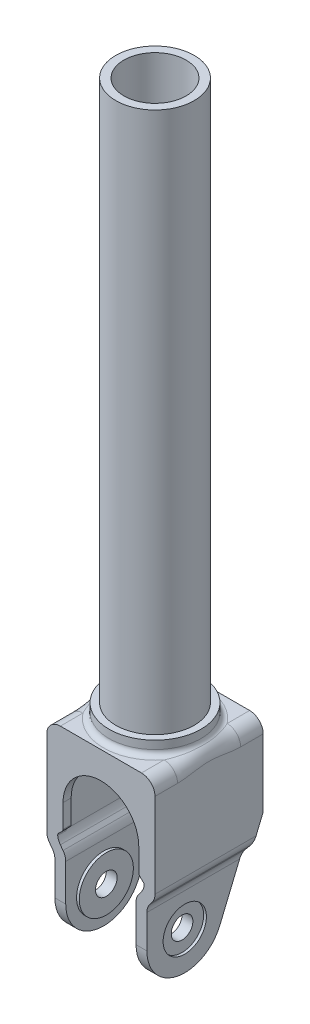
ISO-10303-21;
HEADER;
FILE_DESCRIPTION(('STEP AP214'),'2;1');
FILE_NAME('part.step','',(''),(''),'','','');
FILE_SCHEMA(('AUTOMOTIVE_DESIGN { 1 0 10303 214 1 1 1 1 }'));
ENDSEC;
DATA;
#1=APPLICATION_CONTEXT('core data for automotive mechanical design processes');
#2=APPLICATION_PROTOCOL_DEFINITION('international standard','automotive_design',2000,#1);
#3=PRODUCT_CONTEXT('',#1,'mechanical');
#4=PRODUCT('Part','Part','',(#3));
#5=PRODUCT_RELATED_PRODUCT_CATEGORY('part','',(#4));
#6=PRODUCT_DEFINITION_FORMATION('','',#4);
#7=PRODUCT_DEFINITION_CONTEXT('part definition',#1,'design');
#8=PRODUCT_DEFINITION('design','',#6,#7);
#9=PRODUCT_DEFINITION_SHAPE('','',#8);
#10=(LENGTH_UNIT() NAMED_UNIT(*) SI_UNIT(.MILLI.,.METRE.));
#11=(NAMED_UNIT(*) PLANE_ANGLE_UNIT() SI_UNIT($,.RADIAN.));
#12=(NAMED_UNIT(*) SI_UNIT($,.STERADIAN.) SOLID_ANGLE_UNIT());
#13=UNCERTAINTY_MEASURE_WITH_UNIT(LENGTH_MEASURE(1.E-05),#10,'distance_accuracy_value','');
#14=(GEOMETRIC_REPRESENTATION_CONTEXT(3) GLOBAL_UNCERTAINTY_ASSIGNED_CONTEXT((#13)) GLOBAL_UNIT_ASSIGNED_CONTEXT((#10,
#11,#12)) REPRESENTATION_CONTEXT('',''));
#15=CARTESIAN_POINT('',(0.,0.,0.));
#16=DIRECTION('',(0.,0.,1.));
#17=DIRECTION('',(1.,0.,0.));
#18=AXIS2_PLACEMENT_3D('',#15,#16,#17);
#19=CARTESIAN_POINT('',(0.,0.,0.));
#20=DIRECTION('',(0.,0.,-1.));
#21=DIRECTION('',(-1.,0.,0.));
#22=AXIS2_PLACEMENT_3D('',#19,#20,#21);
#23=PLANE('',#22);
#24=DIRECTION('',(1.,0.,0.));
#25=VECTOR('',#24,1.);
#26=CARTESIAN_POINT('',(-3.,40.,0.));
#27=LINE('',#26,#25);
#28=CARTESIAN_POINT('',(31.,40.,0.));
#29=VERTEX_POINT('',#28);
#30=CARTESIAN_POINT('',(37.,40.,0.));
#31=VERTEX_POINT('',#30);
#32=EDGE_CURVE('E380',#29,#31,#27,.T.);
#33=ORIENTED_EDGE('',*,*,#32,.F.);
#34=DIRECTION('',(0.,1.,0.));
#35=VECTOR('',#34,1.);
#36=CARTESIAN_POINT('',(31.,37.,0.));
#37=LINE('',#36,#35);
#38=CARTESIAN_POINT('',(31.,42.,0.));
#39=VERTEX_POINT('',#38);
#40=EDGE_CURVE('E384',#29,#39,#37,.T.);
#41=ORIENTED_EDGE('',*,*,#40,.T.);
#42=CARTESIAN_POINT('',(17.,42.,0.));
#43=DIRECTION('',(0.,0.,1.));
#44=DIRECTION('',(1.,0.,0.));
#45=AXIS2_PLACEMENT_3D('',#42,#43,#44);
#46=CIRCLE('',#45,14.);
#47=CARTESIAN_POINT('',(3.,42.,0.));
#48=VERTEX_POINT('',#47);
#49=EDGE_CURVE('E407',#39,#48,#46,.T.);
#50=ORIENTED_EDGE('',*,*,#49,.T.);
#51=DIRECTION('',(0.,-1.,0.));
#52=VECTOR('',#51,1.);
#53=CARTESIAN_POINT('',(3.,42.,0.));
#54=LINE('',#53,#52);
#55=CARTESIAN_POINT('',(3.,40.,0.));
#56=VERTEX_POINT('',#55);
#57=EDGE_CURVE('E410',#48,#56,#54,.T.);
#58=ORIENTED_EDGE('',*,*,#57,.T.);
#59=CARTESIAN_POINT('',(-3.,40.,0.));
#60=VERTEX_POINT('',#59);
#61=EDGE_CURVE('E390',#60,#56,#27,.T.);
#62=ORIENTED_EDGE('',*,*,#61,.F.);
#63=DIRECTION('',(0.,-1.,0.));
#64=VECTOR('',#63,1.);
#65=CARTESIAN_POINT('',(-3.,32.,0.));
#66=LINE('',#65,#64);
#67=CARTESIAN_POINT('',(-3.,65.,0.));
#68=VERTEX_POINT('',#67);
#69=EDGE_CURVE('E513',#68,#60,#66,.T.);
#70=ORIENTED_EDGE('',*,*,#69,.F.);
#71=CARTESIAN_POINT('',(2.,65.,0.));
#72=DIRECTION('',(0.,0.,-1.));
#73=DIRECTION('',(-1.,0.,0.));
#74=AXIS2_PLACEMENT_3D('',#71,#72,#73);
#75=CIRCLE('',#74,5.);
#76=CARTESIAN_POINT('',(2.,70.,0.));
#77=VERTEX_POINT('',#76);
#78=EDGE_CURVE('E1010',#68,#77,#75,.T.);
#79=ORIENTED_EDGE('',*,*,#78,.T.);
#80=DIRECTION('',(-1.,0.,0.));
#81=VECTOR('',#80,1.);
#82=CARTESIAN_POINT('',(-3.,70.,0.));
#83=LINE('',#82,#81);
#84=CARTESIAN_POINT('',(32.,70.,0.));
#85=VERTEX_POINT('',#84);
#86=EDGE_CURVE('E543',#85,#77,#83,.T.);
#87=ORIENTED_EDGE('',*,*,#86,.F.);
#88=CARTESIAN_POINT('',(32.,65.,0.));
#89=DIRECTION('',(0.,0.,-1.));
#90=DIRECTION('',(-1.,0.,0.));
#91=AXIS2_PLACEMENT_3D('',#88,#89,#90);
#92=CIRCLE('',#91,5.);
#93=CARTESIAN_POINT('',(37.,65.,0.));
#94=VERTEX_POINT('',#93);
#95=EDGE_CURVE('E1126',#85,#94,#92,.T.);
#96=ORIENTED_EDGE('',*,*,#95,.T.);
#97=DIRECTION('',(0.,1.,0.));
#98=VECTOR('',#97,1.);
#99=CARTESIAN_POINT('',(37.,32.,0.));
#100=LINE('',#99,#98);
#101=EDGE_CURVE('E387',#31,#94,#100,.T.);
#102=ORIENTED_EDGE('',*,*,#101,.F.);
#103=EDGE_LOOP('',(#33,#41,#50,#58,#62,#70,#79,#87,#96,#102));
#104=FACE_BOUND('',#103,.T.);
#105=ADVANCED_FACE('F42',(#104),#23,.T.);
#106=CARTESIAN_POINT('',(3.,37.,3.));
#107=DIRECTION('',(0.707106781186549,-0.707106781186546,0.));
#108=DIRECTION('',(0.707106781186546,0.707106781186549,0.));
#109=AXIS2_PLACEMENT_3D('',#106,#107,#108);
#110=PLANE('',#109);
#111=DIRECTION('',(0.678280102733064,0.678280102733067,-0.282616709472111));
#112=VECTOR('',#111,1.);
#113=CARTESIAN_POINT('',(2.66453674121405,36.6645367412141,1.38977635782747));
#114=LINE('',#113,#112);
#115=CARTESIAN_POINT('',(1.31241368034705,35.312413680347,1.95316096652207));
#116=VERTEX_POINT('',#115);
#117=CARTESIAN_POINT('',(2.70710678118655,36.7071067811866,1.37203884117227));
#118=VERTEX_POINT('',#117);
#119=EDGE_CURVE('E912',#116,#118,#114,.T.);
#120=ORIENTED_EDGE('',*,*,#119,.T.);
#121=DIRECTION('',(0.,0.,-1.));
#122=VECTOR('',#121,1.);
#123=CARTESIAN_POINT('',(2.70710678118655,36.7071067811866,3.));
#124=LINE('',#123,#122);
#125=CARTESIAN_POINT('',(2.70710678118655,36.7071067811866,3.));
#126=VERTEX_POINT('',#125);
#127=EDGE_CURVE('E11',#118,#126,#124,.F.);
#128=ORIENTED_EDGE('',*,*,#127,.T.);
#129=DIRECTION('',(-0.707106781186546,-0.707106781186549,0.));
#130=VECTOR('',#129,1.);
#131=CARTESIAN_POINT('',(3.,37.,3.));
#132=LINE('',#131,#130);
#133=CARTESIAN_POINT('',(1.31241368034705,35.312413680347,3.));
#134=VERTEX_POINT('',#133);
#135=EDGE_CURVE('E416',#126,#134,#132,.T.);
#136=ORIENTED_EDGE('',*,*,#135,.T.);
#137=DIRECTION('',(0.,0.,1.));
#138=VECTOR('',#137,1.);
#139=CARTESIAN_POINT('',(1.31241368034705,35.312413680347,3.));
#140=LINE('',#139,#138);
#141=EDGE_CURVE('E820',#134,#116,#140,.F.);
#142=ORIENTED_EDGE('',*,*,#141,.T.);
#143=EDGE_LOOP('',(#120,#128,#136,#142));
#144=FACE_BOUND('',#143,.T.);
#145=ADVANCED_FACE('F688',(#144),#110,.T.);
#146=CARTESIAN_POINT('',(3.,42.,3.));
#147=DIRECTION('',(1.,0.,0.));
#148=DIRECTION('',(0.,1.,0.));
#149=AXIS2_PLACEMENT_3D('',#146,#147,#148);
#150=PLANE('',#149);
#151=DIRECTION('',(0.,-1.,0.));
#152=VECTOR('',#151,1.);
#153=CARTESIAN_POINT('',(3.,42.,3.));
#154=LINE('',#153,#152);
#155=CARTESIAN_POINT('',(3.,42.,3.));
#156=VERTEX_POINT('',#155);
#157=CARTESIAN_POINT('',(3.,37.4142135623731,3.));
#158=VERTEX_POINT('',#157);
#159=EDGE_CURVE('E908',#156,#158,#154,.T.);
#160=ORIENTED_EDGE('',*,*,#159,.T.);
#161=DIRECTION('',(0.,0.,-1.));
#162=VECTOR('',#161,1.);
#163=CARTESIAN_POINT('',(3.,37.4142135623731,3.));
#164=LINE('',#163,#162);
#165=CARTESIAN_POINT('',(3.,37.4142135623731,1.07741101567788));
#166=VERTEX_POINT('',#165);
#167=EDGE_CURVE('E902',#158,#166,#164,.T.);
#168=ORIENTED_EDGE('',*,*,#167,.T.);
#169=DIRECTION('',(0.,0.923076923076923,-0.384615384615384));
#170=VECTOR('',#169,1.);
#171=CARTESIAN_POINT('',(3.,40.6390532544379,-0.266272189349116));
#172=LINE('',#171,#170);
#173=EDGE_CURVE('E906',#166,#56,#172,.T.);
#174=ORIENTED_EDGE('',*,*,#173,.T.);
#175=ORIENTED_EDGE('',*,*,#57,.F.);
#176=DIRECTION('',(0.,0.,-1.));
#177=VECTOR('',#176,1.);
#178=CARTESIAN_POINT('',(3.,42.,3.));
#179=LINE('',#178,#177);
#180=EDGE_CURVE('E422',#156,#48,#179,.T.);
#181=ORIENTED_EDGE('',*,*,#180,.F.);
#182=EDGE_LOOP('',(#160,#168,#174,#175,#181));
#183=FACE_BOUND('',#182,.T.);
#184=ADVANCED_FACE('F693',(#183),#150,.T.);
#185=CARTESIAN_POINT('',(31.,37.,3.));
#186=DIRECTION('',(-1.,0.,0.));
#187=DIRECTION('',(0.,-1.,0.));
#188=AXIS2_PLACEMENT_3D('',#185,#186,#187);
#189=PLANE('',#188);
#190=DIRECTION('',(0.,-0.923076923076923,0.384615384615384));
#191=VECTOR('',#190,1.);
#192=CARTESIAN_POINT('',(31.,36.3786982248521,1.50887573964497));
#193=LINE('',#192,#191);
#194=CARTESIAN_POINT('',(31.,37.4142135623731,1.07741101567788));
#195=VERTEX_POINT('',#194);
#196=EDGE_CURVE('E394',#29,#195,#193,.T.);
#197=ORIENTED_EDGE('',*,*,#196,.T.);
#198=DIRECTION('',(0.,0.,-1.));
#199=VECTOR('',#198,1.);
#200=CARTESIAN_POINT('',(31.,37.4142135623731,3.));
#201=LINE('',#200,#199);
#202=CARTESIAN_POINT('',(31.,37.4142135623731,3.));
#203=VERTEX_POINT('',#202);
#204=EDGE_CURVE('E896',#195,#203,#201,.F.);
#205=ORIENTED_EDGE('',*,*,#204,.T.);
#206=DIRECTION('',(0.,1.,0.));
#207=VECTOR('',#206,1.);
#208=CARTESIAN_POINT('',(31.,37.,3.));
#209=LINE('',#208,#207);
#210=CARTESIAN_POINT('',(31.,42.,3.));
#211=VERTEX_POINT('',#210);
#212=EDGE_CURVE('E986',#203,#211,#209,.T.);
#213=ORIENTED_EDGE('',*,*,#212,.T.);
#214=DIRECTION('',(0.,0.,-1.));
#215=VECTOR('',#214,1.);
#216=CARTESIAN_POINT('',(31.,42.,3.));
#217=LINE('',#216,#215);
#218=EDGE_CURVE('E405',#211,#39,#217,.T.);
#219=ORIENTED_EDGE('',*,*,#218,.T.);
#220=ORIENTED_EDGE('',*,*,#40,.F.);
#221=EDGE_LOOP('',(#197,#205,#213,#219,#220));
#222=FACE_BOUND('',#221,.T.);
#223=ADVANCED_FACE('F403',(#222),#189,.T.);
#224=CARTESIAN_POINT('',(33.,35.,3.));
#225=DIRECTION('',(-0.707106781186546,-0.707106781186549,0.));
#226=DIRECTION('',(0.707106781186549,-0.707106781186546,0.));
#227=AXIS2_PLACEMENT_3D('',#224,#225,#226);
#228=PLANE('',#227);
#229=DIRECTION('',(-0.707106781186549,0.707106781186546,0.));
#230=VECTOR('',#229,1.);
#231=CARTESIAN_POINT('',(33.,35.,3.));
#232=LINE('',#231,#230);
#233=CARTESIAN_POINT('',(32.687586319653,35.3124136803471,3.));
#234=VERTEX_POINT('',#233);
#235=CARTESIAN_POINT('',(31.2928932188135,36.7071067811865,3.));
#236=VERTEX_POINT('',#235);
#237=EDGE_CURVE('E421',#234,#236,#232,.T.);
#238=ORIENTED_EDGE('',*,*,#237,.T.);
#239=DIRECTION('',(0.,0.,-1.));
#240=VECTOR('',#239,1.);
#241=CARTESIAN_POINT('',(31.2928932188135,36.7071067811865,3.));
#242=LINE('',#241,#240);
#243=CARTESIAN_POINT('',(31.2928932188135,36.7071067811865,1.37203884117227));
#244=VERTEX_POINT('',#243);
#245=EDGE_CURVE('E892',#236,#244,#242,.T.);
#246=ORIENTED_EDGE('',*,*,#245,.T.);
#247=DIRECTION('',(0.678280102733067,-0.678280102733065,0.28261670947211));
#248=VECTOR('',#247,1.);
#249=CARTESIAN_POINT('',(33.1757188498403,34.8242811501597,2.15654952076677));
#250=LINE('',#249,#248);
#251=CARTESIAN_POINT('',(32.687586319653,35.3124136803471,1.95316096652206));
#252=VERTEX_POINT('',#251);
#253=EDGE_CURVE('E401',#244,#252,#250,.T.);
#254=ORIENTED_EDGE('',*,*,#253,.T.);
#255=DIRECTION('',(0.,0.,1.));
#256=VECTOR('',#255,1.);
#257=CARTESIAN_POINT('',(32.687586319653,35.3124136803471,3.));
#258=LINE('',#257,#256);
#259=EDGE_CURVE('E836',#252,#234,#258,.T.);
#260=ORIENTED_EDGE('',*,*,#259,.T.);
#261=EDGE_LOOP('',(#238,#246,#254,#260));
#262=FACE_BOUND('',#261,.T.);
#263=ADVANCED_FACE('F1088',(#262),#228,.T.);
#264=CARTESIAN_POINT('',(0.,0.,40.));
#265=DIRECTION('',(0.,0.,-1.));
#266=DIRECTION('',(-1.,0.,0.));
#267=AXIS2_PLACEMENT_3D('',#264,#265,#266);
#268=PLANE('',#267);
#269=DIRECTION('',(0.,-1.,0.));
#270=VECTOR('',#269,1.);
#271=CARTESIAN_POINT('',(31.,46.,40.));
#272=LINE('',#271,#270);
#273=CARTESIAN_POINT('',(31.,46.,40.));
#274=VERTEX_POINT('',#273);
#275=CARTESIAN_POINT('',(31.,37.4142135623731,40.));
#276=VERTEX_POINT('',#275);
#277=EDGE_CURVE('E967',#274,#276,#272,.T.);
#278=ORIENTED_EDGE('',*,*,#277,.T.);
#279=CARTESIAN_POINT('',(32.,37.4142135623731,40.));
#280=DIRECTION('',(0.,0.,-1.));
#281=DIRECTION('',(-1.,0.,0.));
#282=AXIS2_PLACEMENT_3D('',#279,#280,#281);
#283=CIRCLE('',#282,1.);
#284=CARTESIAN_POINT('',(31.2928932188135,36.7071067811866,40.));
#285=VERTEX_POINT('',#284);
#286=EDGE_CURVE('E865',#276,#285,#283,.F.);
#287=ORIENTED_EDGE('',*,*,#286,.T.);
#288=DIRECTION('',(0.707106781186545,-0.70710678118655,0.));
#289=VECTOR('',#288,1.);
#290=CARTESIAN_POINT('',(31.,37.,40.));
#291=LINE('',#290,#289);
#292=CARTESIAN_POINT('',(32.687586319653,35.312413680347,40.));
#293=VERTEX_POINT('',#292);
#294=EDGE_CURVE('E948',#285,#293,#291,.T.);
#295=ORIENTED_EDGE('',*,*,#294,.T.);
#296=CARTESIAN_POINT('',(31.9804795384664,34.6053068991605,40.));
#297=DIRECTION('',(0.,0.,-1.));
#298=DIRECTION('',(-1.,0.,0.));
#299=AXIS2_PLACEMENT_3D('',#296,#297,#298);
#300=CIRCLE('',#299,1.);
#301=CARTESIAN_POINT('',(32.975599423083,34.5066336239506,40.));
#302=VERTEX_POINT('',#301);
#303=EDGE_CURVE('E888',#293,#302,#300,.T.);
#304=ORIENTED_EDGE('',*,*,#303,.T.);
#305=CARTESIAN_POINT('',(28.,35.,40.));
#306=DIRECTION('',(0.,0.,-1.));
#307=DIRECTION('',(-1.,0.,0.));
#308=AXIS2_PLACEMENT_3D('',#305,#306,#307);
#309=CIRCLE('',#308,5.);
#310=CARTESIAN_POINT('',(32.,32.,40.));
#311=VERTEX_POINT('',#310);
#312=EDGE_CURVE('E1081',#302,#311,#309,.T.);
#313=ORIENTED_EDGE('',*,*,#312,.T.);
#314=DIRECTION('',(-0.6,-0.8,0.));
#315=VECTOR('',#314,1.);
#316=CARTESIAN_POINT('',(30.,29.3333333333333,40.));
#317=LINE('',#316,#315);
#318=CARTESIAN_POINT('',(31.,30.6666666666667,40.));
#319=VERTEX_POINT('',#318);
#320=EDGE_CURVE('E518',#311,#319,#317,.T.);
#321=ORIENTED_EDGE('',*,*,#320,.T.);
#322=CARTESIAN_POINT('',(35.,27.6666666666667,40.));
#323=DIRECTION('',(0.,0.,-1.));
#324=DIRECTION('',(-1.,0.,0.));
#325=AXIS2_PLACEMENT_3D('',#322,#323,#324);
#326=CIRCLE('',#325,5.);
#327=CARTESIAN_POINT('',(30.,27.6666666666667,40.));
#328=VERTEX_POINT('',#327);
#329=EDGE_CURVE('E1032',#319,#328,#326,.F.);
#330=ORIENTED_EDGE('',*,*,#329,.T.);
#331=DIRECTION('',(0.,-1.,0.));
#332=VECTOR('',#331,1.);
#333=CARTESIAN_POINT('',(30.,0.,40.));
#334=LINE('',#333,#332);
#335=CARTESIAN_POINT('',(30.,14.,40.));
#336=VERTEX_POINT('',#335);
#337=EDGE_CURVE('E521',#328,#336,#334,.T.);
#338=ORIENTED_EDGE('',*,*,#337,.T.);
#339=DIRECTION('',(1.,0.,0.));
#340=VECTOR('',#339,1.);
#341=CARTESIAN_POINT('',(-3.,14.,40.));
#342=LINE('',#341,#340);
#343=CARTESIAN_POINT('',(34.,14.,40.));
#344=VERTEX_POINT('',#343);
#345=EDGE_CURVE('E802',#344,#336,#342,.F.);
#346=ORIENTED_EDGE('',*,*,#345,.F.);
#347=DIRECTION('',(0.,1.,0.));
#348=VECTOR('',#347,1.);
#349=CARTESIAN_POINT('',(34.,0.,40.));
#350=LINE('',#349,#348);
#351=CARTESIAN_POINT('',(34.,26.3333333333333,40.));
#352=VERTEX_POINT('',#351);
#353=EDGE_CURVE('E524',#344,#352,#350,.T.);
#354=ORIENTED_EDGE('',*,*,#353,.T.);
#355=CARTESIAN_POINT('',(39.,26.3333333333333,40.));
#356=DIRECTION('',(0.,0.,-1.));
#357=DIRECTION('',(-1.,0.,0.));
#358=AXIS2_PLACEMENT_3D('',#355,#356,#357);
#359=CIRCLE('',#358,5.);
#360=CARTESIAN_POINT('',(35.,29.3333333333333,40.));
#361=VERTEX_POINT('',#360);
#362=EDGE_CURVE('E1110',#352,#361,#359,.T.);
#363=ORIENTED_EDGE('',*,*,#362,.T.);
#364=DIRECTION('',(0.6,0.8,0.));
#365=VECTOR('',#364,1.);
#366=CARTESIAN_POINT('',(34.,28.,40.));
#367=LINE('',#366,#365);
#368=CARTESIAN_POINT('',(36.,30.6666666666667,40.));
#369=VERTEX_POINT('',#368);
#370=EDGE_CURVE('E526',#361,#369,#367,.T.);
#371=ORIENTED_EDGE('',*,*,#370,.T.);
#372=CARTESIAN_POINT('',(32.,33.6666666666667,40.));
#373=DIRECTION('',(0.,0.,-1.));
#374=DIRECTION('',(-1.,0.,0.));
#375=AXIS2_PLACEMENT_3D('',#372,#373,#374);
#376=CIRCLE('',#375,5.);
#377=CARTESIAN_POINT('',(37.,33.6666666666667,40.));
#378=VERTEX_POINT('',#377);
#379=EDGE_CURVE('E1041',#369,#378,#376,.F.);
#380=ORIENTED_EDGE('',*,*,#379,.T.);
#381=DIRECTION('',(0.,1.,0.));
#382=VECTOR('',#381,1.);
#383=CARTESIAN_POINT('',(37.,32.,40.));
#384=LINE('',#383,#382);
#385=CARTESIAN_POINT('',(37.,65.,40.));
#386=VERTEX_POINT('',#385);
#387=EDGE_CURVE('E529',#378,#386,#384,.T.);
#388=ORIENTED_EDGE('',*,*,#387,.T.);
#389=CARTESIAN_POINT('',(32.,65.,40.));
#390=DIRECTION('',(0.,0.,-1.));
#391=DIRECTION('',(-1.,0.,0.));
#392=AXIS2_PLACEMENT_3D('',#389,#390,#391);
#393=CIRCLE('',#392,5.);
#394=CARTESIAN_POINT('',(32.,70.,40.));
#395=VERTEX_POINT('',#394);
#396=EDGE_CURVE('E1026',#386,#395,#393,.F.);
#397=ORIENTED_EDGE('',*,*,#396,.T.);
#398=DIRECTION('',(-1.,0.,0.));
#399=VECTOR('',#398,1.);
#400=CARTESIAN_POINT('',(-3.,70.,40.));
#401=LINE('',#400,#399);
#402=CARTESIAN_POINT('',(2.,70.,40.));
#403=VERTEX_POINT('',#402);
#404=EDGE_CURVE('E532',#395,#403,#401,.T.);
#405=ORIENTED_EDGE('',*,*,#404,.T.);
#406=CARTESIAN_POINT('',(2.,65.,40.));
#407=DIRECTION('',(0.,0.,-1.));
#408=DIRECTION('',(-1.,0.,0.));
#409=AXIS2_PLACEMENT_3D('',#406,#407,#408);
#410=CIRCLE('',#409,5.);
#411=CARTESIAN_POINT('',(-3.,65.,40.));
#412=VERTEX_POINT('',#411);
#413=EDGE_CURVE('E1016',#403,#412,#410,.F.);
#414=ORIENTED_EDGE('',*,*,#413,.T.);
#415=DIRECTION('',(0.,-1.,0.));
#416=VECTOR('',#415,1.);
#417=CARTESIAN_POINT('',(-3.,32.,40.));
#418=LINE('',#417,#416);
#419=CARTESIAN_POINT('',(-3.,33.6666666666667,40.));
#420=VERTEX_POINT('',#419);
#421=EDGE_CURVE('E535',#412,#420,#418,.T.);
#422=ORIENTED_EDGE('',*,*,#421,.T.);
#423=CARTESIAN_POINT('',(2.,33.6666666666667,40.));
#424=DIRECTION('',(0.,0.,-1.));
#425=DIRECTION('',(-1.,0.,0.));
#426=AXIS2_PLACEMENT_3D('',#423,#424,#425);
#427=CIRCLE('',#426,5.);
#428=CARTESIAN_POINT('',(-2.,30.6666666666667,40.));
#429=VERTEX_POINT('',#428);
#430=EDGE_CURVE('E1030',#420,#429,#427,.F.);
#431=ORIENTED_EDGE('',*,*,#430,.T.);
#432=DIRECTION('',(0.600000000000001,-0.799999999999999,0.));
#433=VECTOR('',#432,1.);
#434=CARTESIAN_POINT('',(0.,28.,40.));
#435=LINE('',#434,#433);
#436=CARTESIAN_POINT('',(-1.,29.3333333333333,40.));
#437=VERTEX_POINT('',#436);
#438=EDGE_CURVE('E538',#429,#437,#435,.T.);
#439=ORIENTED_EDGE('',*,*,#438,.T.);
#440=CARTESIAN_POINT('',(-5.,26.3333333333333,40.));
#441=DIRECTION('',(0.,0.,-1.));
#442=DIRECTION('',(-1.,0.,0.));
#443=AXIS2_PLACEMENT_3D('',#440,#441,#442);
#444=CIRCLE('',#443,5.);
#445=CARTESIAN_POINT('',(0.,26.3333333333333,40.));
#446=VERTEX_POINT('',#445);
#447=EDGE_CURVE('E1102',#437,#446,#444,.T.);
#448=ORIENTED_EDGE('',*,*,#447,.T.);
#449=DIRECTION('',(0.,-1.,0.));
#450=VECTOR('',#449,1.);
#451=CARTESIAN_POINT('',(0.,0.,40.));
#452=LINE('',#451,#450);
#453=CARTESIAN_POINT('',(0.,14.,40.));
#454=VERTEX_POINT('',#453);
#455=EDGE_CURVE('E509',#446,#454,#452,.T.);
#456=ORIENTED_EDGE('',*,*,#455,.T.);
#457=CARTESIAN_POINT('',(4.,14.,40.));
#458=VERTEX_POINT('',#457);
#459=EDGE_CURVE('E799',#458,#454,#342,.F.);
#460=ORIENTED_EDGE('',*,*,#459,.F.);
#461=DIRECTION('',(0.,1.,0.));
#462=VECTOR('',#461,1.);
#463=CARTESIAN_POINT('',(4.,29.3333333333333,40.));
#464=LINE('',#463,#462);
#465=CARTESIAN_POINT('',(4.,27.6666666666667,40.));
#466=VERTEX_POINT('',#465);
#467=EDGE_CURVE('E512',#458,#466,#464,.T.);
#468=ORIENTED_EDGE('',*,*,#467,.T.);
#469=CARTESIAN_POINT('',(-1.,27.6666666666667,40.));
#470=DIRECTION('',(0.,0.,-1.));
#471=DIRECTION('',(-1.,0.,0.));
#472=AXIS2_PLACEMENT_3D('',#469,#470,#471);
#473=CIRCLE('',#472,5.);
#474=CARTESIAN_POINT('',(3.,30.6666666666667,40.));
#475=VERTEX_POINT('',#474);
#476=EDGE_CURVE('E1039',#466,#475,#473,.F.);
#477=ORIENTED_EDGE('',*,*,#476,.T.);
#478=DIRECTION('',(-0.6,0.8,0.));
#479=VECTOR('',#478,1.);
#480=CARTESIAN_POINT('',(4.,29.3333333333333,40.));
#481=LINE('',#480,#479);
#482=CARTESIAN_POINT('',(2.,32.,40.));
#483=VERTEX_POINT('',#482);
#484=EDGE_CURVE('E515',#475,#483,#481,.T.);
#485=ORIENTED_EDGE('',*,*,#484,.T.);
#486=CARTESIAN_POINT('',(6.,35.,40.));
#487=DIRECTION('',(0.,0.,-1.));
#488=DIRECTION('',(-1.,0.,0.));
#489=AXIS2_PLACEMENT_3D('',#486,#487,#488);
#490=CIRCLE('',#489,5.);
#491=CARTESIAN_POINT('',(1.024400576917,34.5066336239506,40.));
#492=VERTEX_POINT('',#491);
#493=EDGE_CURVE('E1106',#483,#492,#490,.T.);
#494=ORIENTED_EDGE('',*,*,#493,.T.);
#495=CARTESIAN_POINT('',(2.0195204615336,34.6053068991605,40.));
#496=DIRECTION('',(0.,0.,-1.));
#497=DIRECTION('',(-1.,0.,0.));
#498=AXIS2_PLACEMENT_3D('',#495,#496,#497);
#499=CIRCLE('',#498,1.);
#500=CARTESIAN_POINT('',(1.31241368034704,35.312413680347,40.));
#501=VERTEX_POINT('',#500);
#502=EDGE_CURVE('E886',#492,#501,#499,.T.);
#503=ORIENTED_EDGE('',*,*,#502,.T.);
#504=DIRECTION('',(0.707106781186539,0.707106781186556,0.));
#505=VECTOR('',#504,1.);
#506=CARTESIAN_POINT('',(1.,35.,40.));
#507=LINE('',#506,#505);
#508=CARTESIAN_POINT('',(2.70710678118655,36.7071067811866,40.));
#509=VERTEX_POINT('',#508);
#510=EDGE_CURVE('E941',#501,#509,#507,.T.);
#511=ORIENTED_EDGE('',*,*,#510,.T.);
#512=CARTESIAN_POINT('',(2.,37.4142135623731,40.));
#513=DIRECTION('',(0.,0.,-1.));
#514=DIRECTION('',(-1.,0.,0.));
#515=AXIS2_PLACEMENT_3D('',#512,#513,#514);
#516=CIRCLE('',#515,1.);
#517=CARTESIAN_POINT('',(3.,37.4142135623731,40.));
#518=VERTEX_POINT('',#517);
#519=EDGE_CURVE('E863',#509,#518,#516,.F.);
#520=ORIENTED_EDGE('',*,*,#519,.T.);
#521=DIRECTION('',(0.,1.,0.));
#522=VECTOR('',#521,1.);
#523=CARTESIAN_POINT('',(3.,37.,40.));
#524=LINE('',#523,#522);
#525=CARTESIAN_POINT('',(3.,46.,40.));
#526=VERTEX_POINT('',#525);
#527=EDGE_CURVE('E962',#518,#526,#524,.T.);
#528=ORIENTED_EDGE('',*,*,#527,.T.);
#529=CARTESIAN_POINT('',(17.,46.,40.));
#530=DIRECTION('',(0.,0.,-1.));
#531=DIRECTION('',(-1.,0.,0.));
#532=AXIS2_PLACEMENT_3D('',#529,#530,#531);
#533=CIRCLE('',#532,14.);
#534=EDGE_CURVE('E964',#526,#274,#533,.T.);
#535=ORIENTED_EDGE('',*,*,#534,.T.);
#536=EDGE_LOOP('',(#278,#287,#295,#304,#313,#321,#330,#338,#346,#354,#363,#371,#380,#388,#397,
#405,#414,#422,#431,#439,#448,#456,#460,#468,#477,#485,#494,#503,#511,#520,#528,#535));
#537=FACE_BOUND('',#536,.T.);
#538=ADVANCED_FACE('F697',(#537),#268,.F.);
#539=CARTESIAN_POINT('',(-3.,70.,40.));
#540=DIRECTION('',(0.,-1.,0.));
#541=DIRECTION('',(0.,0.,-1.));
#542=AXIS2_PLACEMENT_3D('',#539,#540,#541);
#543=PLANE('',#542);
#544=ORIENTED_EDGE('',*,*,#404,.F.);
#545=DIRECTION('',(0.,0.,-1.));
#546=VECTOR('',#545,1.);
#547=CARTESIAN_POINT('',(32.,70.,40.));
#548=LINE('',#547,#546);
#549=CARTESIAN_POINT('',(32.,70.,31.6619037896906));
#550=VERTEX_POINT('',#549);
#551=EDGE_CURVE('E748',#395,#550,#548,.T.);
#552=ORIENTED_EDGE('',*,*,#551,.T.);
#553=CARTESIAN_POINT('',(17.,70.,20.));
#554=DIRECTION('',(0.,-1.,0.));
#555=DIRECTION('',(0.,0.,-1.));
#556=AXIS2_PLACEMENT_3D('',#553,#554,#555);
#557=CIRCLE('',#556,19.);
#558=CARTESIAN_POINT('',(2.,70.,31.6619037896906));
#559=VERTEX_POINT('',#558);
#560=EDGE_CURVE('E561',#550,#559,#557,.T.);
#561=ORIENTED_EDGE('',*,*,#560,.T.);
#562=DIRECTION('',(0.,0.,-1.));
#563=VECTOR('',#562,1.);
#564=CARTESIAN_POINT('',(2.,70.,40.));
#565=LINE('',#564,#563);
#566=EDGE_CURVE('E742',#559,#403,#565,.F.);
#567=ORIENTED_EDGE('',*,*,#566,.T.);
#568=EDGE_LOOP('',(#544,#552,#561,#567));
#569=FACE_BOUND('',#568,.T.);
#570=ADVANCED_FACE('F1020',(#569),#543,.F.);
#571=CARTESIAN_POINT('',(17.,70.,20.));
#572=DIRECTION('',(0.,1.,0.));
#573=DIRECTION('',(0.,0.,1.));
#574=AXIS2_PLACEMENT_3D('',#571,#572,#573);
#575=CIRCLE('',#574,10.);
#576=CARTESIAN_POINT('',(17.,70.,30.));
#577=VERTEX_POINT('',#576);
#578=EDGE_CURVE('E502',#577,#577,#575,.T.);
#579=ORIENTED_EDGE('',*,*,#578,.F.);
#580=EDGE_LOOP('',(#579));
#581=FACE_BOUND('',#580,.T.);
#582=CARTESIAN_POINT('',(17.,70.,20.));
#583=DIRECTION('',(0.,-1.,0.));
#584=DIRECTION('',(0.,0.,-1.));
#585=AXIS2_PLACEMENT_3D('',#582,#583,#584);
#586=CIRCLE('',#585,11.5);
#587=CARTESIAN_POINT('',(17.,70.,8.50000000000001));
#588=VERTEX_POINT('',#587);
#589=EDGE_CURVE('E541',#588,#588,#586,.T.);
#590=ORIENTED_EDGE('',*,*,#589,.F.);
#591=EDGE_LOOP('',(#590));
#592=FACE_BOUND('',#591,.T.);
#593=ADVANCED_FACE('F1517',(#581,#592),#543,.F.);
#594=CARTESIAN_POINT('',(0.,0.,40.));
#595=DIRECTION('',(1.,0.,0.));
#596=DIRECTION('',(0.,0.,-1.));
#597=AXIS2_PLACEMENT_3D('',#594,#595,#596);
#598=PLANE('',#597);
#599=CARTESIAN_POINT('',(0.,14.,26.));
#600=DIRECTION('',(-1.,0.,0.));
#601=DIRECTION('',(0.,0.,1.));
#602=AXIS2_PLACEMENT_3D('',#599,#600,#601);
#603=CIRCLE('',#602,8.);
#604=CARTESIAN_POINT('',(0.,14.,34.));
#605=VERTEX_POINT('',#604);
#606=EDGE_CURVE('E931',#605,#605,#603,.T.);
#607=ORIENTED_EDGE('',*,*,#606,.F.);
#608=EDGE_LOOP('',(#607));
#609=FACE_BOUND('',#608,.T.);
#610=DIRECTION('',(0.,-0.923076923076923,0.384615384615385));
#611=VECTOR('',#610,1.);
#612=CARTESIAN_POINT('',(0.,-8.28402366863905,20.1183431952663));
#613=LINE('',#612,#611);
#614=CARTESIAN_POINT('',(0.,26.3333333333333,5.69444444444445));
#615=VERTEX_POINT('',#614);
#616=CARTESIAN_POINT('',(0.,8.61538461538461,13.0769230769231));
#617=VERTEX_POINT('',#616);
#618=EDGE_CURVE('E450',#615,#617,#613,.T.);
#619=ORIENTED_EDGE('',*,*,#618,.T.);
#620=CARTESIAN_POINT('',(0.,14.,26.));
#621=DIRECTION('',(1.,0.,0.));
#622=DIRECTION('',(0.,0.,-1.));
#623=AXIS2_PLACEMENT_3D('',#620,#621,#622);
#624=CIRCLE('',#623,14.);
#625=EDGE_CURVE('E491',#617,#454,#624,.F.);
#626=ORIENTED_EDGE('',*,*,#625,.T.);
#627=ORIENTED_EDGE('',*,*,#455,.F.);
#628=DIRECTION('',(0.,0.,-1.));
#629=VECTOR('',#628,1.);
#630=CARTESIAN_POINT('',(0.,26.3333333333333,0.));
#631=LINE('',#630,#629);
#632=EDGE_CURVE('E721',#446,#615,#631,.T.);
#633=ORIENTED_EDGE('',*,*,#632,.T.);
#634=EDGE_LOOP('',(#619,#626,#627,#633));
#635=FACE_BOUND('',#634,.T.);
#636=ADVANCED_FACE('F1525',(#609,#635),#598,.F.);
#637=CARTESIAN_POINT('',(4.,29.3333333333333,40.));
#638=DIRECTION('',(-1.,0.,0.));
#639=DIRECTION('',(0.,-1.,0.));
#640=AXIS2_PLACEMENT_3D('',#637,#638,#639);
#641=PLANE('',#640);
#642=CARTESIAN_POINT('',(4.,14.,26.));
#643=DIRECTION('',(-1.,0.,0.));
#644=DIRECTION('',(0.,-1.,0.));
#645=AXIS2_PLACEMENT_3D('',#642,#643,#644);
#646=CIRCLE('',#645,10.);
#647=CARTESIAN_POINT('',(4.,3.99999999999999,26.));
#648=VERTEX_POINT('',#647);
#649=EDGE_CURVE('E817',#648,#648,#646,.F.);
#650=ORIENTED_EDGE('',*,*,#649,.F.);
#651=EDGE_LOOP('',(#650));
#652=FACE_BOUND('',#651,.T.);
#653=ORIENTED_EDGE('',*,*,#467,.F.);
#654=CARTESIAN_POINT('',(4.,14.,26.));
#655=DIRECTION('',(-1.,0.,0.));
#656=DIRECTION('',(0.,-1.,0.));
#657=AXIS2_PLACEMENT_3D('',#654,#655,#656);
#658=CIRCLE('',#657,14.);
#659=CARTESIAN_POINT('',(4.,8.61538461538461,13.0769230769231));
#660=VERTEX_POINT('',#659);
#661=EDGE_CURVE('E489',#458,#660,#658,.F.);
#662=ORIENTED_EDGE('',*,*,#661,.T.);
#663=DIRECTION('',(0.,0.923076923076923,-0.384615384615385));
#664=VECTOR('',#663,1.);
#665=CARTESIAN_POINT('',(4.,16.7100591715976,9.70414201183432));
#666=LINE('',#665,#664);
#667=CARTESIAN_POINT('',(4.,27.6666666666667,5.13888888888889));
#668=VERTEX_POINT('',#667);
#669=EDGE_CURVE('E470',#660,#668,#666,.T.);
#670=ORIENTED_EDGE('',*,*,#669,.T.);
#671=DIRECTION('',(0.,0.,-1.));
#672=VECTOR('',#671,1.);
#673=CARTESIAN_POINT('',(4.,27.6666666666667,40.));
#674=LINE('',#673,#672);
#675=EDGE_CURVE('E1051',#668,#466,#674,.F.);
#676=ORIENTED_EDGE('',*,*,#675,.T.);
#677=EDGE_LOOP('',(#653,#662,#670,#676));
#678=FACE_BOUND('',#677,.T.);
#679=ADVANCED_FACE('F1533',(#652,#678),#641,.F.);
#680=CARTESIAN_POINT('',(4.,29.3333333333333,40.));
#681=DIRECTION('',(-0.8,-0.6,0.));
#682=DIRECTION('',(0.6,-0.8,0.));
#683=AXIS2_PLACEMENT_3D('',#680,#681,#682);
#684=PLANE('',#683);
#685=DIRECTION('',(0.,0.,-1.));
#686=VECTOR('',#685,1.);
#687=CARTESIAN_POINT('',(3.,30.6666666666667,40.));
#688=LINE('',#687,#686);
#689=CARTESIAN_POINT('',(3.,30.6666666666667,3.88888888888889));
#690=VERTEX_POINT('',#689);
#691=EDGE_CURVE('E1048',#475,#690,#688,.T.);
#692=ORIENTED_EDGE('',*,*,#691,.T.);
#693=DIRECTION('',(-0.569209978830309,0.758946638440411,-0.316227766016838));
#694=VECTOR('',#693,1.);
#695=CARTESIAN_POINT('',(10.4,20.8,8.));
#696=LINE('',#695,#694);
#697=CARTESIAN_POINT('',(2.,32.,3.33333333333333));
#698=VERTEX_POINT('',#697);
#699=EDGE_CURVE('E465',#690,#698,#696,.T.);
#700=ORIENTED_EDGE('',*,*,#699,.T.);
#701=DIRECTION('',(0.,0.,-1.));
#702=VECTOR('',#701,1.);
#703=CARTESIAN_POINT('',(2.,32.,40.));
#704=LINE('',#703,#702);
#705=EDGE_CURVE('E1046',#698,#483,#704,.F.);
#706=ORIENTED_EDGE('',*,*,#705,.T.);
#707=ORIENTED_EDGE('',*,*,#484,.F.);
#708=EDGE_LOOP('',(#692,#700,#706,#707));
#709=FACE_BOUND('',#708,.T.);
#710=ADVANCED_FACE('F1539',(#709),#684,.F.);
#711=CARTESIAN_POINT('',(1.,33.3333333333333,40.));
#712=DIRECTION('',(-1.,0.,0.));
#713=DIRECTION('',(0.,-1.,0.));
#714=AXIS2_PLACEMENT_3D('',#711,#712,#713);
#715=PLANE('',#714);
#716=DIRECTION('',(0.,0.,-1.));
#717=VECTOR('',#716,1.);
#718=CARTESIAN_POINT('',(1.,64.,40.));
#719=LINE('',#718,#717);
#720=CARTESIAN_POINT('',(1.,64.,3.));
#721=VERTEX_POINT('',#720);
#722=CARTESIAN_POINT('',(1.,64.,37.));
#723=VERTEX_POINT('',#722);
#724=EDGE_CURVE('E804',#721,#723,#719,.F.);
#725=ORIENTED_EDGE('',*,*,#724,.T.);
#726=DIRECTION('',(0.,-1.,0.));
#727=VECTOR('',#726,1.);
#728=CARTESIAN_POINT('',(1.,33.3333333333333,37.));
#729=LINE('',#728,#727);
#730=CARTESIAN_POINT('',(1.,35.,37.));
#731=VERTEX_POINT('',#730);
#732=EDGE_CURVE('E408',#723,#731,#729,.T.);
#733=ORIENTED_EDGE('',*,*,#732,.T.);
#734=DIRECTION('',(0.,0.,-1.));
#735=VECTOR('',#734,1.);
#736=CARTESIAN_POINT('',(1.,35.,0.));
#737=LINE('',#736,#735);
#738=CARTESIAN_POINT('',(1.,35.,3.));
#739=VERTEX_POINT('',#738);
#740=EDGE_CURVE('E1054',#731,#739,#737,.T.);
#741=ORIENTED_EDGE('',*,*,#740,.T.);
#742=DIRECTION('',(0.,1.,0.));
#743=VECTOR('',#742,1.);
#744=CARTESIAN_POINT('',(1.,33.3333333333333,3.));
#745=LINE('',#744,#743);
#746=EDGE_CURVE('E433',#739,#721,#745,.T.);
#747=ORIENTED_EDGE('',*,*,#746,.T.);
#748=EDGE_LOOP('',(#725,#733,#741,#747));
#749=FACE_BOUND('',#748,.T.);
#750=ADVANCED_FACE('F1546',(#749),#715,.F.);
#751=CARTESIAN_POINT('',(33.,65.,40.));
#752=DIRECTION('',(0.,1.,0.));
#753=DIRECTION('',(0.,0.,1.));
#754=AXIS2_PLACEMENT_3D('',#751,#752,#753);
#755=PLANE('',#754);
#756=DIRECTION('',(0.,0.,-1.));
#757=VECTOR('',#756,1.);
#758=CARTESIAN_POINT('',(32.,65.,40.));
#759=LINE('',#758,#757);
#760=CARTESIAN_POINT('',(32.,65.,3.));
#761=VERTEX_POINT('',#760);
#762=CARTESIAN_POINT('',(32.,65.,37.));
#763=VERTEX_POINT('',#762);
#764=EDGE_CURVE('E641',#761,#763,#759,.F.);
#765=ORIENTED_EDGE('',*,*,#764,.T.);
#766=DIRECTION('',(-1.,0.,0.));
#767=VECTOR('',#766,1.);
#768=CARTESIAN_POINT('',(33.,65.,37.));
#769=LINE('',#768,#767);
#770=CARTESIAN_POINT('',(2.,65.,37.));
#771=VERTEX_POINT('',#770);
#772=EDGE_CURVE('E979',#763,#771,#769,.T.);
#773=ORIENTED_EDGE('',*,*,#772,.T.);
#774=DIRECTION('',(0.,0.,-1.));
#775=VECTOR('',#774,1.);
#776=CARTESIAN_POINT('',(2.,65.,0.));
#777=LINE('',#776,#775);
#778=CARTESIAN_POINT('',(2.,65.,3.));
#779=VERTEX_POINT('',#778);
#780=EDGE_CURVE('E1101',#771,#779,#777,.T.);
#781=ORIENTED_EDGE('',*,*,#780,.T.);
#782=DIRECTION('',(1.,0.,0.));
#783=VECTOR('',#782,1.);
#784=CARTESIAN_POINT('',(33.,65.,3.));
#785=LINE('',#784,#783);
#786=EDGE_CURVE('E428',#779,#761,#785,.T.);
#787=ORIENTED_EDGE('',*,*,#786,.T.);
#788=EDGE_LOOP('',(#765,#773,#781,#787));
#789=FACE_BOUND('',#788,.T.);
#790=CARTESIAN_POINT('',(17.,65.,20.));
#791=DIRECTION('',(0.,1.,0.));
#792=DIRECTION('',(0.,0.,1.));
#793=AXIS2_PLACEMENT_3D('',#790,#791,#792);
#794=CIRCLE('',#793,10.);
#795=CARTESIAN_POINT('',(17.,65.,30.));
#796=VERTEX_POINT('',#795);
#797=EDGE_CURVE('E505',#796,#796,#794,.T.);
#798=ORIENTED_EDGE('',*,*,#797,.T.);
#799=EDGE_LOOP('',(#798));
#800=FACE_BOUND('',#799,.T.);
#801=ADVANCED_FACE('F1554',(#789,#800),#755,.F.);
#802=CARTESIAN_POINT('',(33.,33.3333333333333,40.));
#803=DIRECTION('',(1.,0.,0.));
#804=DIRECTION('',(0.,0.,-1.));
#805=AXIS2_PLACEMENT_3D('',#802,#803,#804);
#806=PLANE('',#805);
#807=DIRECTION('',(0.,0.,-1.));
#808=VECTOR('',#807,1.);
#809=CARTESIAN_POINT('',(33.,35.,40.));
#810=LINE('',#809,#808);
#811=CARTESIAN_POINT('',(33.,35.,3.));
#812=VERTEX_POINT('',#811);
#813=CARTESIAN_POINT('',(33.,35.,37.));
#814=VERTEX_POINT('',#813);
#815=EDGE_CURVE('E1062',#812,#814,#810,.F.);
#816=ORIENTED_EDGE('',*,*,#815,.T.);
#817=DIRECTION('',(0.,1.,0.));
#818=VECTOR('',#817,1.);
#819=CARTESIAN_POINT('',(33.,33.3333333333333,37.));
#820=LINE('',#819,#818);
#821=CARTESIAN_POINT('',(33.,64.,37.));
#822=VERTEX_POINT('',#821);
#823=EDGE_CURVE('E974',#814,#822,#820,.T.);
#824=ORIENTED_EDGE('',*,*,#823,.T.);
#825=DIRECTION('',(0.,0.,-1.));
#826=VECTOR('',#825,1.);
#827=CARTESIAN_POINT('',(33.,64.,0.));
#828=LINE('',#827,#826);
#829=CARTESIAN_POINT('',(33.,64.,3.));
#830=VERTEX_POINT('',#829);
#831=EDGE_CURVE('E800',#822,#830,#828,.T.);
#832=ORIENTED_EDGE('',*,*,#831,.T.);
#833=DIRECTION('',(0.,-1.,0.));
#834=VECTOR('',#833,1.);
#835=CARTESIAN_POINT('',(33.,33.3333333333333,3.));
#836=LINE('',#835,#834);
#837=EDGE_CURVE('E424',#830,#812,#836,.T.);
#838=ORIENTED_EDGE('',*,*,#837,.T.);
#839=EDGE_LOOP('',(#816,#824,#832,#838));
#840=FACE_BOUND('',#839,.T.);
#841=ADVANCED_FACE('F1093',(#840),#806,.F.);
#842=CARTESIAN_POINT('',(30.,29.3333333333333,40.));
#843=DIRECTION('',(0.8,-0.6,0.));
#844=DIRECTION('',(0.6,0.8,0.));
#845=AXIS2_PLACEMENT_3D('',#842,#843,#844);
#846=PLANE('',#845);
#847=DIRECTION('',(0.,0.,-1.));
#848=VECTOR('',#847,1.);
#849=CARTESIAN_POINT('',(32.,32.,0.));
#850=LINE('',#849,#848);
#851=CARTESIAN_POINT('',(32.,32.,3.33333333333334));
#852=VERTEX_POINT('',#851);
#853=EDGE_CURVE('E1059',#311,#852,#850,.T.);
#854=ORIENTED_EDGE('',*,*,#853,.T.);
#855=DIRECTION('',(-0.569209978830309,-0.758946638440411,0.316227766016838));
#856=VECTOR('',#855,1.);
#857=CARTESIAN_POINT('',(23.6,20.8,8.));
#858=LINE('',#857,#856);
#859=CARTESIAN_POINT('',(31.,30.6666666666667,3.88888888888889));
#860=VERTEX_POINT('',#859);
#861=EDGE_CURVE('E458',#852,#860,#858,.T.);
#862=ORIENTED_EDGE('',*,*,#861,.T.);
#863=DIRECTION('',(0.,0.,-1.));
#864=VECTOR('',#863,1.);
#865=CARTESIAN_POINT('',(31.,30.6666666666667,40.));
#866=LINE('',#865,#864);
#867=EDGE_CURVE('E1057',#860,#319,#866,.F.);
#868=ORIENTED_EDGE('',*,*,#867,.T.);
#869=ORIENTED_EDGE('',*,*,#320,.F.);
#870=EDGE_LOOP('',(#854,#862,#868,#869));
#871=FACE_BOUND('',#870,.T.);
#872=ADVANCED_FACE('F1076',(#871),#846,.F.);
#873=CARTESIAN_POINT('',(30.,0.,40.));
#874=DIRECTION('',(1.,0.,0.));
#875=DIRECTION('',(0.,1.,0.));
#876=AXIS2_PLACEMENT_3D('',#873,#874,#875);
#877=PLANE('',#876);
#878=CARTESIAN_POINT('',(30.,14.,26.));
#879=DIRECTION('',(1.,0.,0.));
#880=DIRECTION('',(0.,1.,0.));
#881=AXIS2_PLACEMENT_3D('',#878,#879,#880);
#882=CIRCLE('',#881,10.);
#883=CARTESIAN_POINT('',(30.,24.,26.));
#884=VERTEX_POINT('',#883);
#885=EDGE_CURVE('E814',#884,#884,#882,.F.);
#886=ORIENTED_EDGE('',*,*,#885,.F.);
#887=EDGE_LOOP('',(#886));
#888=FACE_BOUND('',#887,.T.);
#889=CARTESIAN_POINT('',(30.,14.,26.));
#890=DIRECTION('',(1.,0.,0.));
#891=DIRECTION('',(0.,1.,0.));
#892=AXIS2_PLACEMENT_3D('',#889,#890,#891);
#893=CIRCLE('',#892,14.);
#894=CARTESIAN_POINT('',(30.,8.61538461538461,13.0769230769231));
#895=VERTEX_POINT('',#894);
#896=EDGE_CURVE('E487',#895,#336,#893,.F.);
#897=ORIENTED_EDGE('',*,*,#896,.T.);
#898=ORIENTED_EDGE('',*,*,#337,.F.);
#899=DIRECTION('',(0.,0.,-1.));
#900=VECTOR('',#899,1.);
#901=CARTESIAN_POINT('',(30.,27.6666666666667,40.));
#902=LINE('',#901,#900);
#903=CARTESIAN_POINT('',(30.,27.6666666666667,5.13888888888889));
#904=VERTEX_POINT('',#903);
#905=EDGE_CURVE('E726',#328,#904,#902,.T.);
#906=ORIENTED_EDGE('',*,*,#905,.T.);
#907=DIRECTION('',(0.,-0.923076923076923,0.384615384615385));
#908=VECTOR('',#907,1.);
#909=CARTESIAN_POINT('',(30.,-8.28402366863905,20.1183431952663));
#910=LINE('',#909,#908);
#911=EDGE_CURVE('E455',#904,#895,#910,.T.);
#912=ORIENTED_EDGE('',*,*,#911,.T.);
#913=EDGE_LOOP('',(#897,#898,#906,#912));
#914=FACE_BOUND('',#913,.T.);
#915=ADVANCED_FACE('F1068',(#888,#914),#877,.F.);
#916=CARTESIAN_POINT('',(34.,0.,40.));
#917=DIRECTION('',(-1.,0.,0.));
#918=DIRECTION('',(0.,0.,1.));
#919=AXIS2_PLACEMENT_3D('',#916,#917,#918);
#920=PLANE('',#919);
#921=CARTESIAN_POINT('',(34.,14.,26.));
#922=DIRECTION('',(1.,0.,0.));
#923=DIRECTION('',(0.,0.,-1.));
#924=AXIS2_PLACEMENT_3D('',#921,#922,#923);
#925=CIRCLE('',#924,8.);
#926=CARTESIAN_POINT('',(34.,14.,18.));
#927=VERTEX_POINT('',#926);
#928=EDGE_CURVE('E935',#927,#927,#925,.T.);
#929=ORIENTED_EDGE('',*,*,#928,.F.);
#930=EDGE_LOOP('',(#929));
#931=FACE_BOUND('',#930,.T.);
#932=ORIENTED_EDGE('',*,*,#353,.F.);
#933=CARTESIAN_POINT('',(34.,14.,26.));
#934=DIRECTION('',(-1.,0.,0.));
#935=DIRECTION('',(0.,0.,1.));
#936=AXIS2_PLACEMENT_3D('',#933,#934,#935);
#937=CIRCLE('',#936,14.);
#938=CARTESIAN_POINT('',(34.,8.61538461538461,13.0769230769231));
#939=VERTEX_POINT('',#938);
#940=EDGE_CURVE('E484',#344,#939,#937,.F.);
#941=ORIENTED_EDGE('',*,*,#940,.T.);
#942=DIRECTION('',(0.,0.923076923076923,-0.384615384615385));
#943=VECTOR('',#942,1.);
#944=CARTESIAN_POINT('',(34.,-8.28402366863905,20.1183431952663));
#945=LINE('',#944,#943);
#946=CARTESIAN_POINT('',(34.,26.3333333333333,5.69444444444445));
#947=VERTEX_POINT('',#946);
#948=EDGE_CURVE('E479',#939,#947,#945,.T.);
#949=ORIENTED_EDGE('',*,*,#948,.T.);
#950=DIRECTION('',(0.,0.,-1.));
#951=VECTOR('',#950,1.);
#952=CARTESIAN_POINT('',(34.,26.3333333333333,40.));
#953=LINE('',#952,#951);
#954=EDGE_CURVE('E1043',#947,#352,#953,.F.);
#955=ORIENTED_EDGE('',*,*,#954,.T.);
#956=EDGE_LOOP('',(#932,#941,#949,#955));
#957=FACE_BOUND('',#956,.T.);
#958=ADVANCED_FACE('F1578',(#931,#957),#920,.F.);
#959=CARTESIAN_POINT('',(34.,28.,40.));
#960=DIRECTION('',(-0.8,0.6,0.));
#961=DIRECTION('',(-0.6,-0.8,0.));
#962=AXIS2_PLACEMENT_3D('',#959,#960,#961);
#963=PLANE('',#962);
#964=DIRECTION('',(0.,0.,-1.));
#965=VECTOR('',#964,1.);
#966=CARTESIAN_POINT('',(35.,29.3333333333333,0.));
#967=LINE('',#966,#965);
#968=CARTESIAN_POINT('',(35.,29.3333333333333,4.44444444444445));
#969=VERTEX_POINT('',#968);
#970=EDGE_CURVE('E1762',#361,#969,#967,.T.);
#971=ORIENTED_EDGE('',*,*,#970,.T.);
#972=DIRECTION('',(0.569209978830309,0.758946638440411,-0.316227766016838));
#973=VECTOR('',#972,1.);
#974=CARTESIAN_POINT('',(27.7,19.6,8.5));
#975=LINE('',#974,#973);
#976=CARTESIAN_POINT('',(36.,30.6666666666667,3.88888888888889));
#977=VERTEX_POINT('',#976);
#978=EDGE_CURVE('E476',#969,#977,#975,.T.);
#979=ORIENTED_EDGE('',*,*,#978,.T.);
#980=DIRECTION('',(0.,0.,-1.));
#981=VECTOR('',#980,1.);
#982=CARTESIAN_POINT('',(36.,30.6666666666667,40.));
#983=LINE('',#982,#981);
#984=EDGE_CURVE('E1034',#977,#369,#983,.F.);
#985=ORIENTED_EDGE('',*,*,#984,.T.);
#986=ORIENTED_EDGE('',*,*,#370,.F.);
#987=EDGE_LOOP('',(#971,#979,#985,#986));
#988=FACE_BOUND('',#987,.T.);
#989=ADVANCED_FACE('F1585',(#988),#963,.F.);
#990=CARTESIAN_POINT('',(37.,32.,40.));
#991=DIRECTION('',(-1.,0.,0.));
#992=DIRECTION('',(0.,0.,1.));
#993=AXIS2_PLACEMENT_3D('',#990,#991,#992);
#994=PLANE('',#993);
#995=DIRECTION('',(0.,0.,-1.));
#996=VECTOR('',#995,1.);
#997=CARTESIAN_POINT('',(37.,33.6666666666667,40.));
#998=LINE('',#997,#996);
#999=CARTESIAN_POINT('',(37.,33.6666666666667,2.63888888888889));
#1000=VERTEX_POINT('',#999);
#1001=EDGE_CURVE('E1767',#378,#1000,#998,.T.);
#1002=ORIENTED_EDGE('',*,*,#1001,.T.);
#1003=DIRECTION('',(0.,-0.923076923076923,0.384615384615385));
#1004=VECTOR('',#1003,1.);
#1005=CARTESIAN_POINT('',(37.,40.,0.));
#1006=LINE('',#1005,#1004);
#1007=EDGE_CURVE('E435',#31,#1000,#1006,.T.);
#1008=ORIENTED_EDGE('',*,*,#1007,.F.);
#1009=ORIENTED_EDGE('',*,*,#101,.T.);
#1010=DIRECTION('',(0.,0.,-1.));
#1011=VECTOR('',#1010,1.);
#1012=CARTESIAN_POINT('',(37.,65.,40.));
#1013=LINE('',#1012,#1011);
#1014=CARTESIAN_POINT('',(37.,65.,8.33809621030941));
#1015=VERTEX_POINT('',#1014);
#1016=EDGE_CURVE('E572',#94,#1015,#1013,.F.);
#1017=ORIENTED_EDGE('',*,*,#1016,.T.);
#1018=CARTESIAN_POINT('',(37.,65.7973486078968,36.4262010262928));
#1019=CARTESIAN_POINT('',(37.,72.2421625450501,33.9367637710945));
#1020=CARTESIAN_POINT('',(30.4372328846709,70.2278138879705,34.7148459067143));
#1021=CARTESIAN_POINT('',(37.,65.6903443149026,36.1491783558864));
#1022=CARTESIAN_POINT('',(37.,72.0902935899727,33.8974813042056));
#1023=CARTESIAN_POINT('',(30.5213586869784,70.1972412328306,34.5588642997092));
#1024=CARTESIAN_POINT('',(37.,65.5956956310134,35.8676131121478));
#1025=CARTESIAN_POINT('',(37.,71.9346722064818,33.8360284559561));
#1026=CARTESIAN_POINT('',(30.608281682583,70.1701987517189,34.3971086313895));
#1027=CARTESIAN_POINT('',(37.,65.4294188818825,35.298107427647));
#1028=CARTESIAN_POINT('',(37.,71.6264437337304,33.6723697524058));
#1029=CARTESIAN_POINT('',(30.7868410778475,70.122691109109,34.06251605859));
#1030=CARTESIAN_POINT('',(37.,65.3577627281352,35.010175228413));
#1031=CARTESIAN_POINT('',(37.,71.4738360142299,33.5712113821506));
#1032=CARTESIAN_POINT('',(30.8784715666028,70.1022179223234,33.8896929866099));
#1033=CARTESIAN_POINT('',(37.,65.2356449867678,34.4305154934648));
#1034=CARTESIAN_POINT('',(37.,71.1775157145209,33.3325275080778));
#1035=CARTESIAN_POINT('',(31.0655940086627,70.0673271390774,33.5333934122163));
#1036=CARTESIAN_POINT('',(37.,65.185142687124,34.1387963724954));
#1037=CARTESIAN_POINT('',(37.,71.0336216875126,33.1959378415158));
#1038=CARTESIAN_POINT('',(31.1610781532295,70.0528979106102,33.3499381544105));
#1039=CARTESIAN_POINT('',(37.,65.1031898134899,33.5526930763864));
#1040=CARTESIAN_POINT('',(37.,70.7581208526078,32.8909844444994));
#1041=CARTESIAN_POINT('',(31.3552864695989,70.029482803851,32.9720821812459));
#1042=CARTESIAN_POINT('',(37.,65.0717413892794,33.2583086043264));
#1043=CARTESIAN_POINT('',(37.,70.6262375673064,32.7233214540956));
#1044=CARTESIAN_POINT('',(31.4540110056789,70.0204975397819,32.777680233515));
#1045=CARTESIAN_POINT('',(37.,65.0320167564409,32.7466877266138));
#1046=CARTESIAN_POINT('',(37.,70.4095979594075,32.4079771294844));
#1047=CARTESIAN_POINT('',(31.6272764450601,70.0091476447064,32.4310147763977));
#1048=CARTESIAN_POINT('',(37.,65.0198034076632,32.5297408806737));
#1049=CARTESIAN_POINT('',(37.,70.321936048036,32.2677612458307));
#1050=CARTESIAN_POINT('',(31.7012714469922,70.0056581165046,32.2812832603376));
#1051=CARTESIAN_POINT('',(37.,65.0038000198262,32.0958328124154));
#1052=CARTESIAN_POINT('',(37.,70.1550357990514,31.9745261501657));
#1053=CARTESIAN_POINT('',(31.8500825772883,70.001085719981,31.976018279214));
#1054=CARTESIAN_POINT('',(37.,64.9999989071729,31.878871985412));
#1055=CARTESIAN_POINT('',(37.,70.0756469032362,31.8217011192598));
#1056=CARTESIAN_POINT('',(31.9248974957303,69.9999996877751,31.8204927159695));
#1057=CARTESIAN_POINT('',(37.,65.0000029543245,31.0753568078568));
#1058=CARTESIAN_POINT('',(37.,69.8010723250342,31.2416868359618));
#1059=CARTESIAN_POINT('',(32.2030304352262,70.0000008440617,31.233178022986));
#1060=CARTESIAN_POINT('',(37.,65.0277933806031,30.4887559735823));
#1061=CARTESIAN_POINT('',(37.,69.6276035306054,30.7723020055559));
#1062=CARTESIAN_POINT('',(32.408162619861,70.0079409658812,30.7820644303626));
#1063=CARTESIAN_POINT('',(37.,65.1232355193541,29.3188471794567));
#1064=CARTESIAN_POINT('',(37.,69.3431384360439,29.7726107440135));
#1065=CARTESIAN_POINT('',(32.81431029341,70.0352101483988,29.8326806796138));
#1066=CARTESIAN_POINT('',(37.,65.190919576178,28.7355422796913));
#1067=CARTESIAN_POINT('',(37.,69.229620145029,29.243031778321));
#1068=CARTESIAN_POINT('',(33.0153223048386,70.0545484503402,29.3343725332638));
#1069=CARTESIAN_POINT('',(37.,65.3502985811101,27.5702711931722));
#1070=CARTESIAN_POINT('',(37.,69.0550246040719,28.1388666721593));
#1071=CARTESIAN_POINT('',(33.4039969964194,70.100085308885,28.2864065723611));
#1072=CARTESIAN_POINT('',(37.,65.4420789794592,26.9883173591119));
#1073=CARTESIAN_POINT('',(37.,68.9921949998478,27.563363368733));
#1074=CARTESIAN_POINT('',(33.5916090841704,70.1263082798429,27.7365705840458));
#1075=CARTESIAN_POINT('',(37.,65.5846120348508,26.1160794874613));
#1076=CARTESIAN_POINT('',(37.,68.9268536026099,26.6705754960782));
#1077=CARTESIAN_POINT('',(33.8537462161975,70.1670320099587,26.873633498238));
#1078=CARTESIAN_POINT('',(37.,65.6329478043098,25.825366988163));
#1079=CARTESIAN_POINT('',(37.,68.9098701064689,26.3704741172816));
#1080=CARTESIAN_POINT('',(33.9379328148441,70.1808422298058,26.5795354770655));
#1081=CARTESIAN_POINT('',(37.,65.7288887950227,25.2438223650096));
#1082=CARTESIAN_POINT('',(37.,68.8835389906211,25.7631850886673));
#1083=CARTESIAN_POINT('',(34.0982467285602,70.2082539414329,25.9788950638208));
#1084=CARTESIAN_POINT('',(37.,65.77649403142,24.9529902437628));
#1085=CARTESIAN_POINT('',(37.,68.8740874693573,25.4556742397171));
#1086=CARTESIAN_POINT('',(34.1743742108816,70.2218554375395,25.6723529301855));
#1087=CARTESIAN_POINT('',(37.,65.8826541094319,24.281807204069));
#1088=CARTESIAN_POINT('',(37.,68.8588745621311,24.7405216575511));
#1089=CARTESIAN_POINT('',(34.3387245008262,70.252186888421,24.9517601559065));
#1090=CARTESIAN_POINT('',(37.,65.9401058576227,23.9012769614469));
#1091=CARTESIAN_POINT('',(37.,68.8549690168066,24.3288335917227));
#1092=CARTESIAN_POINT('',(34.4235275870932,70.2686016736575,24.5334981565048));
#1093=CARTESIAN_POINT('',(37.,66.0442737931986,23.1387137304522));
#1094=CARTESIAN_POINT('',(37.,68.8525030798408,23.4971500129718));
#1095=CARTESIAN_POINT('',(34.572917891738,70.2983639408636,23.6789901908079));
#1096=CARTESIAN_POINT('',(37.,66.0909903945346,22.7566808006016));
#1097=CARTESIAN_POINT('',(37.,68.8538862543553,23.0760657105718));
#1098=CARTESIAN_POINT('',(34.6375058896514,70.311711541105,23.2427449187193));
#1099=CARTESIAN_POINT('',(37.,66.1686495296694,21.9917651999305));
#1100=CARTESIAN_POINT('',(37.,68.8580657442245,22.2289988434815));
#1101=CARTESIAN_POINT('',(34.7430323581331,70.3338998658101,22.3573409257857));
#1102=CARTESIAN_POINT('',(37.,66.1996249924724,21.6088859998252));
#1103=CARTESIAN_POINT('',(37.,68.8608558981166,21.8017621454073));
#1104=CARTESIAN_POINT('',(34.7840202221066,70.3427499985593,21.9082112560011));
#1105=CARTESIAN_POINT('',(37.,66.2422940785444,20.8420492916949));
#1106=CARTESIAN_POINT('',(37.,68.8650360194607,20.9447959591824));
#1107=CARTESIAN_POINT('',(34.8401334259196,70.3549411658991,21.0022052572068));
#1108=CARTESIAN_POINT('',(37.,66.2539896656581,20.4580918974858));
#1109=CARTESIAN_POINT('',(37.,68.8664380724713,20.513655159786));
#1110=CARTESIAN_POINT('',(34.8552613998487,70.3582827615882,20.5453297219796));
#1111=CARTESIAN_POINT('',(37.,66.2566323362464,19.6894763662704));
#1112=CARTESIAN_POINT('',(37.,68.8667375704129,19.6518936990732));
#1113=CARTESIAN_POINT('',(34.8586959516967,70.3590378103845,19.63034517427));
#1114=CARTESIAN_POINT('',(37.,66.2475455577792,19.3048181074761));
#1115=CARTESIAN_POINT('',(37.,68.8656319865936,19.2197996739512));
#1116=CARTESIAN_POINT('',(34.8469587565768,70.3564415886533,19.1722353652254));
#1117=CARTESIAN_POINT('',(37.,66.2097056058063,18.5364743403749));
#1118=CARTESIAN_POINT('',(37.,68.8617928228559,18.3605170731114));
#1119=CARTESIAN_POINT('',(34.7973285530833,70.3456301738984,18.2629115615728));
#1120=CARTESIAN_POINT('',(37.,66.1809505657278,18.1527889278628));
#1121=CARTESIAN_POINT('',(37.,68.8590474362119,17.931897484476));
#1122=CARTESIAN_POINT('',(34.7594330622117,70.3374144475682,17.8116982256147));
#1123=CARTESIAN_POINT('',(37.,66.1071345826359,17.3862248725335));
#1124=CARTESIAN_POINT('',(37.,68.8545412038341,17.0817563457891));
#1125=CARTESIAN_POINT('',(34.6596538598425,70.3163241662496,16.9214998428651));
#1126=CARTESIAN_POINT('',(37.,66.0620389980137,17.0033496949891));
#1127=CARTESIAN_POINT('',(37.,68.852781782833,16.6589524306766));
#1128=CARTESIAN_POINT('',(34.5977191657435,70.3034397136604,16.4825429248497));
#1129=CARTESIAN_POINT('',(37.,65.9604247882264,16.2391528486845));
#1130=CARTESIAN_POINT('',(37.,68.8540079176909,15.8236314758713));
#1131=CARTESIAN_POINT('',(34.4531276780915,70.2744070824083,15.6222567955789));
#1132=CARTESIAN_POINT('',(37.,65.9039056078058,15.8578312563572));
#1133=CARTESIAN_POINT('',(37.,68.8570415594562,15.4099953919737));
#1134=CARTESIAN_POINT('',(34.3704698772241,70.258258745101,15.2009284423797));
#1135=CARTESIAN_POINT('',(37.,65.7978215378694,15.1791435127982));
#1136=CARTESIAN_POINT('',(37.,68.8704053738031,14.6845477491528));
#1137=CARTESIAN_POINT('',(34.2079742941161,70.2279490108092,14.4681020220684));
#1138=CARTESIAN_POINT('',(37.,65.7494249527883,14.8815891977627));
#1139=CARTESIAN_POINT('',(37.,68.8790875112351,14.3689181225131));
#1140=CARTESIAN_POINT('',(34.1314468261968,70.2141214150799,14.1526771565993));
#1141=CARTESIAN_POINT('',(37.,65.6515336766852,14.2866560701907));
#1142=CARTESIAN_POINT('',(37.,68.9039738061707,13.7456529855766));
#1143=CARTESIAN_POINT('',(33.9697309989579,70.1861524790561,13.534803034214));
#1144=CARTESIAN_POINT('',(37.,65.6020389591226,13.9892772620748));
#1145=CARTESIAN_POINT('',(37.,68.9202833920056,13.4376610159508));
#1146=CARTESIAN_POINT('',(33.8845424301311,70.1720111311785,13.2323540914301));
#1147=CARTESIAN_POINT('',(37.,65.5044871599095,13.3944938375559));
#1148=CARTESIAN_POINT('',(37.,68.9623740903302,12.8308166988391));
#1149=CARTESIAN_POINT('',(33.7072797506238,70.144139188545,12.6409086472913));
#1150=CARTESIAN_POINT('',(37.,65.456429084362,13.0970893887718));
#1151=CARTESIAN_POINT('',(37.,68.9883011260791,12.5316804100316));
#1152=CARTESIAN_POINT('',(33.6152105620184,70.1304083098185,12.3519027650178));
#1153=CARTESIAN_POINT('',(37.,65.3641015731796,12.501696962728));
#1154=CARTESIAN_POINT('',(37.,69.0514134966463,11.9434508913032));
#1155=CARTESIAN_POINT('',(33.4257433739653,70.1040290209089,11.7871026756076));
#1156=CARTESIAN_POINT('',(37.,65.3198321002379,12.2037089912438));
#1157=CARTESIAN_POINT('',(37.,69.0888010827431,11.6541669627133));
#1158=CARTESIAN_POINT('',(33.328345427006,70.0913806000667,11.5113083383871));
#1159=CARTESIAN_POINT('',(37.,65.1969463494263,11.3141168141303));
#1160=CARTESIAN_POINT('',(37.,69.2206216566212,10.802263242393));
#1161=CARTESIAN_POINT('',(33.0323383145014,70.056270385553,10.7086072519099));
#1162=CARTESIAN_POINT('',(37.,65.1272303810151,10.7211989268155));
#1163=CARTESIAN_POINT('',(37.,69.334532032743,10.2624482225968));
#1164=CARTESIAN_POINT('',(32.8281580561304,70.0363515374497,10.2007249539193));
#1165=CARTESIAN_POINT('',(37.,65.0287606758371,9.53157733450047));
#1166=CARTESIAN_POINT('',(37.,69.6217137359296,9.24366102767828));
#1167=CARTESIAN_POINT('',(32.4152739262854,70.0082173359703,9.23357365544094));
#1168=CARTESIAN_POINT('',(37.,65.000001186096,8.93487417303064));
#1169=CARTESIAN_POINT('',(37.,69.7976680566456,8.76548499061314));
#1170=CARTESIAN_POINT('',(32.2065706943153,70.0000003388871,8.77429783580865));
#1171=CARTESIAN_POINT('',(37.,64.9999992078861,7.93954825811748));
#1172=CARTESIAN_POINT('',(37.,70.1398442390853,8.0427011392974));
#1173=CARTESIAN_POINT('',(31.8620452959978,69.99999977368,8.04678641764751));
#1174=CARTESIAN_POINT('',(37.,65.0128246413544,7.5409669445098));
#1175=CARTESIAN_POINT('',(37.,70.2925532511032,7.77098778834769));
#1176=CARTESIAN_POINT('',(31.7250417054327,70.003664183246,7.76576773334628));
#1177=CARTESIAN_POINT('',(37.,65.0689938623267,6.74623552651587));
#1178=CARTESIAN_POINT('',(37.,70.6233231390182,7.27417788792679));
#1179=CARTESIAN_POINT('',(31.4552854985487,70.019712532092,7.22397075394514));
#1180=CARTESIAN_POINT('',(37.,65.112308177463,6.35008344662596));
#1181=CARTESIAN_POINT('',(37.,70.8022037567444,7.05032774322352));
#1182=CARTESIAN_POINT('',(31.322528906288,70.0320880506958,6.96317318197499));
#1183=CARTESIAN_POINT('',(37.,65.2361788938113,5.55084079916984));
#1184=CARTESIAN_POINT('',(37.,71.1860983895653,6.65277049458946));
#1185=CARTESIAN_POINT('',(31.059163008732,70.0674796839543,6.4535149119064));
#1186=CARTESIAN_POINT('',(37.,65.3178434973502,5.14791346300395));
#1187=CARTESIAN_POINT('',(37.,71.3922484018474,6.48296833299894));
#1188=CARTESIAN_POINT('',(30.9287464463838,70.0908124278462,6.20527108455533));
#1189=CARTESIAN_POINT('',(37.,65.4724074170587,4.55114736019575));
#1190=CARTESIAN_POINT('',(37.,71.7066577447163,6.28311494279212));
#1191=CARTESIAN_POINT('',(30.7394532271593,70.134973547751,5.84856999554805));
#1192=CARTESIAN_POINT('',(37.,65.5294102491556,4.3531324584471));
#1193=CARTESIAN_POINT('',(37.,71.8138673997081,6.22522689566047));
#1194=CARTESIAN_POINT('',(30.677300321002,70.1512600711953,5.73207699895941));
#1195=CARTESIAN_POINT('',(37.,65.6547395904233,3.96060699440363));
#1196=CARTESIAN_POINT('',(37.,72.0287529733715,6.128861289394));
#1197=CARTESIAN_POINT('',(30.5553968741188,70.1870684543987,5.50451170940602));
#1198=CARTESIAN_POINT('',(37.,65.7230723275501,3.76609842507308));
#1199=CARTESIAN_POINT('',(37.,72.1364079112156,6.09074065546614));
#1200=CARTESIAN_POINT('',(30.4956476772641,70.2065920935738,5.39344244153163));
#1201=CARTESIAN_POINT('',(37.,65.7973486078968,3.57379897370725));
#1202=CARTESIAN_POINT('',(37.,72.2421625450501,6.06323622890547));
#1203=CARTESIAN_POINT('',(30.4372328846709,70.2278138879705,5.28515409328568));
#1204=(BOUNDED_SURFACE() B_SPLINE_SURFACE(3,2,((#1018,#1019,#1020),(#1021,#1022,#1023),(#1024,
#1025,#1026),(#1027,#1028,#1029),(#1030,#1031,#1032),(#1033,#1034,#1035),(#1036,#1037,#1038),
(#1039,#1040,#1041),(#1042,#1043,#1044),(#1045,#1046,#1047),(#1048,#1049,#1050),(#1051,#1052,
#1053),(#1054,#1055,#1056),(#1057,#1058,#1059),(#1060,#1061,#1062),(#1063,#1064,#1065),(#1066,
#1067,#1068),(#1069,#1070,#1071),(#1072,#1073,#1074),(#1075,#1076,#1077),(#1078,#1079,#1080),
(#1081,#1082,#1083),(#1084,#1085,#1086),(#1087,#1088,#1089),(#1090,#1091,#1092),(#1093,#1094,
#1095),(#1096,#1097,#1098),(#1099,#1100,#1101),(#1102,#1103,#1104),(#1105,#1106,#1107),(#1108,
#1109,#1110),(#1111,#1112,#1113),(#1114,#1115,#1116),(#1117,#1118,#1119),(#1120,#1121,#1122),
(#1123,#1124,#1125),(#1126,#1127,#1128),(#1129,#1130,#1131),(#1132,#1133,#1134),(#1135,#1136,
#1137),(#1138,#1139,#1140),(#1141,#1142,#1143),(#1144,#1145,#1146),(#1147,#1148,#1149),(#1150,
#1151,#1152),(#1153,#1154,#1155),(#1156,#1157,#1158),(#1159,#1160,#1161),(#1162,#1163,#1164),
(#1165,#1166,#1167),(#1168,#1169,#1170),(#1171,#1172,#1173),(#1174,#1175,#1176),(#1177,#1178,
#1179),(#1180,#1181,#1182),(#1183,#1184,#1185),(#1186,#1187,#1188),(#1189,#1190,#1191),(#1192,
#1193,#1194),(#1195,#1196,#1197),(#1198,#1199,#1200),(#1201,#1202,#1203)),.UNSPECIFIED.,.F.,.F.,
.F.) B_SPLINE_SURFACE_WITH_KNOTS((4,2,2,2,2,2,2,2,2,2,2,2,2,2,2,2,2,2,2,2,2,2,2,2,2,2,2,2,2,2,
4),(3,3),(0.,0.890310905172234,1.77952999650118,2.66702977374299,3.55462966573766,
4.20633505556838,4.85718205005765,6.61666730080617,8.37758104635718,10.1448257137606,
11.0289476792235,11.9130512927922,13.0675013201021,14.2219068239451,15.3738873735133,
16.5257505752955,17.6794919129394,18.833342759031,19.9896541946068,21.1460218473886,
22.0504110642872,22.954822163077,23.8585923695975,24.7623536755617,26.5525552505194,
28.3425053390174,29.5378928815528,30.7321264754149,31.9632196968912,32.5810851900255,
33.1992914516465),(0.,1.),
.UNSPECIFIED.) GEOMETRIC_REPRESENTATION_ITEM() RATIONAL_B_SPLINE_SURFACE(((1.,0.586279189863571,
1.),(1.,0.593455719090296,1.),(1.,0.600735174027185,1.),(1.,0.615416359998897,1.),(1.,
0.622817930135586,1.),(1.,0.637663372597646,1.),(1.,0.645107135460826,1.),(1.,0.659987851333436,
1.),(1.,0.667424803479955,1.),(1.,0.680262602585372,1.),(1.,0.685679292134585,1.),(1.,
0.696446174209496,1.),(1.,0.701796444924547,1.),(1.,0.721462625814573,1.),(1.,0.73552661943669,
1.),(1.,0.762637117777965,1.),(1.,0.775682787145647,1.),(1.,0.800345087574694,1.),(1.,
0.811956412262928,1.),(1.,0.827890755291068,1.),(1.,0.832956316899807,1.),(1.,0.842524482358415,
1.),(1.,0.847027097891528,1.),(1.,0.85668103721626,1.),(1.,0.861609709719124,1.),(1.,
0.870235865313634,1.),(1.,0.873933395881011,1.),(1.,0.879950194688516,1.),(1.,0.882272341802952,
1.),(1.,0.88544673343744,1.),(1.,0.886299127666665,1.),(1.,0.886492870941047,1.),(1.,
0.885831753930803,1.),(1.,0.883025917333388,1.),(1.,0.880881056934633,1.),(1.,0.875199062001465,
1.),(1.,0.871658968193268,1.),(1.,0.863324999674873,1.),(1.,0.858531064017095,1.),(1.,
0.849008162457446,1.),(1.,0.844492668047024,1.),(1.,0.834863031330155,1.),(1.,0.829748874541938,
1.),(1.,0.8189974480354,1.),(1.,0.813360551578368,1.),(1.,0.801628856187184,1.),(1.,
0.795534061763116,1.),(1.,0.776780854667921,1.),(1.,0.763548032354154,1.),(1.,0.736014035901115,
1.),(1.,0.721713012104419,1.),(1.,0.697352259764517,1.),(1.,0.687461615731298,1.),(1.,
0.667553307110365,1.),(1.,0.657535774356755,1.),(1.,0.637199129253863,1.),(1.,0.626880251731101,
1.),(1.,0.611532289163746,1.),(1.,0.60642859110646,1.),(1.,0.596293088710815,1.),(1.,
0.59126132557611,1.),(1.,0.586279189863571,1.))) REPRESENTATION_ITEM('') SURFACE());
#1205=CARTESIAN_POINT('',(37.,65.7973486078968,3.57379897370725));
#1206=CARTESIAN_POINT('',(37.,65.7230723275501,3.76609842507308));
#1207=CARTESIAN_POINT('',(37.,65.6547395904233,3.96060699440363));
#1208=CARTESIAN_POINT('',(37.,65.5294102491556,4.3531324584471));
#1209=CARTESIAN_POINT('',(37.,65.4724074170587,4.55114736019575));
#1210=CARTESIAN_POINT('',(37.,65.3178434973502,5.14791346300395));
#1211=CARTESIAN_POINT('',(37.,65.2361788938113,5.55084079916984));
#1212=CARTESIAN_POINT('',(37.,65.112308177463,6.35008344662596));
#1213=CARTESIAN_POINT('',(37.,65.0689938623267,6.74623552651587));
#1214=CARTESIAN_POINT('',(37.,65.0128246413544,7.5409669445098));
#1215=CARTESIAN_POINT('',(37.,64.9999992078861,7.93954825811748));
#1216=CARTESIAN_POINT('',(37.,65.000001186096,8.93487417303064));
#1217=CARTESIAN_POINT('',(37.,65.0287606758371,9.53157733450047));
#1218=CARTESIAN_POINT('',(37.,65.1272303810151,10.7211989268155));
#1219=CARTESIAN_POINT('',(37.,65.1969463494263,11.3141168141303));
#1220=CARTESIAN_POINT('',(37.,65.3198321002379,12.2037089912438));
#1221=CARTESIAN_POINT('',(37.,65.3641015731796,12.501696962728));
#1222=CARTESIAN_POINT('',(37.,65.456429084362,13.0970893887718));
#1223=CARTESIAN_POINT('',(37.,65.5044871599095,13.3944938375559));
#1224=CARTESIAN_POINT('',(37.,65.6020389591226,13.9892772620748));
#1225=CARTESIAN_POINT('',(37.,65.6515336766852,14.2866560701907));
#1226=CARTESIAN_POINT('',(37.,65.7494249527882,14.8815891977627));
#1227=CARTESIAN_POINT('',(37.,65.7978215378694,15.1791435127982));
#1228=CARTESIAN_POINT('',(37.,65.9039056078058,15.8578312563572));
#1229=CARTESIAN_POINT('',(37.,65.9604247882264,16.2391528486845));
#1230=CARTESIAN_POINT('',(37.,66.0620389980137,17.0033496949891));
#1231=CARTESIAN_POINT('',(37.,66.1071345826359,17.3862248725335));
#1232=CARTESIAN_POINT('',(37.,66.1809505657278,18.1527889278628));
#1233=CARTESIAN_POINT('',(37.,66.2097056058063,18.5364743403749));
#1234=CARTESIAN_POINT('',(37.,66.2475455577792,19.3048181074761));
#1235=CARTESIAN_POINT('',(37.,66.2566323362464,19.6894763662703));
#1236=CARTESIAN_POINT('',(37.,66.2539896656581,20.4580918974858));
#1237=CARTESIAN_POINT('',(37.,66.2422940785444,20.8420492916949));
#1238=CARTESIAN_POINT('',(37.,66.1996249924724,21.6088859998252));
#1239=CARTESIAN_POINT('',(37.,66.1686495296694,21.9917651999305));
#1240=CARTESIAN_POINT('',(37.,66.0909903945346,22.7566808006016));
#1241=CARTESIAN_POINT('',(37.,66.0442737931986,23.1387137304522));
#1242=CARTESIAN_POINT('',(37.,65.9401058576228,23.9012769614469));
#1243=CARTESIAN_POINT('',(37.,65.882654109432,24.281807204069));
#1244=CARTESIAN_POINT('',(37.,65.77649403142,24.9529902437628));
#1245=CARTESIAN_POINT('',(37.,65.7288887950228,25.2438223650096));
#1246=CARTESIAN_POINT('',(37.,65.6329478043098,25.825366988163));
#1247=CARTESIAN_POINT('',(37.,65.5846120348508,26.1160794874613));
#1248=CARTESIAN_POINT('',(37.,65.4420789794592,26.9883173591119));
#1249=CARTESIAN_POINT('',(37.,65.3502985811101,27.5702711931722));
#1250=CARTESIAN_POINT('',(37.,65.190919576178,28.7355422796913));
#1251=CARTESIAN_POINT('',(37.,65.1232355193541,29.3188471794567));
#1252=CARTESIAN_POINT('',(37.,65.0277933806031,30.4887559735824));
#1253=CARTESIAN_POINT('',(37.,65.0000029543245,31.0753568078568));
#1254=CARTESIAN_POINT('',(37.,64.9999989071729,31.878871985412));
#1255=CARTESIAN_POINT('',(37.,65.0038000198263,32.0958328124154));
#1256=CARTESIAN_POINT('',(37.,65.0198034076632,32.5297408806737));
#1257=CARTESIAN_POINT('',(37.,65.0320167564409,32.7466877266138));
#1258=CARTESIAN_POINT('',(37.,65.0717413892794,33.2583086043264));
#1259=CARTESIAN_POINT('',(37.,65.1031898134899,33.5526930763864));
#1260=CARTESIAN_POINT('',(37.,65.185142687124,34.1387963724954));
#1261=CARTESIAN_POINT('',(37.,65.2356449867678,34.4305154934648));
#1262=CARTESIAN_POINT('',(37.,65.3577627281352,35.010175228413));
#1263=CARTESIAN_POINT('',(37.,65.4294188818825,35.298107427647));
#1264=CARTESIAN_POINT('',(37.,65.5956956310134,35.8676131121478));
#1265=CARTESIAN_POINT('',(37.,65.6903443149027,36.1491783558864));
#1266=CARTESIAN_POINT('',(37.,65.7973486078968,36.4262010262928));
#1267=B_SPLINE_CURVE_WITH_KNOTS('',3,(#1205,#1206,#1207,#1208,#1209,#1210,#1211,#1212,#1213,
#1214,#1215,#1216,#1217,#1218,#1219,#1220,#1221,#1222,#1223,#1224,#1225,#1226,#1227,#1228,#1229,
#1230,#1231,#1232,#1233,#1234,#1235,#1236,#1237,#1238,#1239,#1240,#1241,#1242,#1243,#1244,#1245,
#1246,#1247,#1248,#1249,#1250,#1251,#1252,#1253,#1254,#1255,#1256,#1257,#1258,#1259,#1260,#1261,
#1262,#1263,#1264,#1265,#1266),.UNSPECIFIED.,.F.,.F.,(4,2,2,2,2,2,2,2,2,2,2,2,2,2,2,2,2,2,2,2,2,
2,2,2,2,2,2,2,2,2,4),(0.,0.618206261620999,1.2360717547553,2.46716497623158,3.66139857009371,
4.85678611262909,6.64673620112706,8.43693777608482,9.34069908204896,10.2444692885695,
11.1488803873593,12.0532696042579,13.2096372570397,14.3659486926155,15.5197995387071,
16.673540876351,17.8254040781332,18.9773846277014,20.1317901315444,21.2862401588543,
22.170343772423,23.0544657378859,24.8217104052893,26.5826241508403,28.3421094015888,
28.9929563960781,29.6446617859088,30.5322616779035,31.4197614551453,32.3089805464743,
33.1992914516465),.UNSPECIFIED.);
#1268=CARTESIAN_POINT('',(37.,65.,31.6619037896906));
#1269=VERTEX_POINT('',#1268);
#1270=EDGE_CURVE('E564',#1015,#1269,#1267,.T.);
#1271=ORIENTED_EDGE('',*,*,#1270,.T.);
#1272=DIRECTION('',(0.,0.,-1.));
#1273=VECTOR('',#1272,1.);
#1274=CARTESIAN_POINT('',(37.,65.,40.));
#1275=LINE('',#1274,#1273);
#1276=EDGE_CURVE('E562',#1269,#386,#1275,.F.);
#1277=ORIENTED_EDGE('',*,*,#1276,.T.);
#1278=ORIENTED_EDGE('',*,*,#387,.F.);
#1279=EDGE_LOOP('',(#1002,#1008,#1009,#1017,#1271,#1277,#1278));
#1280=FACE_BOUND('',#1279,.T.);
#1281=ADVANCED_FACE('F574',(#1280),#994,.F.);
#1282=CARTESIAN_POINT('',(2.,70.,8.3380962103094));
#1283=VERTEX_POINT('',#1282);
#1284=CARTESIAN_POINT('',(32.,70.,8.33809621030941));
#1285=VERTEX_POINT('',#1284);
#1286=EDGE_CURVE('E558',#1283,#1285,#557,.T.);
#1287=ORIENTED_EDGE('',*,*,#1286,.T.);
#1288=DIRECTION('',(0.,0.,-1.));
#1289=VECTOR('',#1288,1.);
#1290=CARTESIAN_POINT('',(32.,70.,40.));
#1291=LINE('',#1290,#1289);
#1292=EDGE_CURVE('E746',#1285,#85,#1291,.T.);
#1293=ORIENTED_EDGE('',*,*,#1292,.T.);
#1294=ORIENTED_EDGE('',*,*,#86,.T.);
#1295=DIRECTION('',(0.,0.,-1.));
#1296=VECTOR('',#1295,1.);
#1297=CARTESIAN_POINT('',(2.,70.,40.));
#1298=LINE('',#1297,#1296);
#1299=EDGE_CURVE('E744',#77,#1283,#1298,.F.);
#1300=ORIENTED_EDGE('',*,*,#1299,.T.);
#1301=EDGE_LOOP('',(#1287,#1293,#1294,#1300));
#1302=FACE_BOUND('',#1301,.T.);
#1303=ADVANCED_FACE('F710',(#1302),#543,.F.);
#1304=CARTESIAN_POINT('',(-3.,32.,40.));
#1305=DIRECTION('',(1.,0.,0.));
#1306=DIRECTION('',(0.,1.,0.));
#1307=AXIS2_PLACEMENT_3D('',#1304,#1305,#1306);
#1308=PLANE('',#1307);
#1309=ORIENTED_EDGE('',*,*,#69,.T.);
#1310=DIRECTION('',(0.,-0.923076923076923,0.384615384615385));
#1311=VECTOR('',#1310,1.);
#1312=CARTESIAN_POINT('',(-3.,40.,0.));
#1313=LINE('',#1312,#1311);
#1314=CARTESIAN_POINT('',(-3.,33.6666666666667,2.63888888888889));
#1315=VERTEX_POINT('',#1314);
#1316=EDGE_CURVE('E391',#60,#1315,#1313,.T.);
#1317=ORIENTED_EDGE('',*,*,#1316,.T.);
#1318=DIRECTION('',(0.,0.,-1.));
#1319=VECTOR('',#1318,1.);
#1320=CARTESIAN_POINT('',(-3.,33.6666666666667,40.));
#1321=LINE('',#1320,#1319);
#1322=EDGE_CURVE('E740',#1315,#420,#1321,.F.);
#1323=ORIENTED_EDGE('',*,*,#1322,.T.);
#1324=ORIENTED_EDGE('',*,*,#421,.F.);
#1325=DIRECTION('',(0.,0.,-1.));
#1326=VECTOR('',#1325,1.);
#1327=CARTESIAN_POINT('',(-3.,65.,40.));
#1328=LINE('',#1327,#1326);
#1329=CARTESIAN_POINT('',(-3.,65.,31.6619037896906));
#1330=VERTEX_POINT('',#1329);
#1331=EDGE_CURVE('E737',#412,#1330,#1328,.T.);
#1332=ORIENTED_EDGE('',*,*,#1331,.T.);
#1333=CARTESIAN_POINT('',(3.56276711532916,70.2278138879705,34.7148459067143));
#1334=CARTESIAN_POINT('',(-3.,72.2421625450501,33.9367637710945));
#1335=CARTESIAN_POINT('',(-3.,65.7973486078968,36.4262010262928));
#1336=CARTESIAN_POINT('',(3.47864131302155,70.1972412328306,34.5588642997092));
#1337=CARTESIAN_POINT('',(-3.,72.0902935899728,33.8974813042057));
#1338=CARTESIAN_POINT('',(-3.,65.6903443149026,36.1491783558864));
#1339=CARTESIAN_POINT('',(3.39171831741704,70.1701987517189,34.3971086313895));
#1340=CARTESIAN_POINT('',(-3.,71.9346722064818,33.8360284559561));
#1341=CARTESIAN_POINT('',(-3.,65.5956956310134,35.8676131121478));
#1342=CARTESIAN_POINT('',(3.21315892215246,70.122691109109,34.06251605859));
#1343=CARTESIAN_POINT('',(-3.,71.6264437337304,33.6723697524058));
#1344=CARTESIAN_POINT('',(-3.,65.4294188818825,35.298107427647));
#1345=CARTESIAN_POINT('',(3.12152843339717,70.1022179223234,33.8896929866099));
#1346=CARTESIAN_POINT('',(-3.,71.4738360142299,33.5712113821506));
#1347=CARTESIAN_POINT('',(-3.,65.3577627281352,35.010175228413));
#1348=CARTESIAN_POINT('',(2.93440599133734,70.0673271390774,33.5333934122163));
#1349=CARTESIAN_POINT('',(-3.,71.1775157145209,33.3325275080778));
#1350=CARTESIAN_POINT('',(-3.,65.2356449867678,34.4305154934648));
#1351=CARTESIAN_POINT('',(2.83892184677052,70.0528979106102,33.3499381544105));
#1352=CARTESIAN_POINT('',(-3.,71.0336216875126,33.1959378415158));
#1353=CARTESIAN_POINT('',(-3.,65.185142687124,34.1387963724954));
#1354=CARTESIAN_POINT('',(2.64471353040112,70.029482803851,32.9720821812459));
#1355=CARTESIAN_POINT('',(-3.,70.7581208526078,32.8909844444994));
#1356=CARTESIAN_POINT('',(-3.,65.1031898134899,33.5526930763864));
#1357=CARTESIAN_POINT('',(2.54598899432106,70.0204975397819,32.777680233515));
#1358=CARTESIAN_POINT('',(-3.,70.6262375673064,32.7233214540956));
#1359=CARTESIAN_POINT('',(-3.,65.0717413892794,33.2583086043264));
#1360=CARTESIAN_POINT('',(2.37272355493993,70.0091476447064,32.4310147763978));
#1361=CARTESIAN_POINT('',(-3.,70.4095979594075,32.4079771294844));
#1362=CARTESIAN_POINT('',(-3.,65.0320167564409,32.7466877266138));
#1363=CARTESIAN_POINT('',(2.29872855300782,70.0056581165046,32.2812832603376));
#1364=CARTESIAN_POINT('',(-3.,70.321936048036,32.2677612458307));
#1365=CARTESIAN_POINT('',(-3.,65.0198034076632,32.5297408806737));
#1366=CARTESIAN_POINT('',(2.14991742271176,70.001085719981,31.976018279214));
#1367=CARTESIAN_POINT('',(-3.,70.1550357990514,31.9745261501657));
#1368=CARTESIAN_POINT('',(-3.,65.0038000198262,32.0958328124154));
#1369=CARTESIAN_POINT('',(2.0751025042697,69.9999996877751,31.8204927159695));
#1370=CARTESIAN_POINT('',(-3.,70.0756469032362,31.8217011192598));
#1371=CARTESIAN_POINT('',(-3.,64.9999989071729,31.878871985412));
#1372=CARTESIAN_POINT('',(1.79696956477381,70.0000008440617,31.233178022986));
#1373=CARTESIAN_POINT('',(-3.,69.8010723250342,31.2416868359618));
#1374=CARTESIAN_POINT('',(-3.,65.0000029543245,31.0753568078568));
#1375=CARTESIAN_POINT('',(1.59183738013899,70.0079409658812,30.7820644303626));
#1376=CARTESIAN_POINT('',(-3.,69.6276035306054,30.7723020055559));
#1377=CARTESIAN_POINT('',(-3.,65.0277933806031,30.4887559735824));
#1378=CARTESIAN_POINT('',(1.18568970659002,70.0352101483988,29.8326806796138));
#1379=CARTESIAN_POINT('',(-3.,69.3431384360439,29.7726107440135));
#1380=CARTESIAN_POINT('',(-3.,65.123235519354,29.3188471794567));
#1381=CARTESIAN_POINT('',(0.984677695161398,70.0545484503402,29.3343725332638));
#1382=CARTESIAN_POINT('',(-3.,69.229620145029,29.243031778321));
#1383=CARTESIAN_POINT('',(-3.,65.1909195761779,28.7355422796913));
#1384=CARTESIAN_POINT('',(0.596003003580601,70.100085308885,28.2864065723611));
#1385=CARTESIAN_POINT('',(-3.,69.0550246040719,28.1388666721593));
#1386=CARTESIAN_POINT('',(-3.,65.3502985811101,27.5702711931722));
#1387=CARTESIAN_POINT('',(0.40839091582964,70.1263082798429,27.7365705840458));
#1388=CARTESIAN_POINT('',(-3.,68.9921949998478,27.563363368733));
#1389=CARTESIAN_POINT('',(-3.,65.4420789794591,26.9883173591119));
#1390=CARTESIAN_POINT('',(0.146253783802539,70.1670320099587,26.873633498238));
#1391=CARTESIAN_POINT('',(-3.,68.9268536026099,26.6705754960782));
#1392=CARTESIAN_POINT('',(-3.,65.5846120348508,26.1160794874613));
#1393=CARTESIAN_POINT('',(0.062067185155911,70.1808422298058,26.5795354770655));
#1394=CARTESIAN_POINT('',(-3.,68.9098701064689,26.3704741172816));
#1395=CARTESIAN_POINT('',(-3.,65.6329478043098,25.825366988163));
#1396=CARTESIAN_POINT('',(-0.0982467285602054,70.2082539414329,25.9788950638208));
#1397=CARTESIAN_POINT('',(-3.,68.8835389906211,25.7631850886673));
#1398=CARTESIAN_POINT('',(-3.,65.7288887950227,25.2438223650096));
#1399=CARTESIAN_POINT('',(-0.174374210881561,70.2218554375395,25.6723529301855));
#1400=CARTESIAN_POINT('',(-3.,68.8740874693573,25.4556742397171));
#1401=CARTESIAN_POINT('',(-3.,65.77649403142,24.9529902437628));
#1402=CARTESIAN_POINT('',(-0.338724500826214,70.252186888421,24.9517601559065));
#1403=CARTESIAN_POINT('',(-3.,68.8588745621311,24.7405216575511));
#1404=CARTESIAN_POINT('',(-3.,65.8826541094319,24.281807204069));
#1405=CARTESIAN_POINT('',(-0.423527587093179,70.2686016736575,24.5334981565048));
#1406=CARTESIAN_POINT('',(-3.,68.8549690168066,24.3288335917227));
#1407=CARTESIAN_POINT('',(-3.,65.9401058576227,23.9012769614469));
#1408=CARTESIAN_POINT('',(-0.572917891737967,70.2983639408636,23.6789901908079));
#1409=CARTESIAN_POINT('',(-3.,68.8525030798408,23.4971500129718));
#1410=CARTESIAN_POINT('',(-3.,66.0442737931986,23.1387137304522));
#1411=CARTESIAN_POINT('',(-0.6375058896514,70.311711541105,23.2427449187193));
#1412=CARTESIAN_POINT('',(-3.,68.8538862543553,23.0760657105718));
#1413=CARTESIAN_POINT('',(-3.,66.0909903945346,22.7566808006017));
#1414=CARTESIAN_POINT('',(-0.743032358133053,70.3338998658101,22.3573409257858));
#1415=CARTESIAN_POINT('',(-3.,68.8580657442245,22.2289988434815));
#1416=CARTESIAN_POINT('',(-3.,66.1686495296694,21.9917651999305));
#1417=CARTESIAN_POINT('',(-0.784020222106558,70.3427499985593,21.9082112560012));
#1418=CARTESIAN_POINT('',(-3.,68.8608558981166,21.8017621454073));
#1419=CARTESIAN_POINT('',(-3.,66.1996249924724,21.6088859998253));
#1420=CARTESIAN_POINT('',(-0.840133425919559,70.3549411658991,21.0022052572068));
#1421=CARTESIAN_POINT('',(-3.,68.8650360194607,20.9447959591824));
#1422=CARTESIAN_POINT('',(-3.,66.2422940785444,20.8420492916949));
#1423=CARTESIAN_POINT('',(-0.855261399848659,70.3582827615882,20.5453297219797));
#1424=CARTESIAN_POINT('',(-3.,68.8664380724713,20.513655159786));
#1425=CARTESIAN_POINT('',(-3.,66.2539896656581,20.4580918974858));
#1426=CARTESIAN_POINT('',(-0.858695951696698,70.3590378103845,19.63034517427));
#1427=CARTESIAN_POINT('',(-3.,68.8667375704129,19.6518936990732));
#1428=CARTESIAN_POINT('',(-3.,66.2566323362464,19.6894763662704));
#1429=CARTESIAN_POINT('',(-0.846958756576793,70.3564415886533,19.1722353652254));
#1430=CARTESIAN_POINT('',(-3.,68.8656319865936,19.2197996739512));
#1431=CARTESIAN_POINT('',(-3.,66.2475455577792,19.3048181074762));
#1432=CARTESIAN_POINT('',(-0.797328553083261,70.3456301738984,18.2629115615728));
#1433=CARTESIAN_POINT('',(-3.,68.8617928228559,18.3605170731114));
#1434=CARTESIAN_POINT('',(-3.,66.2097056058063,18.5364743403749));
#1435=CARTESIAN_POINT('',(-0.759433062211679,70.3374144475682,17.8116982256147));
#1436=CARTESIAN_POINT('',(-3.,68.8590474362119,17.931897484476));
#1437=CARTESIAN_POINT('',(-3.,66.1809505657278,18.1527889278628));
#1438=CARTESIAN_POINT('',(-0.659653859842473,70.3163241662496,16.9214998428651));
#1439=CARTESIAN_POINT('',(-3.,68.8545412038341,17.0817563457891));
#1440=CARTESIAN_POINT('',(-3.,66.1071345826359,17.3862248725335));
#1441=CARTESIAN_POINT('',(-0.597719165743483,70.3034397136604,16.4825429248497));
#1442=CARTESIAN_POINT('',(-3.,68.852781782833,16.6589524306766));
#1443=CARTESIAN_POINT('',(-3.,66.0620389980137,17.0033496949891));
#1444=CARTESIAN_POINT('',(-0.453127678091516,70.2744070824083,15.6222567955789));
#1445=CARTESIAN_POINT('',(-3.,68.8540079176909,15.8236314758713));
#1446=CARTESIAN_POINT('',(-3.,65.9604247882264,16.2391528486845));
#1447=CARTESIAN_POINT('',(-0.370469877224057,70.258258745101,15.2009284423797));
#1448=CARTESIAN_POINT('',(-3.,68.8570415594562,15.4099953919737));
#1449=CARTESIAN_POINT('',(-3.,65.9039056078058,15.8578312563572));
#1450=CARTESIAN_POINT('',(-0.207974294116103,70.2279490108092,14.4681020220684));
#1451=CARTESIAN_POINT('',(-3.,68.8704053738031,14.6845477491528));
#1452=CARTESIAN_POINT('',(-3.,65.7978215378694,15.1791435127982));
#1453=CARTESIAN_POINT('',(-0.131446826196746,70.2141214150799,14.1526771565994));
#1454=CARTESIAN_POINT('',(-3.,68.8790875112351,14.3689181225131));
#1455=CARTESIAN_POINT('',(-3.,65.7494249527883,14.8815891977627));
#1456=CARTESIAN_POINT('',(0.0302690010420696,70.1861524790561,13.5348030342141));
#1457=CARTESIAN_POINT('',(-3.,68.9039738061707,13.7456529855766));
#1458=CARTESIAN_POINT('',(-3.,65.6515336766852,14.2866560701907));
#1459=CARTESIAN_POINT('',(0.115457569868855,70.1720111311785,13.2323540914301));
#1460=CARTESIAN_POINT('',(-3.,68.9202833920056,13.4376610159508));
#1461=CARTESIAN_POINT('',(-3.,65.6020389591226,13.9892772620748));
#1462=CARTESIAN_POINT('',(0.29272024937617,70.144139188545,12.6409086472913));
#1463=CARTESIAN_POINT('',(-3.,68.9623740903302,12.8308166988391));
#1464=CARTESIAN_POINT('',(-3.,65.5044871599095,13.3944938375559));
#1465=CARTESIAN_POINT('',(0.384789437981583,70.1304083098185,12.3519027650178));
#1466=CARTESIAN_POINT('',(-3.,68.9883011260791,12.5316804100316));
#1467=CARTESIAN_POINT('',(-3.,65.456429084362,13.0970893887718));
#1468=CARTESIAN_POINT('',(0.574256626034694,70.1040290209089,11.7871026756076));
#1469=CARTESIAN_POINT('',(-3.,69.0514134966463,11.9434508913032));
#1470=CARTESIAN_POINT('',(-3.,65.3641015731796,12.501696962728));
#1471=CARTESIAN_POINT('',(0.671654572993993,70.0913806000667,11.5113083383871));
#1472=CARTESIAN_POINT('',(-3.,69.0888010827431,11.6541669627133));
#1473=CARTESIAN_POINT('',(-3.,65.3198321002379,12.2037089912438));
#1474=CARTESIAN_POINT('',(0.967661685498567,70.056270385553,10.7086072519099));
#1475=CARTESIAN_POINT('',(-3.,69.2206216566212,10.802263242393));
#1476=CARTESIAN_POINT('',(-3.,65.1969463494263,11.3141168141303));
#1477=CARTESIAN_POINT('',(1.17184194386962,70.0363515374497,10.2007249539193));
#1478=CARTESIAN_POINT('',(-3.,69.334532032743,10.2624482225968));
#1479=CARTESIAN_POINT('',(-3.,65.1272303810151,10.7211989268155));
#1480=CARTESIAN_POINT('',(1.58472607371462,70.0082173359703,9.23357365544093));
#1481=CARTESIAN_POINT('',(-3.,69.6217137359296,9.24366102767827));
#1482=CARTESIAN_POINT('',(-3.,65.0287606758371,9.53157733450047));
#1483=CARTESIAN_POINT('',(1.79342930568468,70.0000003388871,8.77429783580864));
#1484=CARTESIAN_POINT('',(-3.,69.7976680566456,8.76548499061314));
#1485=CARTESIAN_POINT('',(-3.,65.000001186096,8.93487417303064));
#1486=CARTESIAN_POINT('',(2.13795470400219,69.99999977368,8.0467864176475));
#1487=CARTESIAN_POINT('',(-3.,70.1398442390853,8.04270113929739));
#1488=CARTESIAN_POINT('',(-3.,64.9999992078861,7.93954825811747));
#1489=CARTESIAN_POINT('',(2.27495829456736,70.003664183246,7.76576773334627));
#1490=CARTESIAN_POINT('',(-3.,70.2925532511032,7.77098778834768));
#1491=CARTESIAN_POINT('',(-3.,65.0128246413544,7.54096694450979));
#1492=CARTESIAN_POINT('',(2.54471450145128,70.019712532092,7.22397075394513));
#1493=CARTESIAN_POINT('',(-3.,70.6233231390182,7.27417788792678));
#1494=CARTESIAN_POINT('',(-3.,65.0689938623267,6.74623552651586));
#1495=CARTESIAN_POINT('',(2.67747109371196,70.0320880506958,6.96317318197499));
#1496=CARTESIAN_POINT('',(-3.,70.8022037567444,7.05032774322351));
#1497=CARTESIAN_POINT('',(-3.,65.112308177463,6.35008344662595));
#1498=CARTESIAN_POINT('',(2.94083699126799,70.0674796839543,6.4535149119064));
#1499=CARTESIAN_POINT('',(-3.,71.1860983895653,6.65277049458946));
#1500=CARTESIAN_POINT('',(-3.,65.2361788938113,5.55084079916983));
#1501=CARTESIAN_POINT('',(3.07125355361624,70.0908124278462,6.20527108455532));
#1502=CARTESIAN_POINT('',(-3.,71.3922484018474,6.48296833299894));
#1503=CARTESIAN_POINT('',(-3.,65.3178434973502,5.14791346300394));
#1504=CARTESIAN_POINT('',(3.26054677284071,70.134973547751,5.84856999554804));
#1505=CARTESIAN_POINT('',(-3.,71.7066577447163,6.28311494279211));
#1506=CARTESIAN_POINT('',(-3.,65.4724074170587,4.55114736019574));
#1507=CARTESIAN_POINT('',(3.32269967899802,70.1512600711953,5.7320769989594));
#1508=CARTESIAN_POINT('',(-3.,71.8138673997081,6.22522689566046));
#1509=CARTESIAN_POINT('',(-3.,65.5294102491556,4.35313245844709));
#1510=CARTESIAN_POINT('',(3.4446031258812,70.1870684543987,5.50451170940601));
#1511=CARTESIAN_POINT('',(-3.,72.0287529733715,6.12886128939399));
#1512=CARTESIAN_POINT('',(-3.,65.6547395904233,3.96060699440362));
#1513=CARTESIAN_POINT('',(3.50435232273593,70.2065920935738,5.39344244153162));
#1514=CARTESIAN_POINT('',(-3.,72.1364079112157,6.09074065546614));
#1515=CARTESIAN_POINT('',(-3.,65.7230723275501,3.76609842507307));
#1516=CARTESIAN_POINT('',(3.56276711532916,70.2278138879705,5.28515409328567));
#1517=CARTESIAN_POINT('',(-3.,72.2421625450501,6.06323622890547));
#1518=CARTESIAN_POINT('',(-3.,65.7973486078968,3.57379897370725));
#1519=(BOUNDED_SURFACE() B_SPLINE_SURFACE(3,2,((#1333,#1334,#1335),(#1336,#1337,#1338),(#1339,
#1340,#1341),(#1342,#1343,#1344),(#1345,#1346,#1347),(#1348,#1349,#1350),(#1351,#1352,#1353),
(#1354,#1355,#1356),(#1357,#1358,#1359),(#1360,#1361,#1362),(#1363,#1364,#1365),(#1366,#1367,
#1368),(#1369,#1370,#1371),(#1372,#1373,#1374),(#1375,#1376,#1377),(#1378,#1379,#1380),(#1381,
#1382,#1383),(#1384,#1385,#1386),(#1387,#1388,#1389),(#1390,#1391,#1392),(#1393,#1394,#1395),
(#1396,#1397,#1398),(#1399,#1400,#1401),(#1402,#1403,#1404),(#1405,#1406,#1407),(#1408,#1409,
#1410),(#1411,#1412,#1413),(#1414,#1415,#1416),(#1417,#1418,#1419),(#1420,#1421,#1422),(#1423,
#1424,#1425),(#1426,#1427,#1428),(#1429,#1430,#1431),(#1432,#1433,#1434),(#1435,#1436,#1437),
(#1438,#1439,#1440),(#1441,#1442,#1443),(#1444,#1445,#1446),(#1447,#1448,#1449),(#1450,#1451,
#1452),(#1453,#1454,#1455),(#1456,#1457,#1458),(#1459,#1460,#1461),(#1462,#1463,#1464),(#1465,
#1466,#1467),(#1468,#1469,#1470),(#1471,#1472,#1473),(#1474,#1475,#1476),(#1477,#1478,#1479),
(#1480,#1481,#1482),(#1483,#1484,#1485),(#1486,#1487,#1488),(#1489,#1490,#1491),(#1492,#1493,
#1494),(#1495,#1496,#1497),(#1498,#1499,#1500),(#1501,#1502,#1503),(#1504,#1505,#1506),(#1507,
#1508,#1509),(#1510,#1511,#1512),(#1513,#1514,#1515),(#1516,#1517,#1518)),.UNSPECIFIED.,.F.,.F.,
.F.) B_SPLINE_SURFACE_WITH_KNOTS((4,2,2,2,2,2,2,2,2,2,2,2,2,2,2,2,2,2,2,2,2,2,2,2,2,2,2,2,2,2,
4),(3,3),(0.,0.890310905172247,1.77952999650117,2.667029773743,3.55462966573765,
4.20633505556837,4.85718205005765,6.61666730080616,8.37758104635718,10.1448257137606,
11.0289476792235,11.9130512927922,13.0675013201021,14.2219068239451,15.3738873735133,
16.5257505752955,17.6794919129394,18.833342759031,19.9896541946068,21.1460218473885,
22.0504110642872,22.954822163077,23.8585923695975,24.7623536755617,26.5525552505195,
28.3425053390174,29.5378928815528,30.7321264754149,31.9632196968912,32.5810851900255,
33.1992914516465),(0.,1.),
.UNSPECIFIED.) GEOMETRIC_REPRESENTATION_ITEM() RATIONAL_B_SPLINE_SURFACE(((1.,0.586279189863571,
1.),(1.,0.593455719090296,1.),(1.,0.600735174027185,1.),(1.,0.615416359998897,1.),(1.,
0.622817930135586,1.),(1.,0.637663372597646,1.),(1.,0.645107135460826,1.),(1.,0.659987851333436,
1.),(1.,0.667424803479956,1.),(1.,0.680262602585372,1.),(1.,0.685679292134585,1.),(1.,
0.696446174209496,1.),(1.,0.701796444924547,1.),(1.,0.721462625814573,1.),(1.,0.73552661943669,
1.),(1.,0.762637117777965,1.),(1.,0.775682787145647,1.),(1.,0.800345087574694,1.),(1.,
0.811956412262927,1.),(1.,0.827890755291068,1.),(1.,0.832956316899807,1.),(1.,0.842524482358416,
1.),(1.,0.847027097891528,1.),(1.,0.85668103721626,1.),(1.,0.861609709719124,1.),(1.,
0.870235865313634,1.),(1.,0.87393339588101,1.),(1.,0.879950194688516,1.),(1.,0.882272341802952,
1.),(1.,0.88544673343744,1.),(1.,0.886299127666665,1.),(1.,0.886492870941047,1.),(1.,
0.885831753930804,1.),(1.,0.883025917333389,1.),(1.,0.880881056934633,1.),(1.,0.875199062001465,
1.),(1.,0.871658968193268,1.),(1.,0.863324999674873,1.),(1.,0.858531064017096,1.),(1.,
0.849008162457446,1.),(1.,0.844492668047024,1.),(1.,0.834863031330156,1.),(1.,0.829748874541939,
1.),(1.,0.8189974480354,1.),(1.,0.813360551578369,1.),(1.,0.801628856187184,1.),(1.,
0.795534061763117,1.),(1.,0.776780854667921,1.),(1.,0.763548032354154,1.),(1.,0.736014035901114,
1.),(1.,0.721713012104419,1.),(1.,0.697352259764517,1.),(1.,0.687461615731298,1.),(1.,
0.667553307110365,1.),(1.,0.657535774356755,1.),(1.,0.637199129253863,1.),(1.,0.6268802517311,
1.),(1.,0.611532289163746,1.),(1.,0.60642859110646,1.),(1.,0.596293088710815,1.),(1.,
0.59126132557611,1.),(1.,0.586279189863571,1.))) REPRESENTATION_ITEM('') SURFACE());
#1520=CARTESIAN_POINT('',(-3.,65.7973486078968,36.4262010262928));
#1521=CARTESIAN_POINT('',(-3.,65.6903443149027,36.1491783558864));
#1522=CARTESIAN_POINT('',(-3.,65.5956956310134,35.8676131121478));
#1523=CARTESIAN_POINT('',(-3.,65.4294188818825,35.298107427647));
#1524=CARTESIAN_POINT('',(-3.,65.3577627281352,35.010175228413));
#1525=CARTESIAN_POINT('',(-3.,65.2356449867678,34.4305154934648));
#1526=CARTESIAN_POINT('',(-3.,65.185142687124,34.1387963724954));
#1527=CARTESIAN_POINT('',(-3.,65.1031898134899,33.5526930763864));
#1528=CARTESIAN_POINT('',(-3.,65.0717413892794,33.2583086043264));
#1529=CARTESIAN_POINT('',(-3.,65.0320167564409,32.7466877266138));
#1530=CARTESIAN_POINT('',(-3.,65.0198034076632,32.5297408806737));
#1531=CARTESIAN_POINT('',(-3.,65.0038000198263,32.0958328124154));
#1532=CARTESIAN_POINT('',(-3.,64.9999989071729,31.878871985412));
#1533=CARTESIAN_POINT('',(-3.,65.0000029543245,31.0753568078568));
#1534=CARTESIAN_POINT('',(-3.,65.0277933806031,30.4887559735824));
#1535=CARTESIAN_POINT('',(-3.,65.1232355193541,29.3188471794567));
#1536=CARTESIAN_POINT('',(-3.,65.1909195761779,28.7355422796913));
#1537=CARTESIAN_POINT('',(-3.,65.3502985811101,27.5702711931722));
#1538=CARTESIAN_POINT('',(-3.,65.4420789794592,26.9883173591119));
#1539=CARTESIAN_POINT('',(-3.,65.5846120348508,26.1160794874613));
#1540=CARTESIAN_POINT('',(-3.,65.6329478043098,25.825366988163));
#1541=CARTESIAN_POINT('',(-3.,65.7288887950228,25.2438223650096));
#1542=CARTESIAN_POINT('',(-3.,65.77649403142,24.9529902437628));
#1543=CARTESIAN_POINT('',(-3.,65.882654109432,24.281807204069));
#1544=CARTESIAN_POINT('',(-3.,65.9401058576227,23.9012769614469));
#1545=CARTESIAN_POINT('',(-3.,66.0442737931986,23.1387137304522));
#1546=CARTESIAN_POINT('',(-3.,66.0909903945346,22.7566808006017));
#1547=CARTESIAN_POINT('',(-3.,66.1686495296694,21.9917651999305));
#1548=CARTESIAN_POINT('',(-3.,66.1996249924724,21.6088859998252));
#1549=CARTESIAN_POINT('',(-3.,66.2422940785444,20.8420492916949));
#1550=CARTESIAN_POINT('',(-3.,66.2539896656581,20.4580918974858));
#1551=CARTESIAN_POINT('',(-3.,66.2566323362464,19.6894763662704));
#1552=CARTESIAN_POINT('',(-3.,66.2475455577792,19.3048181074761));
#1553=CARTESIAN_POINT('',(-3.,66.2097056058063,18.5364743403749));
#1554=CARTESIAN_POINT('',(-3.,66.1809505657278,18.1527889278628));
#1555=CARTESIAN_POINT('',(-3.,66.1071345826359,17.3862248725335));
#1556=CARTESIAN_POINT('',(-3.,66.0620389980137,17.0033496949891));
#1557=CARTESIAN_POINT('',(-3.,65.9604247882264,16.2391528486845));
#1558=CARTESIAN_POINT('',(-3.,65.9039056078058,15.8578312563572));
#1559=CARTESIAN_POINT('',(-3.,65.7978215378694,15.1791435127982));
#1560=CARTESIAN_POINT('',(-3.,65.7494249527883,14.8815891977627));
#1561=CARTESIAN_POINT('',(-3.,65.6515336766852,14.2866560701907));
#1562=CARTESIAN_POINT('',(-3.,65.6020389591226,13.9892772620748));
#1563=CARTESIAN_POINT('',(-3.,65.5044871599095,13.3944938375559));
#1564=CARTESIAN_POINT('',(-3.,65.456429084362,13.0970893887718));
#1565=CARTESIAN_POINT('',(-3.,65.3641015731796,12.501696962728));
#1566=CARTESIAN_POINT('',(-3.,65.3198321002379,12.2037089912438));
#1567=CARTESIAN_POINT('',(-3.,65.1969463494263,11.3141168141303));
#1568=CARTESIAN_POINT('',(-3.,65.1272303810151,10.7211989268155));
#1569=CARTESIAN_POINT('',(-3.,65.0287606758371,9.53157733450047));
#1570=CARTESIAN_POINT('',(-3.,65.000001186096,8.93487417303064));
#1571=CARTESIAN_POINT('',(-3.,64.9999992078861,7.93954825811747));
#1572=CARTESIAN_POINT('',(-3.,65.0128246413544,7.54096694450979));
#1573=CARTESIAN_POINT('',(-3.,65.0689938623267,6.74623552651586));
#1574=CARTESIAN_POINT('',(-3.,65.112308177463,6.35008344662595));
#1575=CARTESIAN_POINT('',(-3.,65.2361788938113,5.55084079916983));
#1576=CARTESIAN_POINT('',(-3.,65.3178434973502,5.14791346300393));
#1577=CARTESIAN_POINT('',(-3.,65.4724074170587,4.55114736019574));
#1578=CARTESIAN_POINT('',(-3.,65.5294102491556,4.35313245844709));
#1579=CARTESIAN_POINT('',(-3.,65.6547395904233,3.96060699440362));
#1580=CARTESIAN_POINT('',(-3.,65.7230723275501,3.76609842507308));
#1581=CARTESIAN_POINT('',(-3.,65.7973486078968,3.57379897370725));
#1582=B_SPLINE_CURVE_WITH_KNOTS('',3,(#1520,#1521,#1522,#1523,#1524,#1525,#1526,#1527,#1528,
#1529,#1530,#1531,#1532,#1533,#1534,#1535,#1536,#1537,#1538,#1539,#1540,#1541,#1542,#1543,#1544,
#1545,#1546,#1547,#1548,#1549,#1550,#1551,#1552,#1553,#1554,#1555,#1556,#1557,#1558,#1559,#1560,
#1561,#1562,#1563,#1564,#1565,#1566,#1567,#1568,#1569,#1570,#1571,#1572,#1573,#1574,#1575,#1576,
#1577,#1578,#1579,#1580,#1581),.UNSPECIFIED.,.F.,.F.,(4,2,2,2,2,2,2,2,2,2,2,2,2,2,2,2,2,2,2,2,2,
2,2,2,2,2,2,2,2,2,4),(0.,0.890310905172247,1.77952999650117,2.667029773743,3.55462966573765,
4.20633505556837,4.85718205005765,6.61666730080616,8.37758104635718,10.1448257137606,
11.0289476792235,11.9130512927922,13.0675013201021,14.2219068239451,15.3738873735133,
16.5257505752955,17.6794919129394,18.833342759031,19.9896541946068,21.1460218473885,
22.0504110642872,22.954822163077,23.8585923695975,24.7623536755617,26.5525552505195,
28.3425053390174,29.5378928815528,30.7321264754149,31.9632196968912,32.5810851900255,
33.1992914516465),.UNSPECIFIED.);
#1583=CARTESIAN_POINT('',(-3.,65.,8.3380962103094));
#1584=VERTEX_POINT('',#1583);
#1585=EDGE_CURVE('E731',#1330,#1584,#1582,.T.);
#1586=ORIENTED_EDGE('',*,*,#1585,.T.);
#1587=DIRECTION('',(0.,0.,-1.));
#1588=VECTOR('',#1587,1.);
#1589=CARTESIAN_POINT('',(-3.,65.,40.));
#1590=LINE('',#1589,#1588);
#1591=EDGE_CURVE('E723',#1584,#68,#1590,.T.);
#1592=ORIENTED_EDGE('',*,*,#1591,.T.);
#1593=EDGE_LOOP('',(#1309,#1317,#1323,#1324,#1332,#1586,#1592));
#1594=FACE_BOUND('',#1593,.T.);
#1595=ADVANCED_FACE('F631',(#1594),#1308,.F.);
#1596=CARTESIAN_POINT('',(0.,28.,40.));
#1597=DIRECTION('',(0.8,0.600000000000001,0.));
#1598=DIRECTION('',(-0.600000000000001,0.8,0.));
#1599=AXIS2_PLACEMENT_3D('',#1596,#1597,#1598);
#1600=PLANE('',#1599);
#1601=DIRECTION('',(0.,0.,-1.));
#1602=VECTOR('',#1601,1.);
#1603=CARTESIAN_POINT('',(-2.,30.6666666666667,40.));
#1604=LINE('',#1603,#1602);
#1605=CARTESIAN_POINT('',(-2.,30.6666666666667,3.88888888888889));
#1606=VERTEX_POINT('',#1605);
#1607=EDGE_CURVE('E715',#429,#1606,#1604,.T.);
#1608=ORIENTED_EDGE('',*,*,#1607,.T.);
#1609=DIRECTION('',(0.569209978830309,-0.758946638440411,0.316227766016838));
#1610=VECTOR('',#1609,1.);
#1611=CARTESIAN_POINT('',(6.3,19.6,8.5));
#1612=LINE('',#1611,#1610);
#1613=CARTESIAN_POINT('',(-1.,29.3333333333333,4.44444444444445));
#1614=VERTEX_POINT('',#1613);
#1615=EDGE_CURVE('E444',#1606,#1614,#1612,.T.);
#1616=ORIENTED_EDGE('',*,*,#1615,.T.);
#1617=DIRECTION('',(0.,0.,-1.));
#1618=VECTOR('',#1617,1.);
#1619=CARTESIAN_POINT('',(-1.,29.3333333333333,40.));
#1620=LINE('',#1619,#1618);
#1621=EDGE_CURVE('E720',#1614,#437,#1620,.F.);
#1622=ORIENTED_EDGE('',*,*,#1621,.T.);
#1623=ORIENTED_EDGE('',*,*,#438,.F.);
#1624=EDGE_LOOP('',(#1608,#1616,#1622,#1623));
#1625=FACE_BOUND('',#1624,.T.);
#1626=ADVANCED_FACE('F699',(#1625),#1600,.F.);
#1627=CARTESIAN_POINT('',(17.,75.,20.));
#1628=DIRECTION('',(0.,1.,0.));
#1629=DIRECTION('',(0.,0.,1.));
#1630=AXIS2_PLACEMENT_3D('',#1627,#1628,#1629);
#1631=PLANE('',#1630);
#1632=CARTESIAN_POINT('',(17.,75.,20.));
#1633=DIRECTION('',(0.,1.,0.));
#1634=DIRECTION('',(0.,0.,1.));
#1635=AXIS2_PLACEMENT_3D('',#1632,#1633,#1634);
#1636=CIRCLE('',#1635,14.5);
#1637=CARTESIAN_POINT('',(17.,75.,34.5));
#1638=VERTEX_POINT('',#1637);
#1639=EDGE_CURVE('E552',#1638,#1638,#1636,.T.);
#1640=ORIENTED_EDGE('',*,*,#1639,.F.);
#1641=EDGE_LOOP('',(#1640));
#1642=FACE_BOUND('',#1641,.T.);
#1643=CARTESIAN_POINT('',(17.,75.,20.));
#1644=DIRECTION('',(0.,1.,0.));
#1645=DIRECTION('',(0.,0.,1.));
#1646=AXIS2_PLACEMENT_3D('',#1643,#1644,#1645);
#1647=CIRCLE('',#1646,17.);
#1648=CARTESIAN_POINT('',(17.,75.,37.));
#1649=VERTEX_POINT('',#1648);
#1650=EDGE_CURVE('E506',#1649,#1649,#1647,.T.);
#1651=ORIENTED_EDGE('',*,*,#1650,.T.);
#1652=EDGE_LOOP('',(#1651));
#1653=FACE_BOUND('',#1652,.T.);
#1654=ADVANCED_FACE('F701',(#1642,#1653),#1631,.T.);
#1655=CARTESIAN_POINT('',(17.,75.,20.));
#1656=DIRECTION('',(0.,-1.,0.));
#1657=DIRECTION('',(0.,0.,-1.));
#1658=AXIS2_PLACEMENT_3D('',#1655,#1656,#1657);
#1659=CYLINDRICAL_SURFACE('',#1658,17.);
#1660=CARTESIAN_POINT('',(17.,72.,20.));
#1661=DIRECTION('',(0.,-1.,0.));
#1662=DIRECTION('',(0.,0.,-1.));
#1663=AXIS2_PLACEMENT_3D('',#1660,#1661,#1662);
#1664=CIRCLE('',#1663,17.);
#1665=CARTESIAN_POINT('',(17.,72.,3.));
#1666=VERTEX_POINT('',#1665);
#1667=EDGE_CURVE('E555',#1666,#1666,#1664,.F.);
#1668=ORIENTED_EDGE('',*,*,#1667,.T.);
#1669=EDGE_LOOP('',(#1668));
#1670=FACE_BOUND('',#1669,.T.);
#1671=ORIENTED_EDGE('',*,*,#1650,.F.);
#1672=EDGE_LOOP('',(#1671));
#1673=FACE_BOUND('',#1672,.T.);
#1674=ADVANCED_FACE('F707',(#1670,#1673),#1659,.T.);
#1675=CARTESIAN_POINT('',(17.,60.,20.));
#1676=DIRECTION('',(0.,1.,0.));
#1677=DIRECTION('',(0.,0.,1.));
#1678=AXIS2_PLACEMENT_3D('',#1675,#1676,#1677);
#1679=CYLINDRICAL_SURFACE('',#1678,10.);
#1680=ORIENTED_EDGE('',*,*,#578,.T.);
#1681=EDGE_LOOP('',(#1680));
#1682=FACE_BOUND('',#1681,.T.);
#1683=ORIENTED_EDGE('',*,*,#797,.F.);
#1684=EDGE_LOOP('',(#1683));
#1685=FACE_BOUND('',#1684,.T.);
#1686=ADVANCED_FACE('F1656',(#1682,#1685),#1679,.F.);
#1687=CARTESIAN_POINT('',(17.,275.,20.));
#1688=DIRECTION('',(0.,-1.,0.));
#1689=DIRECTION('',(0.,0.,-1.));
#1690=AXIS2_PLACEMENT_3D('',#1687,#1688,#1689);
#1691=CYLINDRICAL_SURFACE('',#1690,11.5);
#1692=CARTESIAN_POINT('',(17.,275.,20.));
#1693=DIRECTION('',(0.,-1.,0.));
#1694=DIRECTION('',(0.,0.,-1.));
#1695=AXIS2_PLACEMENT_3D('',#1692,#1693,#1694);
#1696=CIRCLE('',#1695,11.5);
#1697=CARTESIAN_POINT('',(17.,275.,8.50000000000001));
#1698=VERTEX_POINT('',#1697);
#1699=EDGE_CURVE('E495',#1698,#1698,#1696,.T.);
#1700=ORIENTED_EDGE('',*,*,#1699,.F.);
#1701=EDGE_LOOP('',(#1700));
#1702=FACE_BOUND('',#1701,.T.);
#1703=ORIENTED_EDGE('',*,*,#589,.T.);
#1704=EDGE_LOOP('',(#1703));
#1705=FACE_BOUND('',#1704,.T.);
#1706=ADVANCED_FACE('F1648',(#1702,#1705),#1691,.F.);
#1707=CARTESIAN_POINT('',(17.,275.,20.));
#1708=DIRECTION('',(0.,-1.,0.));
#1709=DIRECTION('',(0.,0.,-1.));
#1710=AXIS2_PLACEMENT_3D('',#1707,#1708,#1709);
#1711=CYLINDRICAL_SURFACE('',#1710,14.5);
#1712=ORIENTED_EDGE('',*,*,#1639,.T.);
#1713=EDGE_LOOP('',(#1712));
#1714=FACE_BOUND('',#1713,.T.);
#1715=CARTESIAN_POINT('',(17.,275.,20.));
#1716=DIRECTION('',(0.,-1.,0.));
#1717=DIRECTION('',(0.,0.,-1.));
#1718=AXIS2_PLACEMENT_3D('',#1715,#1716,#1717);
#1719=CIRCLE('',#1718,14.5);
#1720=CARTESIAN_POINT('',(17.,275.,5.50000000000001));
#1721=VERTEX_POINT('',#1720);
#1722=EDGE_CURVE('E498',#1721,#1721,#1719,.T.);
#1723=ORIENTED_EDGE('',*,*,#1722,.T.);
#1724=EDGE_LOOP('',(#1723));
#1725=FACE_BOUND('',#1724,.T.);
#1726=ADVANCED_FACE('F1639',(#1714,#1725),#1711,.T.);
#1727=CARTESIAN_POINT('',(17.,275.,20.));
#1728=DIRECTION('',(0.,-1.,0.));
#1729=DIRECTION('',(0.,0.,-1.));
#1730=AXIS2_PLACEMENT_3D('',#1727,#1728,#1729);
#1731=PLANE('',#1730);
#1732=ORIENTED_EDGE('',*,*,#1699,.T.);
#1733=EDGE_LOOP('',(#1732));
#1734=FACE_BOUND('',#1733,.T.);
#1735=ORIENTED_EDGE('',*,*,#1722,.F.);
#1736=EDGE_LOOP('',(#1735));
#1737=FACE_BOUND('',#1736,.T.);
#1738=ADVANCED_FACE('F1633',(#1734,#1737),#1731,.F.);
#1739=CARTESIAN_POINT('',(17.,72.,20.));
#1740=DIRECTION('',(0.,-1.,0.));
#1741=DIRECTION('',(0.,0.,-1.));
#1742=AXIS2_PLACEMENT_3D('',#1739,#1740,#1741);
#1743=TOROIDAL_SURFACE('',#1742,19.,2.);
#1744=ORIENTED_EDGE('',*,*,#560,.F.);
#1745=CARTESIAN_POINT('',(30.4372328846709,70.2278138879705,34.7148459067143));
#1746=CARTESIAN_POINT('',(30.5213586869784,70.1972412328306,34.5588642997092));
#1747=CARTESIAN_POINT('',(30.608281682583,70.1701987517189,34.3971086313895));
#1748=CARTESIAN_POINT('',(30.7868410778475,70.122691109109,34.06251605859));
#1749=CARTESIAN_POINT('',(30.8784715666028,70.1022179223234,33.8896929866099));
#1750=CARTESIAN_POINT('',(31.0655940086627,70.0673271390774,33.5333934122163));
#1751=CARTESIAN_POINT('',(31.1610781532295,70.0528979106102,33.3499381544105));
#1752=CARTESIAN_POINT('',(31.3552864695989,70.029482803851,32.9720821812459));
#1753=CARTESIAN_POINT('',(31.4540110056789,70.0204975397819,32.777680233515));
#1754=CARTESIAN_POINT('',(31.6272764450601,70.0091476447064,32.4310147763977));
#1755=CARTESIAN_POINT('',(31.7012714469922,70.0056581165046,32.2812832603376));
#1756=CARTESIAN_POINT('',(31.8500825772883,70.001085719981,31.976018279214));
#1757=CARTESIAN_POINT('',(31.9248974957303,69.9999996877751,31.8204927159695));
#1758=CARTESIAN_POINT('',(32.2030304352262,70.0000008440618,31.233178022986));
#1759=CARTESIAN_POINT('',(32.408162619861,70.0079409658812,30.7820644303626));
#1760=CARTESIAN_POINT('',(32.81431029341,70.0352101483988,29.8326806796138));
#1761=CARTESIAN_POINT('',(33.0153223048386,70.0545484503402,29.3343725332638));
#1762=CARTESIAN_POINT('',(33.4039969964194,70.100085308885,28.2864065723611));
#1763=CARTESIAN_POINT('',(33.5916090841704,70.1263082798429,27.7365705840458));
#1764=CARTESIAN_POINT('',(33.8537462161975,70.1670320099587,26.8736334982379));
#1765=CARTESIAN_POINT('',(33.9379328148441,70.1808422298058,26.5795354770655));
#1766=CARTESIAN_POINT('',(34.0982467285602,70.2082539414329,25.9788950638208));
#1767=CARTESIAN_POINT('',(34.1743742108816,70.2218554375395,25.6723529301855));
#1768=CARTESIAN_POINT('',(34.3387245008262,70.252186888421,24.9517601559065));
#1769=CARTESIAN_POINT('',(34.4235275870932,70.2686016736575,24.5334981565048));
#1770=CARTESIAN_POINT('',(34.572917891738,70.2983639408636,23.6789901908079));
#1771=CARTESIAN_POINT('',(34.6375058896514,70.311711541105,23.2427449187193));
#1772=CARTESIAN_POINT('',(34.7430323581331,70.3338998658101,22.3573409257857));
#1773=CARTESIAN_POINT('',(34.7840202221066,70.3427499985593,21.9082112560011));
#1774=CARTESIAN_POINT('',(34.8401334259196,70.3549411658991,21.0022052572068));
#1775=CARTESIAN_POINT('',(34.8552613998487,70.3582827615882,20.5453297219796));
#1776=CARTESIAN_POINT('',(34.8586959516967,70.3590378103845,19.63034517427));
#1777=CARTESIAN_POINT('',(34.8469587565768,70.3564415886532,19.1722353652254));
#1778=CARTESIAN_POINT('',(34.7973285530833,70.3456301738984,18.2629115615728));
#1779=CARTESIAN_POINT('',(34.7594330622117,70.3374144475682,17.8116982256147));
#1780=CARTESIAN_POINT('',(34.6596538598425,70.3163241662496,16.9214998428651));
#1781=CARTESIAN_POINT('',(34.5977191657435,70.3034397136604,16.4825429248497));
#1782=CARTESIAN_POINT('',(34.4531276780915,70.2744070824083,15.6222567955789));
#1783=CARTESIAN_POINT('',(34.3704698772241,70.258258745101,15.2009284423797));
#1784=CARTESIAN_POINT('',(34.2079742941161,70.2279490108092,14.4681020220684));
#1785=CARTESIAN_POINT('',(34.1314468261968,70.2141214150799,14.1526771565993));
#1786=CARTESIAN_POINT('',(33.9697309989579,70.1861524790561,13.534803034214));
#1787=CARTESIAN_POINT('',(33.8845424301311,70.1720111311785,13.2323540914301));
#1788=CARTESIAN_POINT('',(33.7072797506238,70.144139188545,12.6409086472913));
#1789=CARTESIAN_POINT('',(33.6152105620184,70.1304083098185,12.3519027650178));
#1790=CARTESIAN_POINT('',(33.4257433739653,70.1040290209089,11.7871026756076));
#1791=CARTESIAN_POINT('',(33.328345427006,70.0913806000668,11.5113083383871));
#1792=CARTESIAN_POINT('',(33.0323383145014,70.056270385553,10.7086072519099));
#1793=CARTESIAN_POINT('',(32.8281580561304,70.0363515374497,10.2007249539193));
#1794=CARTESIAN_POINT('',(32.4152739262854,70.0082173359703,9.23357365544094));
#1795=CARTESIAN_POINT('',(32.2065706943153,70.0000003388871,8.77429783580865));
#1796=CARTESIAN_POINT('',(31.8620452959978,69.99999977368,8.04678641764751));
#1797=CARTESIAN_POINT('',(31.7250417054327,70.003664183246,7.76576773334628));
#1798=CARTESIAN_POINT('',(31.4552854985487,70.019712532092,7.22397075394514));
#1799=CARTESIAN_POINT('',(31.322528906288,70.0320880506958,6.96317318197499));
#1800=CARTESIAN_POINT('',(31.059163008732,70.0674796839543,6.4535149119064));
#1801=CARTESIAN_POINT('',(30.9287464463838,70.0908124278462,6.20527108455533));
#1802=CARTESIAN_POINT('',(30.7394532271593,70.134973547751,5.84856999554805));
#1803=CARTESIAN_POINT('',(30.677300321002,70.1512600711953,5.73207699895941));
#1804=CARTESIAN_POINT('',(30.5553968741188,70.1870684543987,5.50451170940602));
#1805=CARTESIAN_POINT('',(30.4956476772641,70.2065920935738,5.39344244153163));
#1806=CARTESIAN_POINT('',(30.4372328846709,70.2278138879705,5.28515409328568));
#1807=B_SPLINE_CURVE_WITH_KNOTS('',3,(#1745,#1746,#1747,#1748,#1749,#1750,#1751,#1752,#1753,
#1754,#1755,#1756,#1757,#1758,#1759,#1760,#1761,#1762,#1763,#1764,#1765,#1766,#1767,#1768,#1769,
#1770,#1771,#1772,#1773,#1774,#1775,#1776,#1777,#1778,#1779,#1780,#1781,#1782,#1783,#1784,#1785,
#1786,#1787,#1788,#1789,#1790,#1791,#1792,#1793,#1794,#1795,#1796,#1797,#1798,#1799,#1800,#1801,
#1802,#1803,#1804,#1805,#1806),.UNSPECIFIED.,.F.,.F.,(4,2,2,2,2,2,2,2,2,2,2,2,2,2,2,2,2,2,2,2,2,
2,2,2,2,2,2,2,2,2,4),(0.,0.890310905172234,1.77952999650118,2.66702977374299,3.55462966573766,
4.20633505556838,4.85718205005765,6.61666730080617,8.37758104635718,10.1448257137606,
11.0289476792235,11.9130512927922,13.0675013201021,14.2219068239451,15.3738873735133,
16.5257505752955,17.6794919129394,18.833342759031,19.9896541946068,21.1460218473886,
22.0504110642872,22.954822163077,23.8585923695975,24.7623536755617,26.5525552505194,
28.3425053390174,29.5378928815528,30.7321264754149,31.9632196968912,32.5810851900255,
33.1992914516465),.UNSPECIFIED.);
#1808=EDGE_CURVE('E757',#550,#1285,#1807,.T.);
#1809=ORIENTED_EDGE('',*,*,#1808,.T.);
#1810=ORIENTED_EDGE('',*,*,#1286,.F.);
#1811=CARTESIAN_POINT('',(3.56276711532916,70.2278138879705,5.28515409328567));
#1812=CARTESIAN_POINT('',(3.50435232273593,70.2065920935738,5.39344244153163));
#1813=CARTESIAN_POINT('',(3.4446031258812,70.1870684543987,5.50451170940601));
#1814=CARTESIAN_POINT('',(3.32269967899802,70.1512600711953,5.7320769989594));
#1815=CARTESIAN_POINT('',(3.26054677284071,70.134973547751,5.84856999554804));
#1816=CARTESIAN_POINT('',(3.07125355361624,70.0908124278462,6.20527108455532));
#1817=CARTESIAN_POINT('',(2.94083699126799,70.0674796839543,6.4535149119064));
#1818=CARTESIAN_POINT('',(2.67747109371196,70.0320880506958,6.96317318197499));
#1819=CARTESIAN_POINT('',(2.54471450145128,70.019712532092,7.22397075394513));
#1820=CARTESIAN_POINT('',(2.27495829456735,70.003664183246,7.76576773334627));
#1821=CARTESIAN_POINT('',(2.13795470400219,69.99999977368,8.0467864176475));
#1822=CARTESIAN_POINT('',(1.79342930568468,70.0000003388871,8.77429783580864));
#1823=CARTESIAN_POINT('',(1.58472607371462,70.0082173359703,9.23357365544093));
#1824=CARTESIAN_POINT('',(1.17184194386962,70.0363515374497,10.2007249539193));
#1825=CARTESIAN_POINT('',(0.967661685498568,70.056270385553,10.7086072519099));
#1826=CARTESIAN_POINT('',(0.671654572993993,70.0913806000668,11.5113083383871));
#1827=CARTESIAN_POINT('',(0.574256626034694,70.1040290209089,11.7871026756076));
#1828=CARTESIAN_POINT('',(0.384789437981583,70.1304083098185,12.3519027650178));
#1829=CARTESIAN_POINT('',(0.292720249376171,70.144139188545,12.6409086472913));
#1830=CARTESIAN_POINT('',(0.115457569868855,70.1720111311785,13.2323540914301));
#1831=CARTESIAN_POINT('',(0.0302690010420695,70.1861524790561,13.5348030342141));
#1832=CARTESIAN_POINT('',(-0.131446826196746,70.2141214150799,14.1526771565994));
#1833=CARTESIAN_POINT('',(-0.207974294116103,70.2279490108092,14.4681020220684));
#1834=CARTESIAN_POINT('',(-0.370469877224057,70.258258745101,15.2009284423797));
#1835=CARTESIAN_POINT('',(-0.453127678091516,70.2744070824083,15.6222567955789));
#1836=CARTESIAN_POINT('',(-0.597719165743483,70.3034397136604,16.4825429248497));
#1837=CARTESIAN_POINT('',(-0.659653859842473,70.3163241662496,16.9214998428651));
#1838=CARTESIAN_POINT('',(-0.75943306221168,70.3374144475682,17.8116982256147));
#1839=CARTESIAN_POINT('',(-0.797328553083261,70.3456301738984,18.2629115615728));
#1840=CARTESIAN_POINT('',(-0.846958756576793,70.3564415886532,19.1722353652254));
#1841=CARTESIAN_POINT('',(-0.858695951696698,70.3590378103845,19.63034517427));
#1842=CARTESIAN_POINT('',(-0.855261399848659,70.3582827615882,20.5453297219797));
#1843=CARTESIAN_POINT('',(-0.840133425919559,70.3549411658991,21.0022052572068));
#1844=CARTESIAN_POINT('',(-0.784020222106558,70.3427499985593,21.9082112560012));
#1845=CARTESIAN_POINT('',(-0.743032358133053,70.3338998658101,22.3573409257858));
#1846=CARTESIAN_POINT('',(-0.6375058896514,70.311711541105,23.2427449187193));
#1847=CARTESIAN_POINT('',(-0.572917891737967,70.2983639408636,23.6789901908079));
#1848=CARTESIAN_POINT('',(-0.423527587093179,70.2686016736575,24.5334981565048));
#1849=CARTESIAN_POINT('',(-0.338724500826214,70.252186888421,24.9517601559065));
#1850=CARTESIAN_POINT('',(-0.174374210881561,70.2218554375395,25.6723529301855));
#1851=CARTESIAN_POINT('',(-0.0982467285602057,70.2082539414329,25.9788950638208));
#1852=CARTESIAN_POINT('',(0.0620671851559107,70.1808422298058,26.5795354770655));
#1853=CARTESIAN_POINT('',(0.146253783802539,70.1670320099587,26.873633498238));
#1854=CARTESIAN_POINT('',(0.40839091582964,70.1263082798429,27.7365705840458));
#1855=CARTESIAN_POINT('',(0.596003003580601,70.100085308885,28.2864065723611));
#1856=CARTESIAN_POINT('',(0.984677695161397,70.0545484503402,29.3343725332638));
#1857=CARTESIAN_POINT('',(1.18568970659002,70.0352101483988,29.8326806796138));
#1858=CARTESIAN_POINT('',(1.59183738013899,70.0079409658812,30.7820644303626));
#1859=CARTESIAN_POINT('',(1.79696956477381,70.0000008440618,31.233178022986));
#1860=CARTESIAN_POINT('',(2.0751025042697,69.9999996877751,31.8204927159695));
#1861=CARTESIAN_POINT('',(2.14991742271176,70.001085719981,31.976018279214));
#1862=CARTESIAN_POINT('',(2.29872855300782,70.0056581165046,32.2812832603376));
#1863=CARTESIAN_POINT('',(2.37272355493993,70.0091476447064,32.4310147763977));
#1864=CARTESIAN_POINT('',(2.54598899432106,70.0204975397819,32.777680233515));
#1865=CARTESIAN_POINT('',(2.64471353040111,70.029482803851,32.9720821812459));
#1866=CARTESIAN_POINT('',(2.83892184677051,70.0528979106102,33.3499381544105));
#1867=CARTESIAN_POINT('',(2.93440599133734,70.0673271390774,33.5333934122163));
#1868=CARTESIAN_POINT('',(3.12152843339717,70.1022179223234,33.8896929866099));
#1869=CARTESIAN_POINT('',(3.21315892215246,70.122691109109,34.06251605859));
#1870=CARTESIAN_POINT('',(3.39171831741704,70.1701987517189,34.3971086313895));
#1871=CARTESIAN_POINT('',(3.47864131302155,70.1972412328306,34.5588642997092));
#1872=CARTESIAN_POINT('',(3.56276711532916,70.2278138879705,34.7148459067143));
#1873=B_SPLINE_CURVE_WITH_KNOTS('',3,(#1811,#1812,#1813,#1814,#1815,#1816,#1817,#1818,#1819,
#1820,#1821,#1822,#1823,#1824,#1825,#1826,#1827,#1828,#1829,#1830,#1831,#1832,#1833,#1834,#1835,
#1836,#1837,#1838,#1839,#1840,#1841,#1842,#1843,#1844,#1845,#1846,#1847,#1848,#1849,#1850,#1851,
#1852,#1853,#1854,#1855,#1856,#1857,#1858,#1859,#1860,#1861,#1862,#1863,#1864,#1865,#1866,#1867,
#1868,#1869,#1870,#1871,#1872),.UNSPECIFIED.,.F.,.F.,(4,2,2,2,2,2,2,2,2,2,2,2,2,2,2,2,2,2,2,2,2,
2,2,2,2,2,2,2,2,2,4),(0.,0.618206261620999,1.23607175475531,2.46716497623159,3.66139857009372,
4.8567861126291,6.64673620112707,8.43693777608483,9.34069908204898,10.2444692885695,
11.1488803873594,12.053269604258,13.2096372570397,14.3659486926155,15.5197995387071,
16.673540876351,17.8254040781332,18.9773846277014,20.1317901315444,21.2862401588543,
22.170343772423,23.0544657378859,24.8217104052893,26.5826241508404,28.3421094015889,
28.9929563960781,29.6446617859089,30.5322616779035,31.4197614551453,32.3089805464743,
33.1992914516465),.UNSPECIFIED.);
#1874=EDGE_CURVE('E751',#1283,#559,#1873,.T.);
#1875=ORIENTED_EDGE('',*,*,#1874,.T.);
#1876=EDGE_LOOP('',(#1744,#1809,#1810,#1875));
#1877=FACE_BOUND('',#1876,.T.);
#1878=ORIENTED_EDGE('',*,*,#1667,.F.);
#1879=EDGE_LOOP('',(#1878));
#1880=FACE_BOUND('',#1879,.T.);
#1881=ADVANCED_FACE('F582',(#1877,#1880),#1743,.F.);
#1882=CARTESIAN_POINT('',(32.,33.6666666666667,40.));
#1883=DIRECTION('',(0.,0.,-1.));
#1884=DIRECTION('',(-1.,0.,0.));
#1885=AXIS2_PLACEMENT_3D('',#1882,#1883,#1884);
#1886=CYLINDRICAL_SURFACE('',#1885,5.);
#1887=CARTESIAN_POINT('',(32.,33.6666666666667,2.63888888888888));
#1888=DIRECTION('',(0.,0.384615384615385,0.923076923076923));
#1889=DIRECTION('',(0.,0.923076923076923,-0.384615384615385));
#1890=AXIS2_PLACEMENT_3D('',#1887,#1888,#1889);
#1891=ELLIPSE('',#1890,5.41666666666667,5.);
#1892=EDGE_CURVE('E482',#1000,#977,#1891,.F.);
#1893=ORIENTED_EDGE('',*,*,#1892,.F.);
#1894=ORIENTED_EDGE('',*,*,#1001,.F.);
#1895=ORIENTED_EDGE('',*,*,#379,.F.);
#1896=ORIENTED_EDGE('',*,*,#984,.F.);
#1897=EDGE_LOOP('',(#1893,#1894,#1895,#1896));
#1898=FACE_BOUND('',#1897,.T.);
#1899=ADVANCED_FACE('F767',(#1898),#1886,.T.);
#1900=CARTESIAN_POINT('',(39.,26.3333333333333,40.));
#1901=DIRECTION('',(0.,0.,1.));
#1902=DIRECTION('',(1.,0.,0.));
#1903=AXIS2_PLACEMENT_3D('',#1900,#1901,#1902);
#1904=CYLINDRICAL_SURFACE('',#1903,5.);
#1905=ORIENTED_EDGE('',*,*,#954,.F.);
#1906=CARTESIAN_POINT('',(39.,26.3333333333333,5.69444444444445));
#1907=DIRECTION('',(0.,0.384615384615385,0.923076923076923));
#1908=DIRECTION('',(0.,-0.923076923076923,0.384615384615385));
#1909=AXIS2_PLACEMENT_3D('',#1906,#1907,#1908);
#1910=ELLIPSE('',#1909,5.41666666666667,5.);
#1911=EDGE_CURVE('E473',#947,#969,#1910,.F.);
#1912=ORIENTED_EDGE('',*,*,#1911,.T.);
#1913=ORIENTED_EDGE('',*,*,#970,.F.);
#1914=ORIENTED_EDGE('',*,*,#362,.F.);
#1915=EDGE_LOOP('',(#1905,#1912,#1913,#1914));
#1916=FACE_BOUND('',#1915,.T.);
#1917=ADVANCED_FACE('F770',(#1916),#1904,.F.);
#1918=CARTESIAN_POINT('',(-1.,27.6666666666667,40.));
#1919=DIRECTION('',(0.,0.,-1.));
#1920=DIRECTION('',(-1.,0.,0.));
#1921=AXIS2_PLACEMENT_3D('',#1918,#1919,#1920);
#1922=CYLINDRICAL_SURFACE('',#1921,5.);
#1923=CARTESIAN_POINT('',(-1.,27.6666666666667,5.13888888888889));
#1924=DIRECTION('',(0.,0.384615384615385,0.923076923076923));
#1925=DIRECTION('',(0.,0.923076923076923,-0.384615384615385));
#1926=AXIS2_PLACEMENT_3D('',#1923,#1924,#1925);
#1927=ELLIPSE('',#1926,5.41666666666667,5.);
#1928=EDGE_CURVE('E468',#690,#668,#1927,.F.);
#1929=ORIENTED_EDGE('',*,*,#1928,.F.);
#1930=ORIENTED_EDGE('',*,*,#691,.F.);
#1931=ORIENTED_EDGE('',*,*,#476,.F.);
#1932=ORIENTED_EDGE('',*,*,#675,.F.);
#1933=EDGE_LOOP('',(#1929,#1930,#1931,#1932));
#1934=FACE_BOUND('',#1933,.T.);
#1935=ADVANCED_FACE('F774',(#1934),#1922,.T.);
#1936=CARTESIAN_POINT('',(6.,35.,40.));
#1937=DIRECTION('',(0.,0.,1.));
#1938=DIRECTION('',(1.,0.,0.));
#1939=AXIS2_PLACEMENT_3D('',#1936,#1937,#1938);
#1940=CYLINDRICAL_SURFACE('',#1939,5.);
#1941=CARTESIAN_POINT('',(6.,35.,2.08333333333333));
#1942=DIRECTION('',(0.,0.384615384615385,0.923076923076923));
#1943=DIRECTION('',(0.,-0.923076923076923,0.384615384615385));
#1944=AXIS2_PLACEMENT_3D('',#1941,#1942,#1943);
#1945=ELLIPSE('',#1944,5.41666666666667,5.);
#1946=CARTESIAN_POINT('',(1.024400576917,34.5066336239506,2.28890265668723));
#1947=VERTEX_POINT('',#1946);
#1948=EDGE_CURVE('E463',#698,#1947,#1945,.F.);
#1949=ORIENTED_EDGE('',*,*,#1948,.T.);
#1950=DIRECTION('',(0.,0.,1.));
#1951=VECTOR('',#1950,1.);
#1952=CARTESIAN_POINT('',(1.024400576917,34.5066336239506,40.));
#1953=LINE('',#1952,#1951);
#1954=CARTESIAN_POINT('',(1.024400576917,34.5066336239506,3.));
#1955=VERTEX_POINT('',#1954);
#1956=EDGE_CURVE('E833',#1947,#1955,#1953,.T.);
#1957=ORIENTED_EDGE('',*,*,#1956,.T.);
#1958=CARTESIAN_POINT('',(6.,35.,3.));
#1959=DIRECTION('',(0.,0.,1.));
#1960=DIRECTION('',(1.,0.,0.));
#1961=AXIS2_PLACEMENT_3D('',#1958,#1959,#1960);
#1962=CIRCLE('',#1961,5.);
#1963=EDGE_CURVE('E831',#1955,#739,#1962,.F.);
#1964=ORIENTED_EDGE('',*,*,#1963,.T.);
#1965=ORIENTED_EDGE('',*,*,#740,.F.);
#1966=CARTESIAN_POINT('',(6.,35.,37.));
#1967=DIRECTION('',(0.,0.,-1.));
#1968=DIRECTION('',(-1.,0.,0.));
#1969=AXIS2_PLACEMENT_3D('',#1966,#1967,#1968);
#1970=CIRCLE('',#1969,5.);
#1971=CARTESIAN_POINT('',(1.024400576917,34.5066336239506,37.));
#1972=VERTEX_POINT('',#1971);
#1973=EDGE_CURVE('E828',#731,#1972,#1970,.F.);
#1974=ORIENTED_EDGE('',*,*,#1973,.T.);
#1975=DIRECTION('',(0.,0.,1.));
#1976=VECTOR('',#1975,1.);
#1977=CARTESIAN_POINT('',(1.024400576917,34.5066336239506,40.));
#1978=LINE('',#1977,#1976);
#1979=EDGE_CURVE('E826',#1972,#492,#1978,.T.);
#1980=ORIENTED_EDGE('',*,*,#1979,.T.);
#1981=ORIENTED_EDGE('',*,*,#493,.F.);
#1982=ORIENTED_EDGE('',*,*,#705,.F.);
#1983=EDGE_LOOP('',(#1949,#1957,#1964,#1965,#1974,#1980,#1981,#1982));
#1984=FACE_BOUND('',#1983,.T.);
#1985=ADVANCED_FACE('F778',(#1984),#1940,.F.);
#1986=CARTESIAN_POINT('',(28.,35.,40.));
#1987=DIRECTION('',(0.,0.,1.));
#1988=DIRECTION('',(1.,0.,0.));
#1989=AXIS2_PLACEMENT_3D('',#1986,#1987,#1988);
#1990=CYLINDRICAL_SURFACE('',#1989,5.);
#1991=ORIENTED_EDGE('',*,*,#815,.F.);
#1992=CARTESIAN_POINT('',(28.,35.,3.));
#1993=DIRECTION('',(0.,0.,1.));
#1994=DIRECTION('',(1.,0.,0.));
#1995=AXIS2_PLACEMENT_3D('',#1992,#1993,#1994);
#1996=CIRCLE('',#1995,5.);
#1997=CARTESIAN_POINT('',(32.975599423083,34.5066336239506,3.));
#1998=VERTEX_POINT('',#1997);
#1999=EDGE_CURVE('E846',#812,#1998,#1996,.F.);
#2000=ORIENTED_EDGE('',*,*,#1999,.T.);
#2001=DIRECTION('',(0.,0.,1.));
#2002=VECTOR('',#2001,1.);
#2003=CARTESIAN_POINT('',(32.975599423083,34.5066336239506,40.));
#2004=LINE('',#2003,#2002);
#2005=CARTESIAN_POINT('',(32.975599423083,34.5066336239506,2.28890265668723));
#2006=VERTEX_POINT('',#2005);
#2007=EDGE_CURVE('E844',#1998,#2006,#2004,.F.);
#2008=ORIENTED_EDGE('',*,*,#2007,.T.);
#2009=CARTESIAN_POINT('',(28.,35.,2.08333333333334));
#2010=DIRECTION('',(0.,0.384615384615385,0.923076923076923));
#2011=DIRECTION('',(0.,-0.923076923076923,0.384615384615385));
#2012=AXIS2_PLACEMENT_3D('',#2009,#2010,#2011);
#2013=ELLIPSE('',#2012,5.41666666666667,5.);
#2014=EDGE_CURVE('E461',#2006,#852,#2013,.F.);
#2015=ORIENTED_EDGE('',*,*,#2014,.T.);
#2016=ORIENTED_EDGE('',*,*,#853,.F.);
#2017=ORIENTED_EDGE('',*,*,#312,.F.);
#2018=DIRECTION('',(0.,0.,1.));
#2019=VECTOR('',#2018,1.);
#2020=CARTESIAN_POINT('',(32.975599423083,34.5066336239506,40.));
#2021=LINE('',#2020,#2019);
#2022=CARTESIAN_POINT('',(32.975599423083,34.5066336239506,37.));
#2023=VERTEX_POINT('',#2022);
#2024=EDGE_CURVE('E841',#302,#2023,#2021,.F.);
#2025=ORIENTED_EDGE('',*,*,#2024,.T.);
#2026=CARTESIAN_POINT('',(28.,35.,37.));
#2027=DIRECTION('',(0.,0.,-1.));
#2028=DIRECTION('',(-1.,0.,0.));
#2029=AXIS2_PLACEMENT_3D('',#2026,#2027,#2028);
#2030=CIRCLE('',#2029,5.);
#2031=EDGE_CURVE('E839',#2023,#814,#2030,.F.);
#2032=ORIENTED_EDGE('',*,*,#2031,.T.);
#2033=EDGE_LOOP('',(#1991,#2000,#2008,#2015,#2016,#2017,#2025,#2032));
#2034=FACE_BOUND('',#2033,.T.);
#2035=ADVANCED_FACE('F782',(#2034),#1990,.F.);
#2036=CARTESIAN_POINT('',(35.,27.6666666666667,40.));
#2037=DIRECTION('',(0.,0.,-1.));
#2038=DIRECTION('',(-1.,0.,0.));
#2039=AXIS2_PLACEMENT_3D('',#2036,#2037,#2038);
#2040=CYLINDRICAL_SURFACE('',#2039,5.);
#2041=CARTESIAN_POINT('',(35.,27.6666666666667,5.13888888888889));
#2042=DIRECTION('',(0.,0.384615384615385,0.923076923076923));
#2043=DIRECTION('',(0.,0.923076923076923,-0.384615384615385));
#2044=AXIS2_PLACEMENT_3D('',#2041,#2042,#2043);
#2045=ELLIPSE('',#2044,5.41666666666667,5.);
#2046=EDGE_CURVE('E453',#904,#860,#2045,.F.);
#2047=ORIENTED_EDGE('',*,*,#2046,.F.);
#2048=ORIENTED_EDGE('',*,*,#905,.F.);
#2049=ORIENTED_EDGE('',*,*,#329,.F.);
#2050=ORIENTED_EDGE('',*,*,#867,.F.);
#2051=EDGE_LOOP('',(#2047,#2048,#2049,#2050));
#2052=FACE_BOUND('',#2051,.T.);
#2053=ADVANCED_FACE('F786',(#2052),#2040,.T.);
#2054=CARTESIAN_POINT('',(-5.,26.3333333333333,40.));
#2055=DIRECTION('',(0.,0.,1.));
#2056=DIRECTION('',(1.,0.,0.));
#2057=AXIS2_PLACEMENT_3D('',#2054,#2055,#2056);
#2058=CYLINDRICAL_SURFACE('',#2057,5.);
#2059=ORIENTED_EDGE('',*,*,#1621,.F.);
#2060=CARTESIAN_POINT('',(-5.,26.3333333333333,5.69444444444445));
#2061=DIRECTION('',(0.,0.384615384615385,0.923076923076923));
#2062=DIRECTION('',(0.,-0.923076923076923,0.384615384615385));
#2063=AXIS2_PLACEMENT_3D('',#2060,#2061,#2062);
#2064=ELLIPSE('',#2063,5.41666666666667,5.);
#2065=EDGE_CURVE('E447',#1614,#615,#2064,.F.);
#2066=ORIENTED_EDGE('',*,*,#2065,.T.);
#2067=ORIENTED_EDGE('',*,*,#632,.F.);
#2068=ORIENTED_EDGE('',*,*,#447,.F.);
#2069=EDGE_LOOP('',(#2059,#2066,#2067,#2068));
#2070=FACE_BOUND('',#2069,.T.);
#2071=ADVANCED_FACE('F790',(#2070),#2058,.F.);
#2072=CARTESIAN_POINT('',(2.,33.6666666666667,40.));
#2073=DIRECTION('',(0.,0.,-1.));
#2074=DIRECTION('',(-1.,0.,0.));
#2075=AXIS2_PLACEMENT_3D('',#2072,#2073,#2074);
#2076=CYLINDRICAL_SURFACE('',#2075,5.);
#2077=CARTESIAN_POINT('',(2.,33.6666666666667,2.63888888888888));
#2078=DIRECTION('',(0.,0.384615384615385,0.923076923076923));
#2079=DIRECTION('',(0.,0.923076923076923,-0.384615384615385));
#2080=AXIS2_PLACEMENT_3D('',#2077,#2078,#2079);
#2081=ELLIPSE('',#2080,5.41666666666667,5.);
#2082=EDGE_CURVE('E798',#1606,#1315,#2081,.F.);
#2083=ORIENTED_EDGE('',*,*,#2082,.F.);
#2084=ORIENTED_EDGE('',*,*,#1607,.F.);
#2085=ORIENTED_EDGE('',*,*,#430,.F.);
#2086=ORIENTED_EDGE('',*,*,#1322,.F.);
#2087=EDGE_LOOP('',(#2083,#2084,#2085,#2086));
#2088=FACE_BOUND('',#2087,.T.);
#2089=ADVANCED_FACE('F614',(#2088),#2076,.T.);
#2090=CARTESIAN_POINT('',(32.,65.,40.));
#2091=DIRECTION('',(0.,0.,-1.));
#2092=DIRECTION('',(-1.,0.,0.));
#2093=AXIS2_PLACEMENT_3D('',#2090,#2091,#2092);
#2094=CYLINDRICAL_SURFACE('',#2093,5.);
#2095=ORIENTED_EDGE('',*,*,#95,.F.);
#2096=ORIENTED_EDGE('',*,*,#1292,.F.);
#2097=CARTESIAN_POINT('',(32.,65.,8.33809621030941));
#2098=DIRECTION('',(0.,0.,1.));
#2099=DIRECTION('',(0.,-1.,0.));
#2100=AXIS2_PLACEMENT_3D('',#2097,#2098,#2099);
#2101=CIRCLE('',#2100,5.);
#2102=EDGE_CURVE('E499',#1015,#1285,#2101,.T.);
#2103=ORIENTED_EDGE('',*,*,#2102,.F.);
#2104=ORIENTED_EDGE('',*,*,#1016,.F.);
#2105=EDGE_LOOP('',(#2095,#2096,#2103,#2104));
#2106=FACE_BOUND('',#2105,.T.);
#2107=ADVANCED_FACE('F595',(#2106),#2094,.T.);
#2108=ORIENTED_EDGE('',*,*,#2102,.T.);
#2109=ORIENTED_EDGE('',*,*,#1808,.F.);
#2110=CARTESIAN_POINT('',(32.,65.,31.6619037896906));
#2111=DIRECTION('',(0.,0.,1.));
#2112=DIRECTION('',(1.,0.,0.));
#2113=AXIS2_PLACEMENT_3D('',#2110,#2111,#2112);
#2114=CIRCLE('',#2113,5.);
#2115=EDGE_CURVE('E1012',#1269,#550,#2114,.T.);
#2116=ORIENTED_EDGE('',*,*,#2115,.F.);
#2117=ORIENTED_EDGE('',*,*,#1270,.F.);
#2118=EDGE_LOOP('',(#2108,#2109,#2116,#2117));
#2119=FACE_BOUND('',#2118,.T.);
#2120=ADVANCED_FACE('F588',(#2119),#1204,.T.);
#2121=CARTESIAN_POINT('',(32.,65.,40.));
#2122=DIRECTION('',(0.,0.,-1.));
#2123=DIRECTION('',(-1.,0.,0.));
#2124=AXIS2_PLACEMENT_3D('',#2121,#2122,#2123);
#2125=CYLINDRICAL_SURFACE('',#2124,5.);
#2126=ORIENTED_EDGE('',*,*,#396,.F.);
#2127=ORIENTED_EDGE('',*,*,#1276,.F.);
#2128=ORIENTED_EDGE('',*,*,#2115,.T.);
#2129=ORIENTED_EDGE('',*,*,#551,.F.);
#2130=EDGE_LOOP('',(#2126,#2127,#2128,#2129));
#2131=FACE_BOUND('',#2130,.T.);
#2132=ADVANCED_FACE('F594',(#2131),#2125,.T.);
#2133=CARTESIAN_POINT('',(2.,65.,40.));
#2134=DIRECTION('',(0.,0.,-1.));
#2135=DIRECTION('',(-1.,0.,0.));
#2136=AXIS2_PLACEMENT_3D('',#2133,#2134,#2135);
#2137=CYLINDRICAL_SURFACE('',#2136,5.);
#2138=ORIENTED_EDGE('',*,*,#78,.F.);
#2139=ORIENTED_EDGE('',*,*,#1591,.F.);
#2140=CARTESIAN_POINT('',(2.,65.,8.3380962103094));
#2141=DIRECTION('',(0.,0.,1.));
#2142=DIRECTION('',(1.,0.,0.));
#2143=AXIS2_PLACEMENT_3D('',#2140,#2141,#2142);
#2144=CIRCLE('',#2143,5.);
#2145=EDGE_CURVE('E640',#1283,#1584,#2144,.T.);
#2146=ORIENTED_EDGE('',*,*,#2145,.F.);
#2147=ORIENTED_EDGE('',*,*,#1299,.F.);
#2148=EDGE_LOOP('',(#2138,#2139,#2146,#2147));
#2149=FACE_BOUND('',#2148,.T.);
#2150=ADVANCED_FACE('F626',(#2149),#2137,.T.);
#2151=ORIENTED_EDGE('',*,*,#2145,.T.);
#2152=ORIENTED_EDGE('',*,*,#1585,.F.);
#2153=CARTESIAN_POINT('',(2.,65.,31.6619037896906));
#2154=DIRECTION('',(0.,0.,1.));
#2155=DIRECTION('',(1.,0.,0.));
#2156=AXIS2_PLACEMENT_3D('',#2153,#2154,#2155);
#2157=CIRCLE('',#2156,5.);
#2158=EDGE_CURVE('E494',#559,#1330,#2157,.T.);
#2159=ORIENTED_EDGE('',*,*,#2158,.F.);
#2160=ORIENTED_EDGE('',*,*,#1874,.F.);
#2161=EDGE_LOOP('',(#2151,#2152,#2159,#2160));
#2162=FACE_BOUND('',#2161,.T.);
#2163=ADVANCED_FACE('F619',(#2162),#1519,.T.);
#2164=CARTESIAN_POINT('',(2.,65.,40.));
#2165=DIRECTION('',(0.,0.,-1.));
#2166=DIRECTION('',(-1.,0.,0.));
#2167=AXIS2_PLACEMENT_3D('',#2164,#2165,#2166);
#2168=CYLINDRICAL_SURFACE('',#2167,5.);
#2169=ORIENTED_EDGE('',*,*,#413,.F.);
#2170=ORIENTED_EDGE('',*,*,#566,.F.);
#2171=ORIENTED_EDGE('',*,*,#2158,.T.);
#2172=ORIENTED_EDGE('',*,*,#1331,.F.);
#2173=EDGE_LOOP('',(#2169,#2170,#2171,#2172));
#2174=FACE_BOUND('',#2173,.T.);
#2175=ADVANCED_FACE('F616',(#2174),#2168,.T.);
#2176=CARTESIAN_POINT('',(2.,64.,40.));
#2177=DIRECTION('',(0.,0.,1.));
#2178=DIRECTION('',(1.,0.,0.));
#2179=AXIS2_PLACEMENT_3D('',#2176,#2177,#2178);
#2180=CYLINDRICAL_SURFACE('',#2179,1.);
#2181=ORIENTED_EDGE('',*,*,#780,.F.);
#2182=CARTESIAN_POINT('',(2.,64.,37.));
#2183=DIRECTION('',(0.,0.,-1.));
#2184=DIRECTION('',(-1.,0.,0.));
#2185=AXIS2_PLACEMENT_3D('',#2182,#2183,#2184);
#2186=CIRCLE('',#2185,1.);
#2187=EDGE_CURVE('E413',#771,#723,#2186,.F.);
#2188=ORIENTED_EDGE('',*,*,#2187,.T.);
#2189=ORIENTED_EDGE('',*,*,#724,.F.);
#2190=CARTESIAN_POINT('',(2.,64.,3.));
#2191=DIRECTION('',(0.,0.,1.));
#2192=DIRECTION('',(1.,0.,0.));
#2193=AXIS2_PLACEMENT_3D('',#2190,#2191,#2192);
#2194=CIRCLE('',#2193,1.);
#2195=EDGE_CURVE('E430',#721,#779,#2194,.F.);
#2196=ORIENTED_EDGE('',*,*,#2195,.T.);
#2197=EDGE_LOOP('',(#2181,#2188,#2189,#2196));
#2198=FACE_BOUND('',#2197,.T.);
#2199=ADVANCED_FACE('F618',(#2198),#2180,.F.);
#2200=CARTESIAN_POINT('',(32.,64.,40.));
#2201=DIRECTION('',(0.,0.,1.));
#2202=DIRECTION('',(1.,0.,0.));
#2203=AXIS2_PLACEMENT_3D('',#2200,#2201,#2202);
#2204=CYLINDRICAL_SURFACE('',#2203,1.);
#2205=ORIENTED_EDGE('',*,*,#831,.F.);
#2206=CARTESIAN_POINT('',(32.,64.,37.));
#2207=DIRECTION('',(0.,0.,-1.));
#2208=DIRECTION('',(-1.,0.,0.));
#2209=AXIS2_PLACEMENT_3D('',#2206,#2207,#2208);
#2210=CIRCLE('',#2209,1.);
#2211=EDGE_CURVE('E811',#822,#763,#2210,.F.);
#2212=ORIENTED_EDGE('',*,*,#2211,.T.);
#2213=ORIENTED_EDGE('',*,*,#764,.F.);
#2214=CARTESIAN_POINT('',(32.,64.,3.));
#2215=DIRECTION('',(0.,0.,1.));
#2216=DIRECTION('',(1.,0.,0.));
#2217=AXIS2_PLACEMENT_3D('',#2214,#2215,#2216);
#2218=CIRCLE('',#2217,1.);
#2219=EDGE_CURVE('E808',#761,#830,#2218,.F.);
#2220=ORIENTED_EDGE('',*,*,#2219,.T.);
#2221=EDGE_LOOP('',(#2205,#2212,#2213,#2220));
#2222=FACE_BOUND('',#2221,.T.);
#2223=ADVANCED_FACE('F650',(#2222),#2204,.F.);
#2224=CARTESIAN_POINT('',(-3.,14.,26.));
#2225=DIRECTION('',(1.,0.,0.));
#2226=DIRECTION('',(0.,0.,-1.));
#2227=AXIS2_PLACEMENT_3D('',#2224,#2225,#2226);
#2228=CYLINDRICAL_SURFACE('',#2227,14.);
#2229=ORIENTED_EDGE('',*,*,#625,.F.);
#2230=DIRECTION('',(1.,0.,0.));
#2231=VECTOR('',#2230,1.);
#2232=CARTESIAN_POINT('',(-3.,8.61538461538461,13.0769230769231));
#2233=LINE('',#2232,#2231);
#2234=EDGE_CURVE('E441',#617,#660,#2233,.T.);
#2235=ORIENTED_EDGE('',*,*,#2234,.T.);
#2236=ORIENTED_EDGE('',*,*,#661,.F.);
#2237=ORIENTED_EDGE('',*,*,#459,.T.);
#2238=EDGE_LOOP('',(#2229,#2235,#2236,#2237));
#2239=FACE_BOUND('',#2238,.T.);
#2240=ADVANCED_FACE('F654',(#2239),#2228,.T.);
#2241=CARTESIAN_POINT('',(-3.,40.,0.));
#2242=DIRECTION('',(0.,0.384615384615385,0.923076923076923));
#2243=DIRECTION('',(0.,-0.923076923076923,0.384615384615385));
#2244=AXIS2_PLACEMENT_3D('',#2241,#2242,#2243);
#2245=PLANE('',#2244);
#2246=ORIENTED_EDGE('',*,*,#173,.F.);
#2247=CARTESIAN_POINT('',(2.,37.4142135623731,1.07741101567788));
#2248=DIRECTION('',(0.,0.384615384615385,0.923076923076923));
#2249=DIRECTION('',(0.,0.923076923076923,-0.384615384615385));
#2250=AXIS2_PLACEMENT_3D('',#2247,#2248,#2249);
#2251=ELLIPSE('',#2250,1.08333333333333,1.);
#2252=EDGE_CURVE('E50',#166,#118,#2251,.F.);
#2253=ORIENTED_EDGE('',*,*,#2252,.T.);
#2254=ORIENTED_EDGE('',*,*,#119,.F.);
#2255=CARTESIAN_POINT('',(2.0195204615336,34.6053068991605,2.24778879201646));
#2256=DIRECTION('',(0.,0.384615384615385,0.923076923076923));
#2257=DIRECTION('',(0.,-0.923076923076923,0.384615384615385));
#2258=AXIS2_PLACEMENT_3D('',#2255,#2256,#2257);
#2259=ELLIPSE('',#2258,1.08333333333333,1.);
#2260=EDGE_CURVE('E873',#116,#1947,#2259,.T.);
#2261=ORIENTED_EDGE('',*,*,#2260,.T.);
#2262=ORIENTED_EDGE('',*,*,#1948,.F.);
#2263=ORIENTED_EDGE('',*,*,#699,.F.);
#2264=ORIENTED_EDGE('',*,*,#1928,.T.);
#2265=ORIENTED_EDGE('',*,*,#669,.F.);
#2266=ORIENTED_EDGE('',*,*,#2234,.F.);
#2267=ORIENTED_EDGE('',*,*,#618,.F.);
#2268=ORIENTED_EDGE('',*,*,#2065,.F.);
#2269=ORIENTED_EDGE('',*,*,#1615,.F.);
#2270=ORIENTED_EDGE('',*,*,#2082,.T.);
#2271=ORIENTED_EDGE('',*,*,#1316,.F.);
#2272=ORIENTED_EDGE('',*,*,#61,.T.);
#2273=EDGE_LOOP('',(#2246,#2253,#2254,#2261,#2262,#2263,#2264,#2265,#2266,#2267,#2268,#2269,
#2270,#2271,#2272));
#2274=FACE_BOUND('',#2273,.T.);
#2275=ADVANCED_FACE('F910',(#2274),#2245,.F.);
#2276=EDGE_CURVE('E439',#895,#939,#2233,.T.);
#2277=ORIENTED_EDGE('',*,*,#2276,.T.);
#2278=ORIENTED_EDGE('',*,*,#940,.F.);
#2279=ORIENTED_EDGE('',*,*,#345,.T.);
#2280=ORIENTED_EDGE('',*,*,#896,.F.);
#2281=EDGE_LOOP('',(#2277,#2278,#2279,#2280));
#2282=FACE_BOUND('',#2281,.T.);
#2283=ADVANCED_FACE('F1165',(#2282),#2228,.T.);
#2284=ORIENTED_EDGE('',*,*,#253,.F.);
#2285=CARTESIAN_POINT('',(32.,37.4142135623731,1.07741101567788));
#2286=DIRECTION('',(0.,0.384615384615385,0.923076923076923));
#2287=DIRECTION('',(0.,0.923076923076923,-0.384615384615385));
#2288=AXIS2_PLACEMENT_3D('',#2285,#2286,#2287);
#2289=ELLIPSE('',#2288,1.08333333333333,1.);
#2290=EDGE_CURVE('E397',#244,#195,#2289,.F.);
#2291=ORIENTED_EDGE('',*,*,#2290,.T.);
#2292=ORIENTED_EDGE('',*,*,#196,.F.);
#2293=ORIENTED_EDGE('',*,*,#32,.T.);
#2294=ORIENTED_EDGE('',*,*,#1007,.T.);
#2295=ORIENTED_EDGE('',*,*,#1892,.T.);
#2296=ORIENTED_EDGE('',*,*,#978,.F.);
#2297=ORIENTED_EDGE('',*,*,#1911,.F.);
#2298=ORIENTED_EDGE('',*,*,#948,.F.);
#2299=ORIENTED_EDGE('',*,*,#2276,.F.);
#2300=ORIENTED_EDGE('',*,*,#911,.F.);
#2301=ORIENTED_EDGE('',*,*,#2046,.T.);
#2302=ORIENTED_EDGE('',*,*,#861,.F.);
#2303=ORIENTED_EDGE('',*,*,#2014,.F.);
#2304=CARTESIAN_POINT('',(31.9804795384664,34.6053068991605,2.24778879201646));
#2305=DIRECTION('',(0.,0.384615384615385,0.923076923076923));
#2306=DIRECTION('',(0.,-0.923076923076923,0.384615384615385));
#2307=AXIS2_PLACEMENT_3D('',#2304,#2305,#2306);
#2308=ELLIPSE('',#2307,1.08333333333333,1.);
#2309=EDGE_CURVE('E881',#2006,#252,#2308,.T.);
#2310=ORIENTED_EDGE('',*,*,#2309,.T.);
#2311=EDGE_LOOP('',(#2284,#2291,#2292,#2293,#2294,#2295,#2296,#2297,#2298,#2299,#2300,#2301,
#2302,#2303,#2310));
#2312=FACE_BOUND('',#2311,.T.);
#2313=ADVANCED_FACE('F396',(#2312),#2245,.F.);
#2314=CARTESIAN_POINT('',(17.,42.,3.));
#2315=DIRECTION('',(0.,0.,1.));
#2316=DIRECTION('',(1.,0.,0.));
#2317=AXIS2_PLACEMENT_3D('',#2314,#2315,#2316);
#2318=PLANE('',#2317);
#2319=ORIENTED_EDGE('',*,*,#212,.F.);
#2320=CARTESIAN_POINT('',(32.,37.4142135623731,3.));
#2321=DIRECTION('',(0.,0.,1.));
#2322=DIRECTION('',(1.,0.,0.));
#2323=AXIS2_PLACEMENT_3D('',#2320,#2321,#2322);
#2324=CIRCLE('',#2323,1.);
#2325=EDGE_CURVE('E900',#203,#236,#2324,.T.);
#2326=ORIENTED_EDGE('',*,*,#2325,.T.);
#2327=ORIENTED_EDGE('',*,*,#237,.F.);
#2328=CARTESIAN_POINT('',(31.9804795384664,34.6053068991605,3.));
#2329=DIRECTION('',(0.,0.,1.));
#2330=DIRECTION('',(1.,0.,0.));
#2331=AXIS2_PLACEMENT_3D('',#2328,#2329,#2330);
#2332=CIRCLE('',#2331,1.);
#2333=EDGE_CURVE('E879',#234,#1998,#2332,.F.);
#2334=ORIENTED_EDGE('',*,*,#2333,.T.);
#2335=ORIENTED_EDGE('',*,*,#1999,.F.);
#2336=ORIENTED_EDGE('',*,*,#837,.F.);
#2337=ORIENTED_EDGE('',*,*,#2219,.F.);
#2338=ORIENTED_EDGE('',*,*,#786,.F.);
#2339=ORIENTED_EDGE('',*,*,#2195,.F.);
#2340=ORIENTED_EDGE('',*,*,#746,.F.);
#2341=ORIENTED_EDGE('',*,*,#1963,.F.);
#2342=CARTESIAN_POINT('',(2.0195204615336,34.6053068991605,3.));
#2343=DIRECTION('',(0.,0.,1.));
#2344=DIRECTION('',(1.,0.,0.));
#2345=AXIS2_PLACEMENT_3D('',#2342,#2343,#2344);
#2346=CIRCLE('',#2345,1.);
#2347=EDGE_CURVE('E876',#1955,#134,#2346,.F.);
#2348=ORIENTED_EDGE('',*,*,#2347,.T.);
#2349=ORIENTED_EDGE('',*,*,#135,.F.);
#2350=CARTESIAN_POINT('',(2.,37.4142135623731,3.));
#2351=DIRECTION('',(0.,0.,1.));
#2352=DIRECTION('',(1.,0.,0.));
#2353=AXIS2_PLACEMENT_3D('',#2350,#2351,#2352);
#2354=CIRCLE('',#2353,1.);
#2355=EDGE_CURVE('E898',#126,#158,#2354,.T.);
#2356=ORIENTED_EDGE('',*,*,#2355,.T.);
#2357=ORIENTED_EDGE('',*,*,#159,.F.);
#2358=CARTESIAN_POINT('',(17.,42.,3.));
#2359=DIRECTION('',(0.,0.,1.));
#2360=DIRECTION('',(1.,0.,0.));
#2361=AXIS2_PLACEMENT_3D('',#2358,#2359,#2360);
#2362=CIRCLE('',#2361,14.);
#2363=EDGE_CURVE('E988',#211,#156,#2362,.T.);
#2364=ORIENTED_EDGE('',*,*,#2363,.F.);
#2365=EDGE_LOOP('',(#2319,#2326,#2327,#2334,#2335,#2336,#2337,#2338,#2339,#2340,#2341,#2348,
#2349,#2356,#2357,#2364));
#2366=FACE_BOUND('',#2365,.T.);
#2367=ADVANCED_FACE('F995',(#2366),#2318,.T.);
#2368=CARTESIAN_POINT('',(17.,42.,3.));
#2369=DIRECTION('',(0.,0.,-1.));
#2370=DIRECTION('',(-1.,0.,0.));
#2371=AXIS2_PLACEMENT_3D('',#2368,#2369,#2370);
#2372=CYLINDRICAL_SURFACE('',#2371,14.);
#2373=ORIENTED_EDGE('',*,*,#49,.F.);
#2374=ORIENTED_EDGE('',*,*,#218,.F.);
#2375=ORIENTED_EDGE('',*,*,#2363,.T.);
#2376=ORIENTED_EDGE('',*,*,#180,.T.);
#2377=EDGE_LOOP('',(#2373,#2374,#2375,#2376));
#2378=FACE_BOUND('',#2377,.T.);
#2379=ADVANCED_FACE('F1001',(#2378),#2372,.F.);
#2380=CARTESIAN_POINT('',(17.,46.,37.));
#2381=DIRECTION('',(0.,0.,-1.));
#2382=DIRECTION('',(-1.,0.,0.));
#2383=AXIS2_PLACEMENT_3D('',#2380,#2381,#2382);
#2384=PLANE('',#2383);
#2385=DIRECTION('',(0.707106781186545,-0.70710678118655,0.));
#2386=VECTOR('',#2385,1.);
#2387=CARTESIAN_POINT('',(31.,37.,37.));
#2388=LINE('',#2387,#2386);
#2389=CARTESIAN_POINT('',(31.2928932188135,36.7071067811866,37.));
#2390=VERTEX_POINT('',#2389);
#2391=CARTESIAN_POINT('',(32.687586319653,35.312413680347,37.));
#2392=VERTEX_POINT('',#2391);
#2393=EDGE_CURVE('E956',#2390,#2392,#2388,.T.);
#2394=ORIENTED_EDGE('',*,*,#2393,.F.);
#2395=CARTESIAN_POINT('',(32.,37.4142135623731,37.));
#2396=DIRECTION('',(0.,0.,-1.));
#2397=DIRECTION('',(-1.,0.,0.));
#2398=AXIS2_PLACEMENT_3D('',#2395,#2396,#2397);
#2399=CIRCLE('',#2398,1.);
#2400=CARTESIAN_POINT('',(31.,37.4142135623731,37.));
#2401=VERTEX_POINT('',#2400);
#2402=EDGE_CURVE('E869',#2390,#2401,#2399,.T.);
#2403=ORIENTED_EDGE('',*,*,#2402,.T.);
#2404=DIRECTION('',(0.,-1.,0.));
#2405=VECTOR('',#2404,1.);
#2406=CARTESIAN_POINT('',(31.,46.,37.));
#2407=LINE('',#2406,#2405);
#2408=CARTESIAN_POINT('',(31.,46.,37.));
#2409=VERTEX_POINT('',#2408);
#2410=EDGE_CURVE('E953',#2409,#2401,#2407,.T.);
#2411=ORIENTED_EDGE('',*,*,#2410,.F.);
#2412=CARTESIAN_POINT('',(17.,46.,37.));
#2413=DIRECTION('',(0.,0.,-1.));
#2414=DIRECTION('',(-1.,0.,0.));
#2415=AXIS2_PLACEMENT_3D('',#2412,#2413,#2414);
#2416=CIRCLE('',#2415,14.);
#2417=CARTESIAN_POINT('',(3.,46.,37.));
#2418=VERTEX_POINT('',#2417);
#2419=EDGE_CURVE('E950',#2418,#2409,#2416,.T.);
#2420=ORIENTED_EDGE('',*,*,#2419,.F.);
#2421=DIRECTION('',(0.,1.,0.));
#2422=VECTOR('',#2421,1.);
#2423=CARTESIAN_POINT('',(3.,37.,37.));
#2424=LINE('',#2423,#2422);
#2425=CARTESIAN_POINT('',(3.,37.4142135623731,37.));
#2426=VERTEX_POINT('',#2425);
#2427=EDGE_CURVE('E947',#2426,#2418,#2424,.T.);
#2428=ORIENTED_EDGE('',*,*,#2427,.F.);
#2429=CARTESIAN_POINT('',(2.,37.4142135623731,37.));
#2430=DIRECTION('',(0.,0.,-1.));
#2431=DIRECTION('',(-1.,0.,0.));
#2432=AXIS2_PLACEMENT_3D('',#2429,#2430,#2431);
#2433=CIRCLE('',#2432,1.);
#2434=CARTESIAN_POINT('',(2.70710678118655,36.7071067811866,37.));
#2435=VERTEX_POINT('',#2434);
#2436=EDGE_CURVE('E867',#2426,#2435,#2433,.T.);
#2437=ORIENTED_EDGE('',*,*,#2436,.T.);
#2438=DIRECTION('',(0.707106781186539,0.707106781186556,0.));
#2439=VECTOR('',#2438,1.);
#2440=CARTESIAN_POINT('',(1.,35.,37.));
#2441=LINE('',#2440,#2439);
#2442=CARTESIAN_POINT('',(1.31241368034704,35.312413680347,37.));
#2443=VERTEX_POINT('',#2442);
#2444=EDGE_CURVE('E944',#2443,#2435,#2441,.T.);
#2445=ORIENTED_EDGE('',*,*,#2444,.F.);
#2446=CARTESIAN_POINT('',(2.0195204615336,34.6053068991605,37.));
#2447=DIRECTION('',(0.,0.,-1.));
#2448=DIRECTION('',(-1.,0.,0.));
#2449=AXIS2_PLACEMENT_3D('',#2446,#2447,#2448);
#2450=CIRCLE('',#2449,1.);
#2451=EDGE_CURVE('E884',#2443,#1972,#2450,.F.);
#2452=ORIENTED_EDGE('',*,*,#2451,.T.);
#2453=ORIENTED_EDGE('',*,*,#1973,.F.);
#2454=ORIENTED_EDGE('',*,*,#732,.F.);
#2455=ORIENTED_EDGE('',*,*,#2187,.F.);
#2456=ORIENTED_EDGE('',*,*,#772,.F.);
#2457=ORIENTED_EDGE('',*,*,#2211,.F.);
#2458=ORIENTED_EDGE('',*,*,#823,.F.);
#2459=ORIENTED_EDGE('',*,*,#2031,.F.);
#2460=CARTESIAN_POINT('',(31.9804795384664,34.6053068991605,37.));
#2461=DIRECTION('',(0.,0.,-1.));
#2462=DIRECTION('',(-1.,0.,0.));
#2463=AXIS2_PLACEMENT_3D('',#2460,#2461,#2462);
#2464=CIRCLE('',#2463,1.);
#2465=EDGE_CURVE('E890',#2023,#2392,#2464,.F.);
#2466=ORIENTED_EDGE('',*,*,#2465,.T.);
#2467=EDGE_LOOP('',(#2394,#2403,#2411,#2420,#2428,#2437,#2445,#2452,#2453,#2454,#2455,#2456,
#2457,#2458,#2459,#2466));
#2468=FACE_BOUND('',#2467,.T.);
#2469=ADVANCED_FACE('F1195',(#2468),#2384,.T.);
#2470=CARTESIAN_POINT('',(31.,37.,37.));
#2471=DIRECTION('',(-0.70710678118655,-0.707106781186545,0.));
#2472=DIRECTION('',(0.707106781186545,-0.70710678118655,0.));
#2473=AXIS2_PLACEMENT_3D('',#2470,#2471,#2472);
#2474=PLANE('',#2473);
#2475=ORIENTED_EDGE('',*,*,#2393,.T.);
#2476=DIRECTION('',(0.,0.,1.));
#2477=VECTOR('',#2476,1.);
#2478=CARTESIAN_POINT('',(32.687586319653,35.312413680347,37.));
#2479=LINE('',#2478,#2477);
#2480=EDGE_CURVE('E857',#2392,#293,#2479,.T.);
#2481=ORIENTED_EDGE('',*,*,#2480,.T.);
#2482=ORIENTED_EDGE('',*,*,#294,.F.);
#2483=DIRECTION('',(0.,0.,1.));
#2484=VECTOR('',#2483,1.);
#2485=CARTESIAN_POINT('',(31.2928932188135,36.7071067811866,37.));
#2486=LINE('',#2485,#2484);
#2487=EDGE_CURVE('E855',#285,#2390,#2486,.F.);
#2488=ORIENTED_EDGE('',*,*,#2487,.T.);
#2489=EDGE_LOOP('',(#2475,#2481,#2482,#2488));
#2490=FACE_BOUND('',#2489,.T.);
#2491=ADVANCED_FACE('F1203',(#2490),#2474,.T.);
#2492=CARTESIAN_POINT('',(31.,46.,37.));
#2493=DIRECTION('',(-1.,0.,0.));
#2494=DIRECTION('',(0.,0.,1.));
#2495=AXIS2_PLACEMENT_3D('',#2492,#2493,#2494);
#2496=PLANE('',#2495);
#2497=ORIENTED_EDGE('',*,*,#2410,.T.);
#2498=DIRECTION('',(0.,0.,1.));
#2499=VECTOR('',#2498,1.);
#2500=CARTESIAN_POINT('',(31.,37.4142135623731,37.));
#2501=LINE('',#2500,#2499);
#2502=EDGE_CURVE('E860',#2401,#276,#2501,.T.);
#2503=ORIENTED_EDGE('',*,*,#2502,.T.);
#2504=ORIENTED_EDGE('',*,*,#277,.F.);
#2505=DIRECTION('',(0.,0.,1.));
#2506=VECTOR('',#2505,1.);
#2507=CARTESIAN_POINT('',(31.,46.,37.));
#2508=LINE('',#2507,#2506);
#2509=EDGE_CURVE('E972',#2409,#274,#2508,.T.);
#2510=ORIENTED_EDGE('',*,*,#2509,.F.);
#2511=EDGE_LOOP('',(#2497,#2503,#2504,#2510));
#2512=FACE_BOUND('',#2511,.T.);
#2513=ADVANCED_FACE('F1212',(#2512),#2496,.T.);
#2514=CARTESIAN_POINT('',(17.,46.,37.));
#2515=DIRECTION('',(0.,0.,1.));
#2516=DIRECTION('',(1.,0.,0.));
#2517=AXIS2_PLACEMENT_3D('',#2514,#2515,#2516);
#2518=CYLINDRICAL_SURFACE('',#2517,14.);
#2519=ORIENTED_EDGE('',*,*,#534,.F.);
#2520=DIRECTION('',(0.,0.,1.));
#2521=VECTOR('',#2520,1.);
#2522=CARTESIAN_POINT('',(3.,46.,37.));
#2523=LINE('',#2522,#2521);
#2524=EDGE_CURVE('E959',#2418,#526,#2523,.T.);
#2525=ORIENTED_EDGE('',*,*,#2524,.F.);
#2526=ORIENTED_EDGE('',*,*,#2419,.T.);
#2527=ORIENTED_EDGE('',*,*,#2509,.T.);
#2528=EDGE_LOOP('',(#2519,#2525,#2526,#2527));
#2529=FACE_BOUND('',#2528,.T.);
#2530=ADVANCED_FACE('F1220',(#2529),#2518,.F.);
#2531=CARTESIAN_POINT('',(3.,37.,37.));
#2532=DIRECTION('',(1.,0.,0.));
#2533=DIRECTION('',(0.,1.,0.));
#2534=AXIS2_PLACEMENT_3D('',#2531,#2532,#2533);
#2535=PLANE('',#2534);
#2536=ORIENTED_EDGE('',*,*,#527,.F.);
#2537=DIRECTION('',(0.,0.,1.));
#2538=VECTOR('',#2537,1.);
#2539=CARTESIAN_POINT('',(3.,37.4142135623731,37.));
#2540=LINE('',#2539,#2538);
#2541=EDGE_CURVE('E871',#518,#2426,#2540,.F.);
#2542=ORIENTED_EDGE('',*,*,#2541,.T.);
#2543=ORIENTED_EDGE('',*,*,#2427,.T.);
#2544=ORIENTED_EDGE('',*,*,#2524,.T.);
#2545=EDGE_LOOP('',(#2536,#2542,#2543,#2544));
#2546=FACE_BOUND('',#2545,.T.);
#2547=ADVANCED_FACE('F1228',(#2546),#2535,.T.);
#2548=CARTESIAN_POINT('',(1.,35.,37.));
#2549=DIRECTION('',(0.707106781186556,-0.707106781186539,0.));
#2550=DIRECTION('',(0.707106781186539,0.707106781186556,0.));
#2551=AXIS2_PLACEMENT_3D('',#2548,#2549,#2550);
#2552=PLANE('',#2551);
#2553=ORIENTED_EDGE('',*,*,#510,.F.);
#2554=DIRECTION('',(0.,0.,1.));
#2555=VECTOR('',#2554,1.);
#2556=CARTESIAN_POINT('',(1.31241368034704,35.312413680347,37.));
#2557=LINE('',#2556,#2555);
#2558=EDGE_CURVE('E852',#501,#2443,#2557,.F.);
#2559=ORIENTED_EDGE('',*,*,#2558,.T.);
#2560=ORIENTED_EDGE('',*,*,#2444,.T.);
#2561=DIRECTION('',(0.,0.,1.));
#2562=VECTOR('',#2561,1.);
#2563=CARTESIAN_POINT('',(2.70710678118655,36.7071067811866,37.));
#2564=LINE('',#2563,#2562);
#2565=EDGE_CURVE('E849',#2435,#509,#2564,.T.);
#2566=ORIENTED_EDGE('',*,*,#2565,.T.);
#2567=EDGE_LOOP('',(#2553,#2559,#2560,#2566));
#2568=FACE_BOUND('',#2567,.T.);
#2569=ADVANCED_FACE('F1236',(#2568),#2552,.T.);
#2570=CARTESIAN_POINT('',(33.,14.,26.));
#2571=DIRECTION('',(1.,0.,0.));
#2572=DIRECTION('',(0.,0.,-1.));
#2573=AXIS2_PLACEMENT_3D('',#2570,#2571,#2572);
#2574=CYLINDRICAL_SURFACE('',#2573,8.);
#2575=CARTESIAN_POINT('',(33.,14.,26.));
#2576=DIRECTION('',(1.,0.,0.));
#2577=DIRECTION('',(0.,0.,-1.));
#2578=AXIS2_PLACEMENT_3D('',#2575,#2576,#2577);
#2579=CIRCLE('',#2578,8.);
#2580=CARTESIAN_POINT('',(33.,14.,18.));
#2581=VERTEX_POINT('',#2580);
#2582=EDGE_CURVE('E938',#2581,#2581,#2579,.T.);
#2583=ORIENTED_EDGE('',*,*,#2582,.F.);
#2584=EDGE_LOOP('',(#2583));
#2585=FACE_BOUND('',#2584,.T.);
#2586=ORIENTED_EDGE('',*,*,#928,.T.);
#2587=EDGE_LOOP('',(#2586));
#2588=FACE_BOUND('',#2587,.T.);
#2589=ADVANCED_FACE('F1244',(#2585,#2588),#2574,.F.);
#2590=CARTESIAN_POINT('',(33.,14.,26.));
#2591=DIRECTION('',(1.,0.,0.));
#2592=DIRECTION('',(0.,0.,-1.));
#2593=AXIS2_PLACEMENT_3D('',#2590,#2591,#2592);
#2594=PLANE('',#2593);
#2595=CARTESIAN_POINT('',(33.,14.,26.));
#2596=DIRECTION('',(1.,0.,0.));
#2597=DIRECTION('',(0.,0.,-1.));
#2598=AXIS2_PLACEMENT_3D('',#2595,#2596,#2597);
#2599=CIRCLE('',#2598,4.);
#2600=CARTESIAN_POINT('',(33.,14.,22.));
#2601=VERTEX_POINT('',#2600);
#2602=EDGE_CURVE('E922',#2601,#2601,#2599,.T.);
#2603=ORIENTED_EDGE('',*,*,#2602,.F.);
#2604=EDGE_LOOP('',(#2603));
#2605=FACE_BOUND('',#2604,.T.);
#2606=ORIENTED_EDGE('',*,*,#2582,.T.);
#2607=EDGE_LOOP('',(#2606));
#2608=FACE_BOUND('',#2607,.T.);
#2609=ADVANCED_FACE('F1253',(#2605,#2608),#2594,.T.);
#2610=CARTESIAN_POINT('',(1.,14.,26.));
#2611=DIRECTION('',(-1.,0.,0.));
#2612=DIRECTION('',(0.,0.,1.));
#2613=AXIS2_PLACEMENT_3D('',#2610,#2611,#2612);
#2614=CYLINDRICAL_SURFACE('',#2613,8.);
#2615=CARTESIAN_POINT('',(1.,14.,26.));
#2616=DIRECTION('',(-1.,0.,0.));
#2617=DIRECTION('',(0.,0.,1.));
#2618=AXIS2_PLACEMENT_3D('',#2615,#2616,#2617);
#2619=CIRCLE('',#2618,8.);
#2620=CARTESIAN_POINT('',(1.,14.,34.));
#2621=VERTEX_POINT('',#2620);
#2622=EDGE_CURVE('E932',#2621,#2621,#2619,.T.);
#2623=ORIENTED_EDGE('',*,*,#2622,.F.);
#2624=EDGE_LOOP('',(#2623));
#2625=FACE_BOUND('',#2624,.T.);
#2626=ORIENTED_EDGE('',*,*,#606,.T.);
#2627=EDGE_LOOP('',(#2626));
#2628=FACE_BOUND('',#2627,.T.);
#2629=ADVANCED_FACE('F1262',(#2625,#2628),#2614,.F.);
#2630=CARTESIAN_POINT('',(1.,14.,26.));
#2631=DIRECTION('',(-1.,0.,0.));
#2632=DIRECTION('',(0.,0.,1.));
#2633=AXIS2_PLACEMENT_3D('',#2630,#2631,#2632);
#2634=PLANE('',#2633);
#2635=CARTESIAN_POINT('',(1.,14.,26.));
#2636=DIRECTION('',(-1.,0.,0.));
#2637=DIRECTION('',(0.,0.,1.));
#2638=AXIS2_PLACEMENT_3D('',#2635,#2636,#2637);
#2639=CIRCLE('',#2638,4.);
#2640=CARTESIAN_POINT('',(1.,14.,30.));
#2641=VERTEX_POINT('',#2640);
#2642=EDGE_CURVE('E919',#2641,#2641,#2639,.T.);
#2643=ORIENTED_EDGE('',*,*,#2642,.F.);
#2644=EDGE_LOOP('',(#2643));
#2645=FACE_BOUND('',#2644,.T.);
#2646=ORIENTED_EDGE('',*,*,#2622,.T.);
#2647=EDGE_LOOP('',(#2646));
#2648=FACE_BOUND('',#2647,.T.);
#2649=ADVANCED_FACE('F1272',(#2645,#2648),#2634,.T.);
#2650=CARTESIAN_POINT('',(29.,14.,26.));
#2651=DIRECTION('',(1.,0.,0.));
#2652=DIRECTION('',(0.,1.,0.));
#2653=AXIS2_PLACEMENT_3D('',#2650,#2651,#2652);
#2654=CYLINDRICAL_SURFACE('',#2653,10.);
#2655=CARTESIAN_POINT('',(29.,14.,26.));
#2656=DIRECTION('',(-1.,0.,0.));
#2657=DIRECTION('',(0.,-1.,0.));
#2658=AXIS2_PLACEMENT_3D('',#2655,#2656,#2657);
#2659=CIRCLE('',#2658,10.);
#2660=CARTESIAN_POINT('',(29.,3.99999999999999,26.));
#2661=VERTEX_POINT('',#2660);
#2662=EDGE_CURVE('E928',#2661,#2661,#2659,.T.);
#2663=ORIENTED_EDGE('',*,*,#2662,.F.);
#2664=EDGE_LOOP('',(#2663));
#2665=FACE_BOUND('',#2664,.T.);
#2666=ORIENTED_EDGE('',*,*,#885,.T.);
#2667=EDGE_LOOP('',(#2666));
#2668=FACE_BOUND('',#2667,.T.);
#2669=ADVANCED_FACE('F1280',(#2665,#2668),#2654,.T.);
#2670=CARTESIAN_POINT('',(29.,14.,26.));
#2671=DIRECTION('',(-1.,0.,0.));
#2672=DIRECTION('',(0.,-1.,0.));
#2673=AXIS2_PLACEMENT_3D('',#2670,#2671,#2672);
#2674=PLANE('',#2673);
#2675=CARTESIAN_POINT('',(29.,14.,26.));
#2676=DIRECTION('',(-1.,0.,0.));
#2677=DIRECTION('',(0.,-1.,0.));
#2678=AXIS2_PLACEMENT_3D('',#2675,#2676,#2677);
#2679=CIRCLE('',#2678,4.);
#2680=CARTESIAN_POINT('',(29.,10.,26.));
#2681=VERTEX_POINT('',#2680);
#2682=EDGE_CURVE('E823',#2681,#2681,#2679,.T.);
#2683=ORIENTED_EDGE('',*,*,#2682,.F.);
#2684=EDGE_LOOP('',(#2683));
#2685=FACE_BOUND('',#2684,.T.);
#2686=ORIENTED_EDGE('',*,*,#2662,.T.);
#2687=EDGE_LOOP('',(#2686));
#2688=FACE_BOUND('',#2687,.T.);
#2689=ADVANCED_FACE('F1289',(#2685,#2688),#2674,.T.);
#2690=CARTESIAN_POINT('',(5.,14.,26.));
#2691=DIRECTION('',(-1.,0.,0.));
#2692=DIRECTION('',(0.,-1.,0.));
#2693=AXIS2_PLACEMENT_3D('',#2690,#2691,#2692);
#2694=CYLINDRICAL_SURFACE('',#2693,10.);
#2695=CARTESIAN_POINT('',(5.,14.,26.));
#2696=DIRECTION('',(1.,0.,0.));
#2697=DIRECTION('',(0.,1.,0.));
#2698=AXIS2_PLACEMENT_3D('',#2695,#2696,#2697);
#2699=CIRCLE('',#2698,10.);
#2700=CARTESIAN_POINT('',(5.,24.,26.));
#2701=VERTEX_POINT('',#2700);
#2702=EDGE_CURVE('E925',#2701,#2701,#2699,.T.);
#2703=ORIENTED_EDGE('',*,*,#2702,.F.);
#2704=EDGE_LOOP('',(#2703));
#2705=FACE_BOUND('',#2704,.T.);
#2706=ORIENTED_EDGE('',*,*,#649,.T.);
#2707=EDGE_LOOP('',(#2706));
#2708=FACE_BOUND('',#2707,.T.);
#2709=ADVANCED_FACE('F1297',(#2705,#2708),#2694,.T.);
#2710=CARTESIAN_POINT('',(5.,14.,26.));
#2711=DIRECTION('',(1.,0.,0.));
#2712=DIRECTION('',(0.,1.,0.));
#2713=AXIS2_PLACEMENT_3D('',#2710,#2711,#2712);
#2714=PLANE('',#2713);
#2715=CARTESIAN_POINT('',(5.,14.,26.));
#2716=DIRECTION('',(1.,0.,0.));
#2717=DIRECTION('',(0.,1.,0.));
#2718=AXIS2_PLACEMENT_3D('',#2715,#2716,#2717);
#2719=CIRCLE('',#2718,4.);
#2720=CARTESIAN_POINT('',(5.,18.,26.));
#2721=VERTEX_POINT('',#2720);
#2722=EDGE_CURVE('E400',#2721,#2721,#2719,.T.);
#2723=ORIENTED_EDGE('',*,*,#2722,.F.);
#2724=EDGE_LOOP('',(#2723));
#2725=FACE_BOUND('',#2724,.T.);
#2726=ORIENTED_EDGE('',*,*,#2702,.T.);
#2727=EDGE_LOOP('',(#2726));
#2728=FACE_BOUND('',#2727,.T.);
#2729=ADVANCED_FACE('F1305',(#2725,#2728),#2714,.T.);
#2730=CARTESIAN_POINT('',(-3.,14.,26.));
#2731=DIRECTION('',(1.,0.,0.));
#2732=DIRECTION('',(0.,0.,-1.));
#2733=AXIS2_PLACEMENT_3D('',#2730,#2731,#2732);
#2734=CYLINDRICAL_SURFACE('',#2733,4.);
#2735=ORIENTED_EDGE('',*,*,#2642,.T.);
#2736=EDGE_LOOP('',(#2735));
#2737=FACE_BOUND('',#2736,.T.);
#2738=ORIENTED_EDGE('',*,*,#2722,.T.);
#2739=EDGE_LOOP('',(#2738));
#2740=FACE_BOUND('',#2739,.T.);
#2741=ADVANCED_FACE('F1312',(#2737,#2740),#2734,.F.);
#2742=ORIENTED_EDGE('',*,*,#2602,.T.);
#2743=EDGE_LOOP('',(#2742));
#2744=FACE_BOUND('',#2743,.T.);
#2745=ORIENTED_EDGE('',*,*,#2682,.T.);
#2746=EDGE_LOOP('',(#2745));
#2747=FACE_BOUND('',#2746,.T.);
#2748=ADVANCED_FACE('F660',(#2744,#2747),#2734,.F.);
#2749=CARTESIAN_POINT('',(2.0195204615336,34.6053068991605,40.));
#2750=DIRECTION('',(0.,0.,1.));
#2751=DIRECTION('',(1.,0.,0.));
#2752=AXIS2_PLACEMENT_3D('',#2749,#2750,#2751);
#2753=CYLINDRICAL_SURFACE('',#2752,1.);
#2754=ORIENTED_EDGE('',*,*,#2347,.F.);
#2755=ORIENTED_EDGE('',*,*,#1956,.F.);
#2756=ORIENTED_EDGE('',*,*,#2260,.F.);
#2757=ORIENTED_EDGE('',*,*,#141,.F.);
#2758=EDGE_LOOP('',(#2754,#2755,#2756,#2757));
#2759=FACE_BOUND('',#2758,.T.);
#2760=ADVANCED_FACE('F656',(#2759),#2753,.F.);
#2761=CARTESIAN_POINT('',(31.9804795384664,34.6053068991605,40.));
#2762=DIRECTION('',(0.,0.,1.));
#2763=DIRECTION('',(1.,0.,0.));
#2764=AXIS2_PLACEMENT_3D('',#2761,#2762,#2763);
#2765=CYLINDRICAL_SURFACE('',#2764,1.);
#2766=ORIENTED_EDGE('',*,*,#2309,.F.);
#2767=ORIENTED_EDGE('',*,*,#2007,.F.);
#2768=ORIENTED_EDGE('',*,*,#2333,.F.);
#2769=ORIENTED_EDGE('',*,*,#259,.F.);
#2770=EDGE_LOOP('',(#2766,#2767,#2768,#2769));
#2771=FACE_BOUND('',#2770,.T.);
#2772=ADVANCED_FACE('F659',(#2771),#2765,.F.);
#2773=CARTESIAN_POINT('',(2.0195204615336,34.6053068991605,40.));
#2774=DIRECTION('',(0.,0.,1.));
#2775=DIRECTION('',(1.,0.,0.));
#2776=AXIS2_PLACEMENT_3D('',#2773,#2774,#2775);
#2777=CYLINDRICAL_SURFACE('',#2776,1.);
#2778=ORIENTED_EDGE('',*,*,#502,.F.);
#2779=ORIENTED_EDGE('',*,*,#1979,.F.);
#2780=ORIENTED_EDGE('',*,*,#2451,.F.);
#2781=ORIENTED_EDGE('',*,*,#2558,.F.);
#2782=EDGE_LOOP('',(#2778,#2779,#2780,#2781));
#2783=FACE_BOUND('',#2782,.T.);
#2784=ADVANCED_FACE('F664',(#2783),#2777,.F.);
#2785=CARTESIAN_POINT('',(31.9804795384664,34.6053068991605,40.));
#2786=DIRECTION('',(0.,0.,1.));
#2787=DIRECTION('',(1.,0.,0.));
#2788=AXIS2_PLACEMENT_3D('',#2785,#2786,#2787);
#2789=CYLINDRICAL_SURFACE('',#2788,1.);
#2790=ORIENTED_EDGE('',*,*,#2465,.F.);
#2791=ORIENTED_EDGE('',*,*,#2024,.F.);
#2792=ORIENTED_EDGE('',*,*,#303,.F.);
#2793=ORIENTED_EDGE('',*,*,#2480,.F.);
#2794=EDGE_LOOP('',(#2790,#2791,#2792,#2793));
#2795=FACE_BOUND('',#2794,.T.);
#2796=ADVANCED_FACE('F668',(#2795),#2789,.F.);
#2797=CARTESIAN_POINT('',(32.,37.4142135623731,37.));
#2798=DIRECTION('',(0.,0.,1.));
#2799=DIRECTION('',(1.,0.,0.));
#2800=AXIS2_PLACEMENT_3D('',#2797,#2798,#2799);
#2801=CYLINDRICAL_SURFACE('',#2800,1.);
#2802=ORIENTED_EDGE('',*,*,#2402,.F.);
#2803=ORIENTED_EDGE('',*,*,#2487,.F.);
#2804=ORIENTED_EDGE('',*,*,#286,.F.);
#2805=ORIENTED_EDGE('',*,*,#2502,.F.);
#2806=EDGE_LOOP('',(#2802,#2803,#2804,#2805));
#2807=FACE_BOUND('',#2806,.T.);
#2808=ADVANCED_FACE('F672',(#2807),#2801,.T.);
#2809=CARTESIAN_POINT('',(2.,37.4142135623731,37.));
#2810=DIRECTION('',(0.,0.,1.));
#2811=DIRECTION('',(1.,0.,0.));
#2812=AXIS2_PLACEMENT_3D('',#2809,#2810,#2811);
#2813=CYLINDRICAL_SURFACE('',#2812,1.);
#2814=ORIENTED_EDGE('',*,*,#2436,.F.);
#2815=ORIENTED_EDGE('',*,*,#2541,.F.);
#2816=ORIENTED_EDGE('',*,*,#519,.F.);
#2817=ORIENTED_EDGE('',*,*,#2565,.F.);
#2818=EDGE_LOOP('',(#2814,#2815,#2816,#2817));
#2819=FACE_BOUND('',#2818,.T.);
#2820=ADVANCED_FACE('F676',(#2819),#2813,.T.);
#2821=CARTESIAN_POINT('',(32.,37.4142135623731,3.));
#2822=DIRECTION('',(0.,0.,-1.));
#2823=DIRECTION('',(-1.,0.,0.));
#2824=AXIS2_PLACEMENT_3D('',#2821,#2822,#2823);
#2825=CYLINDRICAL_SURFACE('',#2824,1.);
#2826=ORIENTED_EDGE('',*,*,#2325,.F.);
#2827=ORIENTED_EDGE('',*,*,#204,.F.);
#2828=ORIENTED_EDGE('',*,*,#2290,.F.);
#2829=ORIENTED_EDGE('',*,*,#245,.F.);
#2830=EDGE_LOOP('',(#2826,#2827,#2828,#2829));
#2831=FACE_BOUND('',#2830,.T.);
#2832=ADVANCED_FACE('F679',(#2831),#2825,.T.);
#2833=CARTESIAN_POINT('',(2.,37.4142135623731,3.));
#2834=DIRECTION('',(0.,0.,-1.));
#2835=DIRECTION('',(-1.,0.,0.));
#2836=AXIS2_PLACEMENT_3D('',#2833,#2834,#2835);
#2837=CYLINDRICAL_SURFACE('',#2836,1.);
#2838=ORIENTED_EDGE('',*,*,#2355,.F.);
#2839=ORIENTED_EDGE('',*,*,#127,.F.);
#2840=ORIENTED_EDGE('',*,*,#2252,.F.);
#2841=ORIENTED_EDGE('',*,*,#167,.F.);
#2842=EDGE_LOOP('',(#2838,#2839,#2840,#2841));
#2843=FACE_BOUND('',#2842,.T.);
#2844=ADVANCED_FACE('F44',(#2843),#2837,.T.);
#2845=CLOSED_SHELL('',(#105,#145,#184,#223,#263,#538,#570,#593,#636,#679,#710,#750,#801,#841,
#872,#915,#958,#989,#1281,#1303,#1595,#1626,#1654,#1674,#1686,#1706,#1726,#1738,#1881,#1899,
#1917,#1935,#1985,#2035,#2053,#2071,#2089,#2107,#2120,#2132,#2150,#2163,#2175,#2199,#2223,#2240,
#2275,#2283,#2313,#2367,#2379,#2469,#2491,#2513,#2530,#2547,#2569,#2589,#2609,#2629,#2649,#2669,
#2689,#2709,#2729,#2741,#2748,#2760,#2772,#2784,#2796,#2808,#2820,#2832,#2844));
#2846=MANIFOLD_SOLID_BREP('B2',#2845);
#2847=ADVANCED_BREP_SHAPE_REPRESENTATION('',(#18,#2846),#14);
#2848=SHAPE_DEFINITION_REPRESENTATION(#9,#2847);
ENDSEC;
END-ISO-10303-21;
